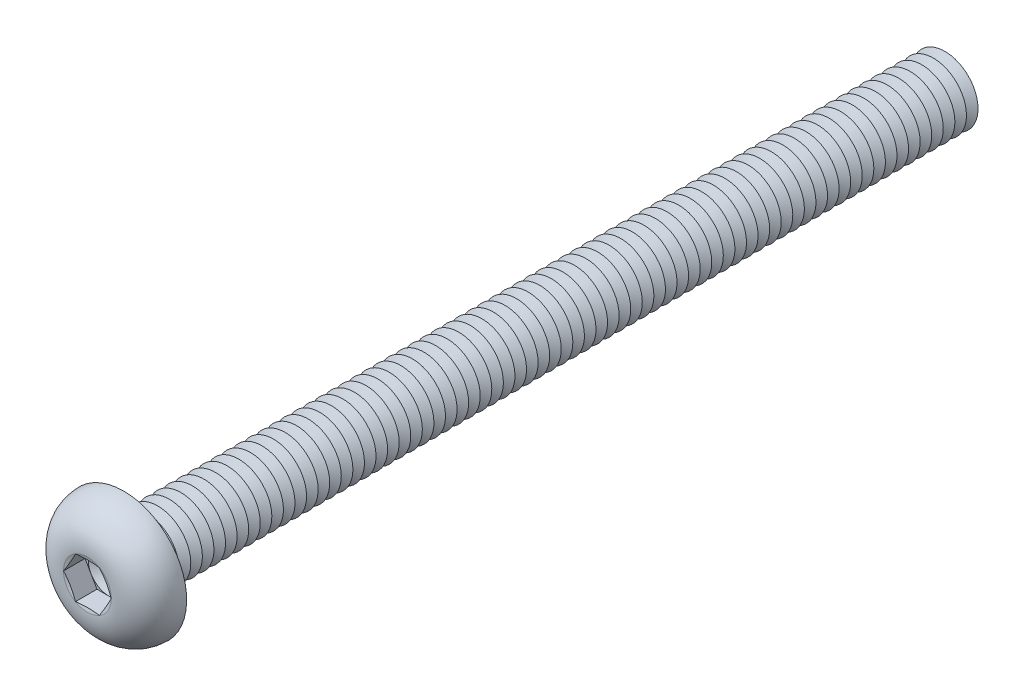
ISO-10303-21;
HEADER;
FILE_DESCRIPTION(('STEP AP214'),'2;1');
FILE_NAME('part.step','',(''),(''),'','','');
FILE_SCHEMA(('AUTOMOTIVE_DESIGN { 1 0 10303 214 1 1 1 1 }'));
ENDSEC;
DATA;
#1=APPLICATION_CONTEXT('core data for automotive mechanical design processes');
#2=APPLICATION_PROTOCOL_DEFINITION('international standard','automotive_design',2000,#1);
#3=PRODUCT_CONTEXT('',#1,'mechanical');
#4=PRODUCT('Part','Part','',(#3));
#5=PRODUCT_RELATED_PRODUCT_CATEGORY('part','',(#4));
#6=PRODUCT_DEFINITION_FORMATION('','',#4);
#7=PRODUCT_DEFINITION_CONTEXT('part definition',#1,'design');
#8=PRODUCT_DEFINITION('design','',#6,#7);
#9=PRODUCT_DEFINITION_SHAPE('','',#8);
#10=(LENGTH_UNIT() NAMED_UNIT(*) SI_UNIT(.MILLI.,.METRE.));
#11=(NAMED_UNIT(*) PLANE_ANGLE_UNIT() SI_UNIT($,.RADIAN.));
#12=(NAMED_UNIT(*) SI_UNIT($,.STERADIAN.) SOLID_ANGLE_UNIT());
#13=UNCERTAINTY_MEASURE_WITH_UNIT(LENGTH_MEASURE(1.E-05),#10,'distance_accuracy_value','');
#14=(GEOMETRIC_REPRESENTATION_CONTEXT(3) GLOBAL_UNCERTAINTY_ASSIGNED_CONTEXT((#13)) GLOBAL_UNIT_ASSIGNED_CONTEXT((#10,
#11,#12)) REPRESENTATION_CONTEXT('',''));
#15=CARTESIAN_POINT('',(0.,0.,0.));
#16=DIRECTION('',(0.,0.,1.));
#17=DIRECTION('',(1.,0.,0.));
#18=AXIS2_PLACEMENT_3D('',#15,#16,#17);
#19=CARTESIAN_POINT('',(0.,0.,0.899999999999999));
#20=DIRECTION('',(0.,0.,1.));
#21=DIRECTION('',(1.,0.,0.));
#22=AXIS2_PLACEMENT_3D('',#19,#20,#21);
#23=PLANE('',#22);
#24=CARTESIAN_POINT('',(0.,0.,0.899999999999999));
#25=DIRECTION('',(0.,0.,1.));
#26=DIRECTION('',(1.,0.,0.));
#27=AXIS2_PLACEMENT_3D('',#24,#25,#26);
#28=CIRCLE('',#27,1.24999941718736);
#29=CARTESIAN_POINT('',(1.08253125,0.624999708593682,0.899999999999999));
#30=VERTEX_POINT('',#29);
#31=CARTESIAN_POINT('',(0.,1.24999941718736,0.899999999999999));
#32=VERTEX_POINT('',#31);
#33=EDGE_CURVE('E118',#30,#32,#28,.T.);
#34=ORIENTED_EDGE('',*,*,#33,.F.);
#35=DIRECTION('',(-0.5,0.866025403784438,0.));
#36=VECTOR('',#35,1.);
#37=CARTESIAN_POINT('',(1.443375,0.,0.899999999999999));
#38=LINE('',#37,#36);
#39=CARTESIAN_POINT('',(0.7216875,1.24999941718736,0.899999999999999));
#40=VERTEX_POINT('',#39);
#41=EDGE_CURVE('E125',#30,#40,#38,.T.);
#42=ORIENTED_EDGE('',*,*,#41,.T.);
#43=DIRECTION('',(-1.,0.,0.));
#44=VECTOR('',#43,1.);
#45=CARTESIAN_POINT('',(0.7216875,1.24999941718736,0.899999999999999));
#46=LINE('',#45,#44);
#47=EDGE_CURVE('E136',#40,#32,#46,.T.);
#48=ORIENTED_EDGE('',*,*,#47,.T.);
#49=EDGE_LOOP('',(#34,#42,#48));
#50=FACE_BOUND('',#49,.T.);
#51=ADVANCED_FACE('F39',(#50),#23,.T.);
#52=CARTESIAN_POINT('',(0.,0.,0.899999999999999));
#53=DIRECTION('',(0.,0.,1.));
#54=DIRECTION('',(1.,0.,0.));
#55=AXIS2_PLACEMENT_3D('',#52,#53,#54);
#56=CIRCLE('',#55,1.24999941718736);
#57=CARTESIAN_POINT('',(-1.08253125,0.624999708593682,0.899999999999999));
#58=VERTEX_POINT('',#57);
#59=EDGE_CURVE('E11',#32,#58,#56,.T.);
#60=ORIENTED_EDGE('',*,*,#59,.F.);
#61=CARTESIAN_POINT('',(-0.721687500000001,1.24999941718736,0.899999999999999));
#62=VERTEX_POINT('',#61);
#63=EDGE_CURVE('E131',#32,#62,#46,.T.);
#64=ORIENTED_EDGE('',*,*,#63,.T.);
#65=DIRECTION('',(-0.5,-0.866025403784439,0.));
#66=VECTOR('',#65,1.);
#67=CARTESIAN_POINT('',(-0.721687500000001,1.24999941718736,0.899999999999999));
#68=LINE('',#67,#66);
#69=EDGE_CURVE('E134',#62,#58,#68,.T.);
#70=ORIENTED_EDGE('',*,*,#69,.T.);
#71=EDGE_LOOP('',(#60,#64,#70));
#72=FACE_BOUND('',#71,.T.);
#73=ADVANCED_FACE('F130',(#72),#23,.T.);
#74=CARTESIAN_POINT('',(-1.08253125,-0.624999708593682,0.899999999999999));
#75=VERTEX_POINT('',#74);
#76=EDGE_CURVE('E49',#58,#75,#56,.T.);
#77=ORIENTED_EDGE('',*,*,#76,.F.);
#78=CARTESIAN_POINT('',(-1.443375,0.,0.899999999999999));
#79=VERTEX_POINT('',#78);
#80=EDGE_CURVE('E143',#58,#79,#68,.T.);
#81=ORIENTED_EDGE('',*,*,#80,.T.);
#82=DIRECTION('',(0.5,-0.866025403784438,0.));
#83=VECTOR('',#82,1.);
#84=CARTESIAN_POINT('',(-1.443375,0.,0.899999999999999));
#85=LINE('',#84,#83);
#86=EDGE_CURVE('E152',#79,#75,#85,.T.);
#87=ORIENTED_EDGE('',*,*,#86,.T.);
#88=EDGE_LOOP('',(#77,#81,#87));
#89=FACE_BOUND('',#88,.T.);
#90=ADVANCED_FACE('F838',(#89),#23,.T.);
#91=CARTESIAN_POINT('',(0.,-1.24999941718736,0.899999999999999));
#92=VERTEX_POINT('',#91);
#93=EDGE_CURVE('E823',#75,#92,#56,.T.);
#94=ORIENTED_EDGE('',*,*,#93,.F.);
#95=CARTESIAN_POINT('',(-0.721687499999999,-1.24999941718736,0.899999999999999));
#96=VERTEX_POINT('',#95);
#97=EDGE_CURVE('E151',#75,#96,#85,.T.);
#98=ORIENTED_EDGE('',*,*,#97,.T.);
#99=DIRECTION('',(1.,0.,0.));
#100=VECTOR('',#99,1.);
#101=CARTESIAN_POINT('',(-0.721687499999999,-1.24999941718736,0.899999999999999));
#102=LINE('',#101,#100);
#103=EDGE_CURVE('E157',#96,#92,#102,.T.);
#104=ORIENTED_EDGE('',*,*,#103,.T.);
#105=EDGE_LOOP('',(#94,#98,#104));
#106=FACE_BOUND('',#105,.T.);
#107=ADVANCED_FACE('F831',(#106),#23,.T.);
#108=CARTESIAN_POINT('',(1.08253125,-0.624999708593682,0.899999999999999));
#109=VERTEX_POINT('',#108);
#110=EDGE_CURVE('E56',#92,#109,#56,.T.);
#111=ORIENTED_EDGE('',*,*,#110,.F.);
#112=CARTESIAN_POINT('',(0.721687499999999,-1.24999941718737,0.899999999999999));
#113=VERTEX_POINT('',#112);
#114=EDGE_CURVE('E156',#92,#113,#102,.T.);
#115=ORIENTED_EDGE('',*,*,#114,.T.);
#116=DIRECTION('',(0.5,0.866025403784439,0.));
#117=VECTOR('',#116,1.);
#118=CARTESIAN_POINT('',(0.721687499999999,-1.24999941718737,0.899999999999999));
#119=LINE('',#118,#117);
#120=EDGE_CURVE('E162',#113,#109,#119,.T.);
#121=ORIENTED_EDGE('',*,*,#120,.T.);
#122=EDGE_LOOP('',(#111,#115,#121));
#123=FACE_BOUND('',#122,.T.);
#124=ADVANCED_FACE('F909',(#123),#23,.T.);
#125=CARTESIAN_POINT('',(0.,0.,2.2));
#126=DIRECTION('',(0.,0.,1.));
#127=DIRECTION('',(0.,-1.,0.));
#128=AXIS2_PLACEMENT_3D('',#125,#126,#127);
#129=CONICAL_SURFACE('',#128,1.443375,1.30899693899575);
#130=CARTESIAN_POINT('',(1.44349047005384,-0.000200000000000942,2.20003094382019));
#131=CARTESIAN_POINT('',(1.41351104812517,0.0517258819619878,2.19199301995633));
#132=CARTESIAN_POINT('',(1.38347725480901,0.103745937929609,2.18469579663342));
#133=CARTESIAN_POINT('',(1.32330355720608,0.20796983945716,2.17187512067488));
#134=CARTESIAN_POINT('',(1.29316361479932,0.260173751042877,2.16635238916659));
#135=CARTESIAN_POINT('',(1.23296043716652,0.364448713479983,2.15740323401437));
#136=CARTESIAN_POINT('',(1.20289760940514,0.416519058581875,2.15396613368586));
#137=CARTESIAN_POINT('',(1.14273359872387,0.520726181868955,2.14935732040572));
#138=CARTESIAN_POINT('',(1.11263242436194,0.572862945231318,2.14818516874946));
#139=CARTESIAN_POINT('',(1.05243007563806,0.677136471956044,2.14818516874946));
#140=CARTESIAN_POINT('',(1.02232890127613,0.729273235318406,2.14935732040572));
#141=CARTESIAN_POINT('',(0.962164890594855,0.833480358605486,2.15396613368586));
#142=CARTESIAN_POINT('',(0.932102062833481,0.885550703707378,2.15740323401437));
#143=CARTESIAN_POINT('',(0.87189888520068,0.989825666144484,2.16635238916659));
#144=CARTESIAN_POINT('',(0.841758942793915,1.0420295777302,2.17187512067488));
#145=CARTESIAN_POINT('',(0.78158524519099,1.14625347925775,2.18469579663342));
#146=CARTESIAN_POINT('',(0.751551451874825,1.19827353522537,2.19199301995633));
#147=CARTESIAN_POINT('',(0.721572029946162,1.25019941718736,2.20003094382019));
#148=B_SPLINE_CURVE_WITH_KNOTS('',3,(#130,#131,#132,#133,#134,#135,#136,#137,#138,#139,#140,
#141,#142,#143,#144,#145,#146,#147),.UNSPECIFIED.,.F.,.F.,(4,2,2,2,2,2,2,2,4),(0.,
0.181495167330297,0.363063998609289,0.543695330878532,0.724291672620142,0.904888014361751,
1.08551934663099,1.26708817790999,1.44858334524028),.UNSPECIFIED.);
#149=CARTESIAN_POINT('',(1.443375,0.,2.2));
#150=VERTEX_POINT('',#149);
#151=CARTESIAN_POINT('',(0.72168750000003,1.24999941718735,2.2));
#152=VERTEX_POINT('',#151);
#153=EDGE_CURVE('E221',#150,#152,#148,.T.);
#154=ORIENTED_EDGE('',*,*,#153,.F.);
#155=CARTESIAN_POINT('',(0.,0.,2.2));
#156=DIRECTION('',(0.,0.,-1.));
#157=DIRECTION('',(0.,1.,0.));
#158=AXIS2_PLACEMENT_3D('',#155,#156,#157);
#159=CIRCLE('',#158,1.443375);
#160=EDGE_CURVE('E805',#152,#150,#159,.T.);
#161=ORIENTED_EDGE('',*,*,#160,.F.);
#162=EDGE_LOOP('',(#154,#161));
#163=FACE_BOUND('',#162,.T.);
#164=ADVANCED_FACE('F913',(#163),#129,.F.);
#165=CARTESIAN_POINT('',(0.721572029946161,-1.25019941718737,2.20003094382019));
#166=CARTESIAN_POINT('',(0.751551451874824,-1.19827353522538,2.19199301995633));
#167=CARTESIAN_POINT('',(0.78158524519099,-1.14625347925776,2.18469579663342));
#168=CARTESIAN_POINT('',(0.841758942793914,-1.0420295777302,2.17187512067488));
#169=CARTESIAN_POINT('',(0.871898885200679,-0.989825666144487,2.16635238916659));
#170=CARTESIAN_POINT('',(0.932102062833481,-0.885550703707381,2.15740323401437));
#171=CARTESIAN_POINT('',(0.962164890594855,-0.833480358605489,2.15396613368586));
#172=CARTESIAN_POINT('',(1.02232890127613,-0.729273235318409,2.14935732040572));
#173=CARTESIAN_POINT('',(1.05243007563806,-0.677136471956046,2.14818516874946));
#174=CARTESIAN_POINT('',(1.11263242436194,-0.57286294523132,2.14818516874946));
#175=CARTESIAN_POINT('',(1.14273359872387,-0.520726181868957,2.14935732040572));
#176=CARTESIAN_POINT('',(1.20289760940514,-0.416519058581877,2.15396613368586));
#177=CARTESIAN_POINT('',(1.23296043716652,-0.364448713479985,2.15740323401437));
#178=CARTESIAN_POINT('',(1.29316361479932,-0.260173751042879,2.16635238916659));
#179=CARTESIAN_POINT('',(1.32330355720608,-0.207969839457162,2.17187512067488));
#180=CARTESIAN_POINT('',(1.38347725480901,-0.103745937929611,2.18469579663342));
#181=CARTESIAN_POINT('',(1.41351104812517,-0.0517258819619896,2.19199301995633));
#182=CARTESIAN_POINT('',(1.44349047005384,0.00019999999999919,2.20003094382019));
#183=B_SPLINE_CURVE_WITH_KNOTS('',3,(#165,#166,#167,#168,#169,#170,#171,#172,#173,#174,#175,
#176,#177,#178,#179,#180,#181,#182),.UNSPECIFIED.,.F.,.F.,(4,2,2,2,2,2,2,2,4),(0.,
0.181495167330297,0.363063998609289,0.543695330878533,0.724291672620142,0.904888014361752,
1.085519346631,1.26708817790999,1.44858334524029),.UNSPECIFIED.);
#184=CARTESIAN_POINT('',(0.721687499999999,-1.24999941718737,2.2));
#185=VERTEX_POINT('',#184);
#186=EDGE_CURVE('E230',#185,#150,#183,.T.);
#187=ORIENTED_EDGE('',*,*,#186,.F.);
#188=EDGE_CURVE('E810',#150,#185,#159,.T.);
#189=ORIENTED_EDGE('',*,*,#188,.F.);
#190=EDGE_LOOP('',(#187,#189));
#191=FACE_BOUND('',#190,.T.);
#192=ADVANCED_FACE('F874',(#191),#129,.F.);
#193=CARTESIAN_POINT('',(-2.17815859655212,-1.24999941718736,2.48616275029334));
#194=CARTESIAN_POINT('',(-2.07269794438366,-1.24999941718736,2.46168811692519));
#195=CARTESIAN_POINT('',(-1.96714913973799,-1.24999941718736,2.43756889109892));
#196=CARTESIAN_POINT('',(-1.75576352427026,-1.24999941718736,2.39052699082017));
#197=CARTESIAN_POINT('',(-1.64992665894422,-1.24999941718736,2.36760456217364));
#198=CARTESIAN_POINT('',(-1.43690237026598,-1.24999941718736,2.3232454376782));
#199=CARTESIAN_POINT('',(-1.32971158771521,-1.24999941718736,2.30182468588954));
#200=CARTESIAN_POINT('',(-1.1148274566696,-1.24999941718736,2.26156703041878));
#201=CARTESIAN_POINT('',(-1.00713406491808,-1.24999941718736,2.24273035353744));
#202=CARTESIAN_POINT('',(-0.794044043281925,-1.24999941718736,2.2093913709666));
#203=CARTESIAN_POINT('',(-0.688664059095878,-1.24999941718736,2.19478562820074));
#204=CARTESIAN_POINT('',(-0.477310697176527,-1.24999941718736,2.17085809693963));
#205=CARTESIAN_POINT('',(-0.371337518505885,-1.24999941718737,2.16153463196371));
#206=CARTESIAN_POINT('',(-0.159455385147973,-1.24999941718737,2.14976770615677));
#207=CARTESIAN_POINT('',(-0.0535482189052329,-1.24999941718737,2.14729400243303));
#208=CARTESIAN_POINT('',(0.158189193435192,-1.24999941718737,2.14966287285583));
#209=CARTESIAN_POINT('',(0.264019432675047,-1.24999941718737,2.15450603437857));
#210=CARTESIAN_POINT('',(0.445148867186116,-1.24999941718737,2.16825380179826));
#211=CARTESIAN_POINT('',(0.520574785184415,-1.24999941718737,2.17561242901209));
#212=CARTESIAN_POINT('',(0.671115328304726,-1.24999941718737,2.19297000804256));
#213=CARTESIAN_POINT('',(0.746229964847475,-1.24999941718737,2.20296886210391));
#214=CARTESIAN_POINT('',(0.896387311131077,-1.24999941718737,2.22505910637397));
#215=CARTESIAN_POINT('',(0.971429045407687,-1.24999941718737,2.23715700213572));
#216=CARTESIAN_POINT('',(1.12124320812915,-1.24999941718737,2.26292371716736));
#217=CARTESIAN_POINT('',(1.19601562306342,-1.24999941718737,2.27659261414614));
#218=CARTESIAN_POINT('',(1.34686913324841,-1.24999941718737,2.30540811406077));
#219=CARTESIAN_POINT('',(1.42294548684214,-1.24999941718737,2.32057934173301));
#220=CARTESIAN_POINT('',(1.57490676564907,-1.24999941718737,2.351851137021));
#221=CARTESIAN_POINT('',(1.65079168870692,-1.24999941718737,2.36795171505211));
#222=CARTESIAN_POINT('',(1.80199501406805,-1.24999941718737,2.40076814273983));
#223=CARTESIAN_POINT('',(1.87731425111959,-1.24999941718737,2.41748016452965));
#224=CARTESIAN_POINT('',(2.02782424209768,-1.24999941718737,2.45144971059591));
#225=CARTESIAN_POINT('',(2.10301500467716,-1.24999941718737,2.46870719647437));
#226=CARTESIAN_POINT('',(2.17815859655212,-1.24999941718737,2.48616275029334));
#227=B_SPLINE_CURVE_WITH_KNOTS('',3,(#193,#194,#195,#196,#197,#198,#199,#200,#201,#202,#203,
#204,#205,#206,#207,#208,#209,#210,#211,#212,#213,#214,#215,#216,#217,#218,#219,#220,#221,#222,
#223,#224,#225,#226),.UNSPECIFIED.,.F.,.F.,(4,2,2,2,2,2,2,2,2,2,2,2,2,2,2,2,4),(0.,
0.324797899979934,0.649662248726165,0.977572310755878,1.30551113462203,1.62458166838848,
1.94355087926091,2.26110952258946,2.57869365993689,2.80599541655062,3.03328875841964,
3.26129956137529,3.48932164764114,3.7220371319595,3.95475522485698,4.18620606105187,
4.41764064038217),.UNSPECIFIED.);
#228=CARTESIAN_POINT('',(-0.721687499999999,-1.24999941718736,2.2));
#229=VERTEX_POINT('',#228);
#230=EDGE_CURVE('E852',#229,#185,#227,.T.);
#231=ORIENTED_EDGE('',*,*,#230,.F.);
#232=EDGE_CURVE('E865',#185,#229,#159,.T.);
#233=ORIENTED_EDGE('',*,*,#232,.F.);
#234=EDGE_LOOP('',(#231,#233));
#235=FACE_BOUND('',#234,.T.);
#236=ADVANCED_FACE('F880',(#235),#129,.F.);
#237=CARTESIAN_POINT('',(-1.44349047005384,0.000199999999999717,2.20003094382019));
#238=CARTESIAN_POINT('',(-1.41351104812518,-0.051725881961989,2.19199301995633));
#239=CARTESIAN_POINT('',(-1.38347725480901,-0.103745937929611,2.18469579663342));
#240=CARTESIAN_POINT('',(-1.32330355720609,-0.207969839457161,2.17187512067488));
#241=CARTESIAN_POINT('',(-1.29316361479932,-0.260173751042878,2.16635238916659));
#242=CARTESIAN_POINT('',(-1.23296043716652,-0.364448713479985,2.15740323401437));
#243=CARTESIAN_POINT('',(-1.20289760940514,-0.416519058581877,2.15396613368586));
#244=CARTESIAN_POINT('',(-1.14273359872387,-0.520726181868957,2.14935732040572));
#245=CARTESIAN_POINT('',(-1.11263242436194,-0.57286294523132,2.14818516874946));
#246=CARTESIAN_POINT('',(-1.05243007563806,-0.677136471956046,2.14818516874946));
#247=CARTESIAN_POINT('',(-1.02232890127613,-0.729273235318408,2.14935732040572));
#248=CARTESIAN_POINT('',(-0.962164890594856,-0.833480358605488,2.15396613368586));
#249=CARTESIAN_POINT('',(-0.932102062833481,-0.885550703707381,2.15740323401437));
#250=CARTESIAN_POINT('',(-0.87189888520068,-0.989825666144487,2.16635238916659));
#251=CARTESIAN_POINT('',(-0.841758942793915,-1.0420295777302,2.17187512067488));
#252=CARTESIAN_POINT('',(-0.78158524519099,-1.14625347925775,2.18469579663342));
#253=CARTESIAN_POINT('',(-0.751551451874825,-1.19827353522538,2.19199301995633));
#254=CARTESIAN_POINT('',(-0.721572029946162,-1.25019941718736,2.20003094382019));
#255=B_SPLINE_CURVE_WITH_KNOTS('',3,(#237,#238,#239,#240,#241,#242,#243,#244,#245,#246,#247,
#248,#249,#250,#251,#252,#253,#254),.UNSPECIFIED.,.F.,.F.,(4,2,2,2,2,2,2,2,4),(0.,
0.181495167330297,0.36306399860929,0.543695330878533,0.724291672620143,0.904888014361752,
1.085519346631,1.26708817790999,1.44858334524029),.UNSPECIFIED.);
#256=CARTESIAN_POINT('',(-1.443375,0.,2.2));
#257=VERTEX_POINT('',#256);
#258=EDGE_CURVE('E843',#257,#229,#255,.T.);
#259=ORIENTED_EDGE('',*,*,#258,.F.);
#260=EDGE_CURVE('E849',#229,#257,#159,.T.);
#261=ORIENTED_EDGE('',*,*,#260,.F.);
#262=EDGE_LOOP('',(#259,#261));
#263=FACE_BOUND('',#262,.T.);
#264=ADVANCED_FACE('F847',(#263),#129,.F.);
#265=CARTESIAN_POINT('',(-0.721572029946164,1.25019941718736,2.20003094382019));
#266=CARTESIAN_POINT('',(-0.751551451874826,1.19827353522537,2.19199301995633));
#267=CARTESIAN_POINT('',(-0.781585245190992,1.14625347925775,2.18469579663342));
#268=CARTESIAN_POINT('',(-0.841758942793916,1.0420295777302,2.17187512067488));
#269=CARTESIAN_POINT('',(-0.871898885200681,0.989825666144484,2.16635238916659));
#270=CARTESIAN_POINT('',(-0.932102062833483,0.885550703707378,2.15740323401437));
#271=CARTESIAN_POINT('',(-0.962164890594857,0.833480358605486,2.15396613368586));
#272=CARTESIAN_POINT('',(-1.02232890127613,0.729273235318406,2.14935732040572));
#273=CARTESIAN_POINT('',(-1.05243007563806,0.677136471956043,2.14818516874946));
#274=CARTESIAN_POINT('',(-1.11263242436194,0.572862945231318,2.14818516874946));
#275=CARTESIAN_POINT('',(-1.14273359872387,0.520726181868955,2.14935732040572));
#276=CARTESIAN_POINT('',(-1.20289760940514,0.416519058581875,2.15396613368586));
#277=CARTESIAN_POINT('',(-1.23296043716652,0.364448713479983,2.15740323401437));
#278=CARTESIAN_POINT('',(-1.29316361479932,0.260173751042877,2.16635238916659));
#279=CARTESIAN_POINT('',(-1.32330355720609,0.20796983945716,2.17187512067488));
#280=CARTESIAN_POINT('',(-1.38347725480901,0.10374593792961,2.18469579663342));
#281=CARTESIAN_POINT('',(-1.41351104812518,0.0517258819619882,2.19199301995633));
#282=CARTESIAN_POINT('',(-1.44349047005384,-0.000200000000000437,2.20003094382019));
#283=B_SPLINE_CURVE_WITH_KNOTS('',3,(#265,#266,#267,#268,#269,#270,#271,#272,#273,#274,#275,
#276,#277,#278,#279,#280,#281,#282),.UNSPECIFIED.,.F.,.F.,(4,2,2,2,2,2,2,2,4),(0.,
0.181495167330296,0.363063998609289,0.543695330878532,0.724291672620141,0.90488801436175,
1.08551934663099,1.26708817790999,1.44858334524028),.UNSPECIFIED.);
#284=CARTESIAN_POINT('',(-0.721687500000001,1.24999941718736,2.2));
#285=VERTEX_POINT('',#284);
#286=EDGE_CURVE('E194',#285,#257,#283,.T.);
#287=ORIENTED_EDGE('',*,*,#286,.F.);
#288=EDGE_CURVE('E855',#257,#285,#159,.T.);
#289=ORIENTED_EDGE('',*,*,#288,.F.);
#290=EDGE_LOOP('',(#287,#289));
#291=FACE_BOUND('',#290,.T.);
#292=ADVANCED_FACE('F856',(#291),#129,.F.);
#293=CARTESIAN_POINT('',(0.,0.,-47.55));
#294=DIRECTION('',(0.,0.,1.));
#295=DIRECTION('',(0.,-1.,0.));
#296=AXIS2_PLACEMENT_3D('',#293,#294,#295);
#297=CONICAL_SURFACE('',#296,1.99999999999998,1.04719755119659);
#298=CARTESIAN_POINT('',(0.,0.,-47.9));
#299=DIRECTION('',(0.,0.,1.));
#300=DIRECTION('',(0.,-1.,0.));
#301=AXIS2_PLACEMENT_3D('',#298,#299,#300);
#302=CIRCLE('',#301,1.39378221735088);
#303=CARTESIAN_POINT('',(0.,-1.39378221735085,-47.9));
#304=VERTEX_POINT('',#303);
#305=EDGE_CURVE('E776',#304,#304,#302,.T.);
#306=ORIENTED_EDGE('',*,*,#305,.T.);
#307=EDGE_LOOP('',(#306));
#308=FACE_BOUND('',#307,.T.);
#309=CARTESIAN_POINT('',(0.,0.,-47.55));
#310=DIRECTION('',(0.,0.,1.));
#311=DIRECTION('',(0.,-1.,0.));
#312=AXIS2_PLACEMENT_3D('',#309,#310,#311);
#313=CIRCLE('',#312,1.99999999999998);
#314=CARTESIAN_POINT('',(0.,-1.99999999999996,-47.55));
#315=VERTEX_POINT('',#314);
#316=EDGE_CURVE('E772',#315,#315,#313,.T.);
#317=ORIENTED_EDGE('',*,*,#316,.F.);
#318=EDGE_LOOP('',(#317));
#319=FACE_BOUND('',#318,.T.);
#320=ADVANCED_FACE('F941',(#308,#319),#297,.T.);
#321=CARTESIAN_POINT('',(0.,0.,-47.9));
#322=DIRECTION('',(0.,0.,-1.));
#323=DIRECTION('',(0.,1.,0.));
#324=AXIS2_PLACEMENT_3D('',#321,#322,#323);
#325=CONICAL_SURFACE('',#324,1.39378221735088,1.0471975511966);
#326=CARTESIAN_POINT('',(0.,0.,-48.25));
#327=DIRECTION('',(0.,0.,1.));
#328=DIRECTION('',(0.,-1.,0.));
#329=AXIS2_PLACEMENT_3D('',#326,#327,#328);
#330=CIRCLE('',#329,1.99999999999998);
#331=CARTESIAN_POINT('',(0.,-1.99999999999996,-48.25));
#332=VERTEX_POINT('',#331);
#333=EDGE_CURVE('E780',#332,#332,#330,.T.);
#334=ORIENTED_EDGE('',*,*,#333,.T.);
#335=EDGE_LOOP('',(#334));
#336=FACE_BOUND('',#335,.T.);
#337=ORIENTED_EDGE('',*,*,#305,.F.);
#338=EDGE_LOOP('',(#337));
#339=FACE_BOUND('',#338,.T.);
#340=ADVANCED_FACE('F946',(#336,#339),#325,.T.);
#341=CARTESIAN_POINT('',(0.,1.99999999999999,-50.));
#342=DIRECTION('',(0.,0.,-1.));
#343=DIRECTION('',(0.,1.,0.));
#344=AXIS2_PLACEMENT_3D('',#341,#342,#343);
#345=PLANE('',#344);
#346=CARTESIAN_POINT('',(0.,0.,-50.));
#347=DIRECTION('',(0.,0.,1.));
#348=DIRECTION('',(0.,-1.,0.));
#349=AXIS2_PLACEMENT_3D('',#346,#347,#348);
#350=CIRCLE('',#349,1.39378221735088);
#351=CARTESIAN_POINT('',(0.,-1.39378221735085,-50.));
#352=VERTEX_POINT('',#351);
#353=EDGE_CURVE('E800',#352,#352,#350,.T.);
#354=ORIENTED_EDGE('',*,*,#353,.F.);
#355=EDGE_LOOP('',(#354));
#356=FACE_BOUND('',#355,.T.);
#357=ADVANCED_FACE('F1121',(#356),#345,.T.);
#358=CARTESIAN_POINT('',(0.,0.,-49.65));
#359=DIRECTION('',(0.,0.,1.));
#360=DIRECTION('',(0.,-1.,0.));
#361=AXIS2_PLACEMENT_3D('',#358,#359,#360);
#362=CONICAL_SURFACE('',#361,1.99999999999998,1.04719755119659);
#363=ORIENTED_EDGE('',*,*,#353,.T.);
#364=EDGE_LOOP('',(#363));
#365=FACE_BOUND('',#364,.T.);
#366=CARTESIAN_POINT('',(0.,0.,-49.65));
#367=DIRECTION('',(0.,0.,1.));
#368=DIRECTION('',(0.,-1.,0.));
#369=AXIS2_PLACEMENT_3D('',#366,#367,#368);
#370=CIRCLE('',#369,1.99999999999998);
#371=CARTESIAN_POINT('',(0.,-1.99999999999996,-49.65));
#372=VERTEX_POINT('',#371);
#373=EDGE_CURVE('E796',#372,#372,#370,.T.);
#374=ORIENTED_EDGE('',*,*,#373,.F.);
#375=EDGE_LOOP('',(#374));
#376=FACE_BOUND('',#375,.T.);
#377=ADVANCED_FACE('F1114',(#365,#376),#362,.T.);
#378=CARTESIAN_POINT('',(0.,0.,-49.3));
#379=DIRECTION('',(0.,0.,-1.));
#380=DIRECTION('',(0.,1.,0.));
#381=AXIS2_PLACEMENT_3D('',#378,#379,#380);
#382=CONICAL_SURFACE('',#381,1.39378221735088,1.0471975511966);
#383=ORIENTED_EDGE('',*,*,#373,.T.);
#384=EDGE_LOOP('',(#383));
#385=FACE_BOUND('',#384,.T.);
#386=CARTESIAN_POINT('',(0.,0.,-49.3));
#387=DIRECTION('',(0.,0.,1.));
#388=DIRECTION('',(0.,-1.,0.));
#389=AXIS2_PLACEMENT_3D('',#386,#387,#388);
#390=CIRCLE('',#389,1.39378221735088);
#391=CARTESIAN_POINT('',(0.,-1.39378221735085,-49.3));
#392=VERTEX_POINT('',#391);
#393=EDGE_CURVE('E792',#392,#392,#390,.T.);
#394=ORIENTED_EDGE('',*,*,#393,.F.);
#395=EDGE_LOOP('',(#394));
#396=FACE_BOUND('',#395,.T.);
#397=ADVANCED_FACE('F1120',(#385,#396),#382,.T.);
#398=CARTESIAN_POINT('',(0.,0.,-48.95));
#399=DIRECTION('',(0.,0.,1.));
#400=DIRECTION('',(0.,-1.,0.));
#401=AXIS2_PLACEMENT_3D('',#398,#399,#400);
#402=CONICAL_SURFACE('',#401,1.99999999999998,1.04719755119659);
#403=ORIENTED_EDGE('',*,*,#393,.T.);
#404=EDGE_LOOP('',(#403));
#405=FACE_BOUND('',#404,.T.);
#406=CARTESIAN_POINT('',(0.,0.,-48.95));
#407=DIRECTION('',(0.,0.,1.));
#408=DIRECTION('',(0.,-1.,0.));
#409=AXIS2_PLACEMENT_3D('',#406,#407,#408);
#410=CIRCLE('',#409,1.99999999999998);
#411=CARTESIAN_POINT('',(0.,-1.99999999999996,-48.95));
#412=VERTEX_POINT('',#411);
#413=EDGE_CURVE('E788',#412,#412,#410,.T.);
#414=ORIENTED_EDGE('',*,*,#413,.F.);
#415=EDGE_LOOP('',(#414));
#416=FACE_BOUND('',#415,.T.);
#417=ADVANCED_FACE('F1152',(#405,#416),#402,.T.);
#418=CARTESIAN_POINT('',(0.,0.,-48.6));
#419=DIRECTION('',(0.,0.,-1.));
#420=DIRECTION('',(0.,1.,0.));
#421=AXIS2_PLACEMENT_3D('',#418,#419,#420);
#422=CONICAL_SURFACE('',#421,1.39378221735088,1.0471975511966);
#423=ORIENTED_EDGE('',*,*,#413,.T.);
#424=EDGE_LOOP('',(#423));
#425=FACE_BOUND('',#424,.T.);
#426=CARTESIAN_POINT('',(0.,0.,-48.6));
#427=DIRECTION('',(0.,0.,1.));
#428=DIRECTION('',(0.,-1.,0.));
#429=AXIS2_PLACEMENT_3D('',#426,#427,#428);
#430=CIRCLE('',#429,1.39378221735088);
#431=CARTESIAN_POINT('',(0.,-1.39378221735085,-48.6));
#432=VERTEX_POINT('',#431);
#433=EDGE_CURVE('E784',#432,#432,#430,.T.);
#434=ORIENTED_EDGE('',*,*,#433,.F.);
#435=EDGE_LOOP('',(#434));
#436=FACE_BOUND('',#435,.T.);
#437=ADVANCED_FACE('F1162',(#425,#436),#422,.T.);
#438=CARTESIAN_POINT('',(0.,0.,-48.25));
#439=DIRECTION('',(0.,0.,1.));
#440=DIRECTION('',(0.,-1.,0.));
#441=AXIS2_PLACEMENT_3D('',#438,#439,#440);
#442=CONICAL_SURFACE('',#441,1.99999999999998,1.04719755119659);
#443=ORIENTED_EDGE('',*,*,#433,.T.);
#444=EDGE_LOOP('',(#443));
#445=FACE_BOUND('',#444,.T.);
#446=ORIENTED_EDGE('',*,*,#333,.F.);
#447=EDGE_LOOP('',(#446));
#448=FACE_BOUND('',#447,.T.);
#449=ADVANCED_FACE('F1172',(#445,#448),#442,.T.);
#450=CARTESIAN_POINT('',(0.,0.,-46.85));
#451=DIRECTION('',(0.,0.,1.));
#452=DIRECTION('',(0.,-1.,0.));
#453=AXIS2_PLACEMENT_3D('',#450,#451,#452);
#454=CONICAL_SURFACE('',#453,1.99999999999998,1.04719755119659);
#455=CARTESIAN_POINT('',(0.,0.,-47.2));
#456=DIRECTION('',(0.,0.,1.));
#457=DIRECTION('',(0.,-1.,0.));
#458=AXIS2_PLACEMENT_3D('',#455,#456,#457);
#459=CIRCLE('',#458,1.39378221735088);
#460=CARTESIAN_POINT('',(0.,-1.39378221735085,-47.2));
#461=VERTEX_POINT('',#460);
#462=EDGE_CURVE('E768',#461,#461,#459,.T.);
#463=ORIENTED_EDGE('',*,*,#462,.T.);
#464=EDGE_LOOP('',(#463));
#465=FACE_BOUND('',#464,.T.);
#466=CARTESIAN_POINT('',(0.,0.,-46.85));
#467=DIRECTION('',(0.,0.,1.));
#468=DIRECTION('',(0.,-1.,0.));
#469=AXIS2_PLACEMENT_3D('',#466,#467,#468);
#470=CIRCLE('',#469,1.99999999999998);
#471=CARTESIAN_POINT('',(0.,-1.99999999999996,-46.85));
#472=VERTEX_POINT('',#471);
#473=EDGE_CURVE('E764',#472,#472,#470,.T.);
#474=ORIENTED_EDGE('',*,*,#473,.F.);
#475=EDGE_LOOP('',(#474));
#476=FACE_BOUND('',#475,.T.);
#477=ADVANCED_FACE('F1182',(#465,#476),#454,.T.);
#478=CARTESIAN_POINT('',(0.,0.,-47.2));
#479=DIRECTION('',(0.,0.,-1.));
#480=DIRECTION('',(0.,1.,0.));
#481=AXIS2_PLACEMENT_3D('',#478,#479,#480);
#482=CONICAL_SURFACE('',#481,1.39378221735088,1.0471975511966);
#483=ORIENTED_EDGE('',*,*,#316,.T.);
#484=EDGE_LOOP('',(#483));
#485=FACE_BOUND('',#484,.T.);
#486=ORIENTED_EDGE('',*,*,#462,.F.);
#487=EDGE_LOOP('',(#486));
#488=FACE_BOUND('',#487,.T.);
#489=ADVANCED_FACE('F1192',(#485,#488),#482,.T.);
#490=CARTESIAN_POINT('',(0.,0.,-46.15));
#491=DIRECTION('',(0.,0.,1.));
#492=DIRECTION('',(0.,-1.,0.));
#493=AXIS2_PLACEMENT_3D('',#490,#491,#492);
#494=CONICAL_SURFACE('',#493,1.99999999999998,1.04719755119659);
#495=CARTESIAN_POINT('',(0.,0.,-46.5));
#496=DIRECTION('',(0.,0.,1.));
#497=DIRECTION('',(0.,-1.,0.));
#498=AXIS2_PLACEMENT_3D('',#495,#496,#497);
#499=CIRCLE('',#498,1.39378221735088);
#500=CARTESIAN_POINT('',(0.,-1.39378221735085,-46.5));
#501=VERTEX_POINT('',#500);
#502=EDGE_CURVE('E760',#501,#501,#499,.T.);
#503=ORIENTED_EDGE('',*,*,#502,.T.);
#504=EDGE_LOOP('',(#503));
#505=FACE_BOUND('',#504,.T.);
#506=CARTESIAN_POINT('',(0.,0.,-46.15));
#507=DIRECTION('',(0.,0.,1.));
#508=DIRECTION('',(0.,-1.,0.));
#509=AXIS2_PLACEMENT_3D('',#506,#507,#508);
#510=CIRCLE('',#509,1.99999999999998);
#511=CARTESIAN_POINT('',(0.,-1.99999999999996,-46.15));
#512=VERTEX_POINT('',#511);
#513=EDGE_CURVE('E756',#512,#512,#510,.T.);
#514=ORIENTED_EDGE('',*,*,#513,.F.);
#515=EDGE_LOOP('',(#514));
#516=FACE_BOUND('',#515,.T.);
#517=ADVANCED_FACE('F1202',(#505,#516),#494,.T.);
#518=CARTESIAN_POINT('',(0.,0.,-46.5));
#519=DIRECTION('',(0.,0.,-1.));
#520=DIRECTION('',(0.,1.,0.));
#521=AXIS2_PLACEMENT_3D('',#518,#519,#520);
#522=CONICAL_SURFACE('',#521,1.39378221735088,1.0471975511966);
#523=ORIENTED_EDGE('',*,*,#473,.T.);
#524=EDGE_LOOP('',(#523));
#525=FACE_BOUND('',#524,.T.);
#526=ORIENTED_EDGE('',*,*,#502,.F.);
#527=EDGE_LOOP('',(#526));
#528=FACE_BOUND('',#527,.T.);
#529=ADVANCED_FACE('F1212',(#525,#528),#522,.T.);
#530=CARTESIAN_POINT('',(0.,0.,-45.45));
#531=DIRECTION('',(0.,0.,1.));
#532=DIRECTION('',(0.,-1.,0.));
#533=AXIS2_PLACEMENT_3D('',#530,#531,#532);
#534=CONICAL_SURFACE('',#533,1.99999999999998,1.04719755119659);
#535=CARTESIAN_POINT('',(0.,0.,-45.8));
#536=DIRECTION('',(0.,0.,1.));
#537=DIRECTION('',(0.,-1.,0.));
#538=AXIS2_PLACEMENT_3D('',#535,#536,#537);
#539=CIRCLE('',#538,1.39378221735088);
#540=CARTESIAN_POINT('',(0.,-1.39378221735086,-45.8));
#541=VERTEX_POINT('',#540);
#542=EDGE_CURVE('E752',#541,#541,#539,.T.);
#543=ORIENTED_EDGE('',*,*,#542,.T.);
#544=EDGE_LOOP('',(#543));
#545=FACE_BOUND('',#544,.T.);
#546=CARTESIAN_POINT('',(0.,0.,-45.45));
#547=DIRECTION('',(0.,0.,1.));
#548=DIRECTION('',(0.,-1.,0.));
#549=AXIS2_PLACEMENT_3D('',#546,#547,#548);
#550=CIRCLE('',#549,1.99999999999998);
#551=CARTESIAN_POINT('',(0.,-1.99999999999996,-45.45));
#552=VERTEX_POINT('',#551);
#553=EDGE_CURVE('E748',#552,#552,#550,.T.);
#554=ORIENTED_EDGE('',*,*,#553,.F.);
#555=EDGE_LOOP('',(#554));
#556=FACE_BOUND('',#555,.T.);
#557=ADVANCED_FACE('F1222',(#545,#556),#534,.T.);
#558=CARTESIAN_POINT('',(0.,0.,-45.8));
#559=DIRECTION('',(0.,0.,-1.));
#560=DIRECTION('',(0.,1.,0.));
#561=AXIS2_PLACEMENT_3D('',#558,#559,#560);
#562=CONICAL_SURFACE('',#561,1.39378221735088,1.0471975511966);
#563=ORIENTED_EDGE('',*,*,#513,.T.);
#564=EDGE_LOOP('',(#563));
#565=FACE_BOUND('',#564,.T.);
#566=ORIENTED_EDGE('',*,*,#542,.F.);
#567=EDGE_LOOP('',(#566));
#568=FACE_BOUND('',#567,.T.);
#569=ADVANCED_FACE('F1232',(#565,#568),#562,.T.);
#570=CARTESIAN_POINT('',(0.,0.,-44.75));
#571=DIRECTION('',(0.,0.,1.));
#572=DIRECTION('',(0.,-1.,0.));
#573=AXIS2_PLACEMENT_3D('',#570,#571,#572);
#574=CONICAL_SURFACE('',#573,1.99999999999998,1.04719755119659);
#575=CARTESIAN_POINT('',(0.,0.,-45.1));
#576=DIRECTION('',(0.,0.,1.));
#577=DIRECTION('',(0.,-1.,0.));
#578=AXIS2_PLACEMENT_3D('',#575,#576,#577);
#579=CIRCLE('',#578,1.39378221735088);
#580=CARTESIAN_POINT('',(0.,-1.39378221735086,-45.1));
#581=VERTEX_POINT('',#580);
#582=EDGE_CURVE('E744',#581,#581,#579,.T.);
#583=ORIENTED_EDGE('',*,*,#582,.T.);
#584=EDGE_LOOP('',(#583));
#585=FACE_BOUND('',#584,.T.);
#586=CARTESIAN_POINT('',(0.,0.,-44.75));
#587=DIRECTION('',(0.,0.,1.));
#588=DIRECTION('',(0.,-1.,0.));
#589=AXIS2_PLACEMENT_3D('',#586,#587,#588);
#590=CIRCLE('',#589,1.99999999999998);
#591=CARTESIAN_POINT('',(0.,-1.99999999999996,-44.75));
#592=VERTEX_POINT('',#591);
#593=EDGE_CURVE('E740',#592,#592,#590,.T.);
#594=ORIENTED_EDGE('',*,*,#593,.F.);
#595=EDGE_LOOP('',(#594));
#596=FACE_BOUND('',#595,.T.);
#597=ADVANCED_FACE('F1242',(#585,#596),#574,.T.);
#598=CARTESIAN_POINT('',(0.,0.,-45.1));
#599=DIRECTION('',(0.,0.,-1.));
#600=DIRECTION('',(0.,1.,0.));
#601=AXIS2_PLACEMENT_3D('',#598,#599,#600);
#602=CONICAL_SURFACE('',#601,1.39378221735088,1.0471975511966);
#603=ORIENTED_EDGE('',*,*,#553,.T.);
#604=EDGE_LOOP('',(#603));
#605=FACE_BOUND('',#604,.T.);
#606=ORIENTED_EDGE('',*,*,#582,.F.);
#607=EDGE_LOOP('',(#606));
#608=FACE_BOUND('',#607,.T.);
#609=ADVANCED_FACE('F1252',(#605,#608),#602,.T.);
#610=CARTESIAN_POINT('',(0.,0.,-44.05));
#611=DIRECTION('',(0.,0.,1.));
#612=DIRECTION('',(0.,-1.,0.));
#613=AXIS2_PLACEMENT_3D('',#610,#611,#612);
#614=CONICAL_SURFACE('',#613,1.99999999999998,1.04719755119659);
#615=CARTESIAN_POINT('',(0.,0.,-44.4));
#616=DIRECTION('',(0.,0.,1.));
#617=DIRECTION('',(0.,-1.,0.));
#618=AXIS2_PLACEMENT_3D('',#615,#616,#617);
#619=CIRCLE('',#618,1.39378221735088);
#620=CARTESIAN_POINT('',(0.,-1.39378221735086,-44.4));
#621=VERTEX_POINT('',#620);
#622=EDGE_CURVE('E736',#621,#621,#619,.T.);
#623=ORIENTED_EDGE('',*,*,#622,.T.);
#624=EDGE_LOOP('',(#623));
#625=FACE_BOUND('',#624,.T.);
#626=CARTESIAN_POINT('',(0.,0.,-44.05));
#627=DIRECTION('',(0.,0.,1.));
#628=DIRECTION('',(0.,-1.,0.));
#629=AXIS2_PLACEMENT_3D('',#626,#627,#628);
#630=CIRCLE('',#629,1.99999999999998);
#631=CARTESIAN_POINT('',(0.,-1.99999999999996,-44.05));
#632=VERTEX_POINT('',#631);
#633=EDGE_CURVE('E732',#632,#632,#630,.T.);
#634=ORIENTED_EDGE('',*,*,#633,.F.);
#635=EDGE_LOOP('',(#634));
#636=FACE_BOUND('',#635,.T.);
#637=ADVANCED_FACE('F1262',(#625,#636),#614,.T.);
#638=CARTESIAN_POINT('',(0.,0.,-44.4));
#639=DIRECTION('',(0.,0.,-1.));
#640=DIRECTION('',(0.,1.,0.));
#641=AXIS2_PLACEMENT_3D('',#638,#639,#640);
#642=CONICAL_SURFACE('',#641,1.39378221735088,1.0471975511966);
#643=ORIENTED_EDGE('',*,*,#593,.T.);
#644=EDGE_LOOP('',(#643));
#645=FACE_BOUND('',#644,.T.);
#646=ORIENTED_EDGE('',*,*,#622,.F.);
#647=EDGE_LOOP('',(#646));
#648=FACE_BOUND('',#647,.T.);
#649=ADVANCED_FACE('F1272',(#645,#648),#642,.T.);
#650=CARTESIAN_POINT('',(0.,0.,-43.35));
#651=DIRECTION('',(0.,0.,1.));
#652=DIRECTION('',(0.,-1.,0.));
#653=AXIS2_PLACEMENT_3D('',#650,#651,#652);
#654=CONICAL_SURFACE('',#653,1.99999999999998,1.04719755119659);
#655=CARTESIAN_POINT('',(0.,0.,-43.7));
#656=DIRECTION('',(0.,0.,1.));
#657=DIRECTION('',(0.,-1.,0.));
#658=AXIS2_PLACEMENT_3D('',#655,#656,#657);
#659=CIRCLE('',#658,1.39378221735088);
#660=CARTESIAN_POINT('',(0.,-1.39378221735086,-43.7));
#661=VERTEX_POINT('',#660);
#662=EDGE_CURVE('E728',#661,#661,#659,.T.);
#663=ORIENTED_EDGE('',*,*,#662,.T.);
#664=EDGE_LOOP('',(#663));
#665=FACE_BOUND('',#664,.T.);
#666=CARTESIAN_POINT('',(0.,0.,-43.35));
#667=DIRECTION('',(0.,0.,1.));
#668=DIRECTION('',(0.,-1.,0.));
#669=AXIS2_PLACEMENT_3D('',#666,#667,#668);
#670=CIRCLE('',#669,1.99999999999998);
#671=CARTESIAN_POINT('',(0.,-1.99999999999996,-43.35));
#672=VERTEX_POINT('',#671);
#673=EDGE_CURVE('E724',#672,#672,#670,.T.);
#674=ORIENTED_EDGE('',*,*,#673,.F.);
#675=EDGE_LOOP('',(#674));
#676=FACE_BOUND('',#675,.T.);
#677=ADVANCED_FACE('F1282',(#665,#676),#654,.T.);
#678=CARTESIAN_POINT('',(0.,0.,-43.7));
#679=DIRECTION('',(0.,0.,-1.));
#680=DIRECTION('',(0.,1.,0.));
#681=AXIS2_PLACEMENT_3D('',#678,#679,#680);
#682=CONICAL_SURFACE('',#681,1.39378221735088,1.0471975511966);
#683=ORIENTED_EDGE('',*,*,#633,.T.);
#684=EDGE_LOOP('',(#683));
#685=FACE_BOUND('',#684,.T.);
#686=ORIENTED_EDGE('',*,*,#662,.F.);
#687=EDGE_LOOP('',(#686));
#688=FACE_BOUND('',#687,.T.);
#689=ADVANCED_FACE('F1292',(#685,#688),#682,.T.);
#690=CARTESIAN_POINT('',(0.,0.,-42.65));
#691=DIRECTION('',(0.,0.,1.));
#692=DIRECTION('',(0.,-1.,0.));
#693=AXIS2_PLACEMENT_3D('',#690,#691,#692);
#694=CONICAL_SURFACE('',#693,1.99999999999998,1.04719755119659);
#695=CARTESIAN_POINT('',(0.,0.,-43.));
#696=DIRECTION('',(0.,0.,1.));
#697=DIRECTION('',(0.,-1.,0.));
#698=AXIS2_PLACEMENT_3D('',#695,#696,#697);
#699=CIRCLE('',#698,1.39378221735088);
#700=CARTESIAN_POINT('',(0.,-1.39378221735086,-43.));
#701=VERTEX_POINT('',#700);
#702=EDGE_CURVE('E720',#701,#701,#699,.T.);
#703=ORIENTED_EDGE('',*,*,#702,.T.);
#704=EDGE_LOOP('',(#703));
#705=FACE_BOUND('',#704,.T.);
#706=CARTESIAN_POINT('',(0.,0.,-42.65));
#707=DIRECTION('',(0.,0.,1.));
#708=DIRECTION('',(0.,-1.,0.));
#709=AXIS2_PLACEMENT_3D('',#706,#707,#708);
#710=CIRCLE('',#709,1.99999999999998);
#711=CARTESIAN_POINT('',(0.,-1.99999999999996,-42.65));
#712=VERTEX_POINT('',#711);
#713=EDGE_CURVE('E716',#712,#712,#710,.T.);
#714=ORIENTED_EDGE('',*,*,#713,.F.);
#715=EDGE_LOOP('',(#714));
#716=FACE_BOUND('',#715,.T.);
#717=ADVANCED_FACE('F1302',(#705,#716),#694,.T.);
#718=CARTESIAN_POINT('',(0.,0.,-43.));
#719=DIRECTION('',(0.,0.,-1.));
#720=DIRECTION('',(0.,1.,0.));
#721=AXIS2_PLACEMENT_3D('',#718,#719,#720);
#722=CONICAL_SURFACE('',#721,1.39378221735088,1.0471975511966);
#723=ORIENTED_EDGE('',*,*,#673,.T.);
#724=EDGE_LOOP('',(#723));
#725=FACE_BOUND('',#724,.T.);
#726=ORIENTED_EDGE('',*,*,#702,.F.);
#727=EDGE_LOOP('',(#726));
#728=FACE_BOUND('',#727,.T.);
#729=ADVANCED_FACE('F1312',(#725,#728),#722,.T.);
#730=CARTESIAN_POINT('',(0.,0.,-41.95));
#731=DIRECTION('',(0.,0.,1.));
#732=DIRECTION('',(0.,-1.,0.));
#733=AXIS2_PLACEMENT_3D('',#730,#731,#732);
#734=CONICAL_SURFACE('',#733,1.99999999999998,1.04719755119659);
#735=CARTESIAN_POINT('',(0.,0.,-42.3));
#736=DIRECTION('',(0.,0.,1.));
#737=DIRECTION('',(0.,-1.,0.));
#738=AXIS2_PLACEMENT_3D('',#735,#736,#737);
#739=CIRCLE('',#738,1.39378221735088);
#740=CARTESIAN_POINT('',(0.,-1.39378221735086,-42.3));
#741=VERTEX_POINT('',#740);
#742=EDGE_CURVE('E712',#741,#741,#739,.T.);
#743=ORIENTED_EDGE('',*,*,#742,.T.);
#744=EDGE_LOOP('',(#743));
#745=FACE_BOUND('',#744,.T.);
#746=CARTESIAN_POINT('',(0.,0.,-41.95));
#747=DIRECTION('',(0.,0.,1.));
#748=DIRECTION('',(0.,-1.,0.));
#749=AXIS2_PLACEMENT_3D('',#746,#747,#748);
#750=CIRCLE('',#749,1.99999999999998);
#751=CARTESIAN_POINT('',(0.,-1.99999999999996,-41.95));
#752=VERTEX_POINT('',#751);
#753=EDGE_CURVE('E708',#752,#752,#750,.T.);
#754=ORIENTED_EDGE('',*,*,#753,.F.);
#755=EDGE_LOOP('',(#754));
#756=FACE_BOUND('',#755,.T.);
#757=ADVANCED_FACE('F1322',(#745,#756),#734,.T.);
#758=CARTESIAN_POINT('',(0.,0.,-42.3));
#759=DIRECTION('',(0.,0.,-1.));
#760=DIRECTION('',(0.,1.,0.));
#761=AXIS2_PLACEMENT_3D('',#758,#759,#760);
#762=CONICAL_SURFACE('',#761,1.39378221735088,1.0471975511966);
#763=ORIENTED_EDGE('',*,*,#713,.T.);
#764=EDGE_LOOP('',(#763));
#765=FACE_BOUND('',#764,.T.);
#766=ORIENTED_EDGE('',*,*,#742,.F.);
#767=EDGE_LOOP('',(#766));
#768=FACE_BOUND('',#767,.T.);
#769=ADVANCED_FACE('F1332',(#765,#768),#762,.T.);
#770=CARTESIAN_POINT('',(0.,0.,-41.25));
#771=DIRECTION('',(0.,0.,1.));
#772=DIRECTION('',(0.,-1.,0.));
#773=AXIS2_PLACEMENT_3D('',#770,#771,#772);
#774=CONICAL_SURFACE('',#773,1.99999999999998,1.04719755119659);
#775=CARTESIAN_POINT('',(0.,0.,-41.6));
#776=DIRECTION('',(0.,0.,1.));
#777=DIRECTION('',(0.,-1.,0.));
#778=AXIS2_PLACEMENT_3D('',#775,#776,#777);
#779=CIRCLE('',#778,1.39378221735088);
#780=CARTESIAN_POINT('',(0.,-1.39378221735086,-41.6));
#781=VERTEX_POINT('',#780);
#782=EDGE_CURVE('E704',#781,#781,#779,.T.);
#783=ORIENTED_EDGE('',*,*,#782,.T.);
#784=EDGE_LOOP('',(#783));
#785=FACE_BOUND('',#784,.T.);
#786=CARTESIAN_POINT('',(0.,0.,-41.25));
#787=DIRECTION('',(0.,0.,1.));
#788=DIRECTION('',(0.,-1.,0.));
#789=AXIS2_PLACEMENT_3D('',#786,#787,#788);
#790=CIRCLE('',#789,1.99999999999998);
#791=CARTESIAN_POINT('',(0.,-1.99999999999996,-41.25));
#792=VERTEX_POINT('',#791);
#793=EDGE_CURVE('E700',#792,#792,#790,.T.);
#794=ORIENTED_EDGE('',*,*,#793,.F.);
#795=EDGE_LOOP('',(#794));
#796=FACE_BOUND('',#795,.T.);
#797=ADVANCED_FACE('F1342',(#785,#796),#774,.T.);
#798=CARTESIAN_POINT('',(0.,0.,-41.6));
#799=DIRECTION('',(0.,0.,-1.));
#800=DIRECTION('',(0.,1.,0.));
#801=AXIS2_PLACEMENT_3D('',#798,#799,#800);
#802=CONICAL_SURFACE('',#801,1.39378221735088,1.0471975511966);
#803=ORIENTED_EDGE('',*,*,#753,.T.);
#804=EDGE_LOOP('',(#803));
#805=FACE_BOUND('',#804,.T.);
#806=ORIENTED_EDGE('',*,*,#782,.F.);
#807=EDGE_LOOP('',(#806));
#808=FACE_BOUND('',#807,.T.);
#809=ADVANCED_FACE('F1352',(#805,#808),#802,.T.);
#810=CARTESIAN_POINT('',(0.,0.,-40.55));
#811=DIRECTION('',(0.,0.,1.));
#812=DIRECTION('',(0.,-1.,0.));
#813=AXIS2_PLACEMENT_3D('',#810,#811,#812);
#814=CONICAL_SURFACE('',#813,1.99999999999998,1.04719755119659);
#815=CARTESIAN_POINT('',(0.,0.,-40.9));
#816=DIRECTION('',(0.,0.,1.));
#817=DIRECTION('',(0.,-1.,0.));
#818=AXIS2_PLACEMENT_3D('',#815,#816,#817);
#819=CIRCLE('',#818,1.39378221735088);
#820=CARTESIAN_POINT('',(0.,-1.39378221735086,-40.9));
#821=VERTEX_POINT('',#820);
#822=EDGE_CURVE('E696',#821,#821,#819,.T.);
#823=ORIENTED_EDGE('',*,*,#822,.T.);
#824=EDGE_LOOP('',(#823));
#825=FACE_BOUND('',#824,.T.);
#826=CARTESIAN_POINT('',(0.,0.,-40.55));
#827=DIRECTION('',(0.,0.,1.));
#828=DIRECTION('',(0.,-1.,0.));
#829=AXIS2_PLACEMENT_3D('',#826,#827,#828);
#830=CIRCLE('',#829,1.99999999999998);
#831=CARTESIAN_POINT('',(0.,-1.99999999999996,-40.55));
#832=VERTEX_POINT('',#831);
#833=EDGE_CURVE('E692',#832,#832,#830,.T.);
#834=ORIENTED_EDGE('',*,*,#833,.F.);
#835=EDGE_LOOP('',(#834));
#836=FACE_BOUND('',#835,.T.);
#837=ADVANCED_FACE('F1362',(#825,#836),#814,.T.);
#838=CARTESIAN_POINT('',(0.,0.,-40.9));
#839=DIRECTION('',(0.,0.,-1.));
#840=DIRECTION('',(0.,1.,0.));
#841=AXIS2_PLACEMENT_3D('',#838,#839,#840);
#842=CONICAL_SURFACE('',#841,1.39378221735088,1.0471975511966);
#843=ORIENTED_EDGE('',*,*,#793,.T.);
#844=EDGE_LOOP('',(#843));
#845=FACE_BOUND('',#844,.T.);
#846=ORIENTED_EDGE('',*,*,#822,.F.);
#847=EDGE_LOOP('',(#846));
#848=FACE_BOUND('',#847,.T.);
#849=ADVANCED_FACE('F1372',(#845,#848),#842,.T.);
#850=CARTESIAN_POINT('',(0.,0.,-39.85));
#851=DIRECTION('',(0.,0.,1.));
#852=DIRECTION('',(0.,-1.,0.));
#853=AXIS2_PLACEMENT_3D('',#850,#851,#852);
#854=CONICAL_SURFACE('',#853,1.99999999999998,1.04719755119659);
#855=CARTESIAN_POINT('',(0.,0.,-40.2));
#856=DIRECTION('',(0.,0.,1.));
#857=DIRECTION('',(0.,-1.,0.));
#858=AXIS2_PLACEMENT_3D('',#855,#856,#857);
#859=CIRCLE('',#858,1.39378221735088);
#860=CARTESIAN_POINT('',(0.,-1.39378221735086,-40.2));
#861=VERTEX_POINT('',#860);
#862=EDGE_CURVE('E688',#861,#861,#859,.T.);
#863=ORIENTED_EDGE('',*,*,#862,.T.);
#864=EDGE_LOOP('',(#863));
#865=FACE_BOUND('',#864,.T.);
#866=CARTESIAN_POINT('',(0.,0.,-39.85));
#867=DIRECTION('',(0.,0.,1.));
#868=DIRECTION('',(0.,-1.,0.));
#869=AXIS2_PLACEMENT_3D('',#866,#867,#868);
#870=CIRCLE('',#869,1.99999999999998);
#871=CARTESIAN_POINT('',(0.,-1.99999999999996,-39.85));
#872=VERTEX_POINT('',#871);
#873=EDGE_CURVE('E684',#872,#872,#870,.T.);
#874=ORIENTED_EDGE('',*,*,#873,.F.);
#875=EDGE_LOOP('',(#874));
#876=FACE_BOUND('',#875,.T.);
#877=ADVANCED_FACE('F1382',(#865,#876),#854,.T.);
#878=CARTESIAN_POINT('',(0.,0.,-40.2));
#879=DIRECTION('',(0.,0.,-1.));
#880=DIRECTION('',(0.,1.,0.));
#881=AXIS2_PLACEMENT_3D('',#878,#879,#880);
#882=CONICAL_SURFACE('',#881,1.39378221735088,1.0471975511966);
#883=ORIENTED_EDGE('',*,*,#833,.T.);
#884=EDGE_LOOP('',(#883));
#885=FACE_BOUND('',#884,.T.);
#886=ORIENTED_EDGE('',*,*,#862,.F.);
#887=EDGE_LOOP('',(#886));
#888=FACE_BOUND('',#887,.T.);
#889=ADVANCED_FACE('F1392',(#885,#888),#882,.T.);
#890=CARTESIAN_POINT('',(0.,0.,-39.15));
#891=DIRECTION('',(0.,0.,1.));
#892=DIRECTION('',(0.,-1.,0.));
#893=AXIS2_PLACEMENT_3D('',#890,#891,#892);
#894=CONICAL_SURFACE('',#893,1.99999999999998,1.04719755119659);
#895=CARTESIAN_POINT('',(0.,0.,-39.5));
#896=DIRECTION('',(0.,0.,1.));
#897=DIRECTION('',(0.,-1.,0.));
#898=AXIS2_PLACEMENT_3D('',#895,#896,#897);
#899=CIRCLE('',#898,1.39378221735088);
#900=CARTESIAN_POINT('',(0.,-1.39378221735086,-39.5));
#901=VERTEX_POINT('',#900);
#902=EDGE_CURVE('E680',#901,#901,#899,.T.);
#903=ORIENTED_EDGE('',*,*,#902,.T.);
#904=EDGE_LOOP('',(#903));
#905=FACE_BOUND('',#904,.T.);
#906=CARTESIAN_POINT('',(0.,0.,-39.15));
#907=DIRECTION('',(0.,0.,1.));
#908=DIRECTION('',(0.,-1.,0.));
#909=AXIS2_PLACEMENT_3D('',#906,#907,#908);
#910=CIRCLE('',#909,1.99999999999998);
#911=CARTESIAN_POINT('',(0.,-1.99999999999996,-39.15));
#912=VERTEX_POINT('',#911);
#913=EDGE_CURVE('E676',#912,#912,#910,.T.);
#914=ORIENTED_EDGE('',*,*,#913,.F.);
#915=EDGE_LOOP('',(#914));
#916=FACE_BOUND('',#915,.T.);
#917=ADVANCED_FACE('F1402',(#905,#916),#894,.T.);
#918=CARTESIAN_POINT('',(0.,0.,-39.5));
#919=DIRECTION('',(0.,0.,-1.));
#920=DIRECTION('',(0.,1.,0.));
#921=AXIS2_PLACEMENT_3D('',#918,#919,#920);
#922=CONICAL_SURFACE('',#921,1.39378221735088,1.0471975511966);
#923=ORIENTED_EDGE('',*,*,#873,.T.);
#924=EDGE_LOOP('',(#923));
#925=FACE_BOUND('',#924,.T.);
#926=ORIENTED_EDGE('',*,*,#902,.F.);
#927=EDGE_LOOP('',(#926));
#928=FACE_BOUND('',#927,.T.);
#929=ADVANCED_FACE('F1412',(#925,#928),#922,.T.);
#930=CARTESIAN_POINT('',(0.,0.,-38.45));
#931=DIRECTION('',(0.,0.,1.));
#932=DIRECTION('',(0.,-1.,0.));
#933=AXIS2_PLACEMENT_3D('',#930,#931,#932);
#934=CONICAL_SURFACE('',#933,1.99999999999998,1.04719755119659);
#935=CARTESIAN_POINT('',(0.,0.,-38.8));
#936=DIRECTION('',(0.,0.,1.));
#937=DIRECTION('',(0.,-1.,0.));
#938=AXIS2_PLACEMENT_3D('',#935,#936,#937);
#939=CIRCLE('',#938,1.39378221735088);
#940=CARTESIAN_POINT('',(0.,-1.39378221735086,-38.8));
#941=VERTEX_POINT('',#940);
#942=EDGE_CURVE('E672',#941,#941,#939,.T.);
#943=ORIENTED_EDGE('',*,*,#942,.T.);
#944=EDGE_LOOP('',(#943));
#945=FACE_BOUND('',#944,.T.);
#946=CARTESIAN_POINT('',(0.,0.,-38.45));
#947=DIRECTION('',(0.,0.,1.));
#948=DIRECTION('',(0.,-1.,0.));
#949=AXIS2_PLACEMENT_3D('',#946,#947,#948);
#950=CIRCLE('',#949,1.99999999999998);
#951=CARTESIAN_POINT('',(0.,-1.99999999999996,-38.45));
#952=VERTEX_POINT('',#951);
#953=EDGE_CURVE('E668',#952,#952,#950,.T.);
#954=ORIENTED_EDGE('',*,*,#953,.F.);
#955=EDGE_LOOP('',(#954));
#956=FACE_BOUND('',#955,.T.);
#957=ADVANCED_FACE('F1422',(#945,#956),#934,.T.);
#958=CARTESIAN_POINT('',(0.,0.,-38.8));
#959=DIRECTION('',(0.,0.,-1.));
#960=DIRECTION('',(0.,1.,0.));
#961=AXIS2_PLACEMENT_3D('',#958,#959,#960);
#962=CONICAL_SURFACE('',#961,1.39378221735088,1.0471975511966);
#963=ORIENTED_EDGE('',*,*,#913,.T.);
#964=EDGE_LOOP('',(#963));
#965=FACE_BOUND('',#964,.T.);
#966=ORIENTED_EDGE('',*,*,#942,.F.);
#967=EDGE_LOOP('',(#966));
#968=FACE_BOUND('',#967,.T.);
#969=ADVANCED_FACE('F1432',(#965,#968),#962,.T.);
#970=CARTESIAN_POINT('',(0.,0.,-37.75));
#971=DIRECTION('',(0.,0.,1.));
#972=DIRECTION('',(0.,-1.,0.));
#973=AXIS2_PLACEMENT_3D('',#970,#971,#972);
#974=CONICAL_SURFACE('',#973,1.99999999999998,1.04719755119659);
#975=CARTESIAN_POINT('',(0.,0.,-38.1));
#976=DIRECTION('',(0.,0.,1.));
#977=DIRECTION('',(0.,-1.,0.));
#978=AXIS2_PLACEMENT_3D('',#975,#976,#977);
#979=CIRCLE('',#978,1.39378221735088);
#980=CARTESIAN_POINT('',(0.,-1.39378221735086,-38.1));
#981=VERTEX_POINT('',#980);
#982=EDGE_CURVE('E664',#981,#981,#979,.T.);
#983=ORIENTED_EDGE('',*,*,#982,.T.);
#984=EDGE_LOOP('',(#983));
#985=FACE_BOUND('',#984,.T.);
#986=CARTESIAN_POINT('',(0.,0.,-37.75));
#987=DIRECTION('',(0.,0.,1.));
#988=DIRECTION('',(0.,-1.,0.));
#989=AXIS2_PLACEMENT_3D('',#986,#987,#988);
#990=CIRCLE('',#989,1.99999999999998);
#991=CARTESIAN_POINT('',(0.,-1.99999999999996,-37.75));
#992=VERTEX_POINT('',#991);
#993=EDGE_CURVE('E660',#992,#992,#990,.T.);
#994=ORIENTED_EDGE('',*,*,#993,.F.);
#995=EDGE_LOOP('',(#994));
#996=FACE_BOUND('',#995,.T.);
#997=ADVANCED_FACE('F1442',(#985,#996),#974,.T.);
#998=CARTESIAN_POINT('',(0.,0.,-38.1));
#999=DIRECTION('',(0.,0.,-1.));
#1000=DIRECTION('',(0.,1.,0.));
#1001=AXIS2_PLACEMENT_3D('',#998,#999,#1000);
#1002=CONICAL_SURFACE('',#1001,1.39378221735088,1.0471975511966);
#1003=ORIENTED_EDGE('',*,*,#953,.T.);
#1004=EDGE_LOOP('',(#1003));
#1005=FACE_BOUND('',#1004,.T.);
#1006=ORIENTED_EDGE('',*,*,#982,.F.);
#1007=EDGE_LOOP('',(#1006));
#1008=FACE_BOUND('',#1007,.T.);
#1009=ADVANCED_FACE('F1452',(#1005,#1008),#1002,.T.);
#1010=CARTESIAN_POINT('',(0.,0.,-37.05));
#1011=DIRECTION('',(0.,0.,1.));
#1012=DIRECTION('',(0.,-1.,0.));
#1013=AXIS2_PLACEMENT_3D('',#1010,#1011,#1012);
#1014=CONICAL_SURFACE('',#1013,1.99999999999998,1.04719755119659);
#1015=CARTESIAN_POINT('',(0.,0.,-37.4));
#1016=DIRECTION('',(0.,0.,1.));
#1017=DIRECTION('',(0.,-1.,0.));
#1018=AXIS2_PLACEMENT_3D('',#1015,#1016,#1017);
#1019=CIRCLE('',#1018,1.39378221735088);
#1020=CARTESIAN_POINT('',(0.,-1.39378221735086,-37.4));
#1021=VERTEX_POINT('',#1020);
#1022=EDGE_CURVE('E656',#1021,#1021,#1019,.T.);
#1023=ORIENTED_EDGE('',*,*,#1022,.T.);
#1024=EDGE_LOOP('',(#1023));
#1025=FACE_BOUND('',#1024,.T.);
#1026=CARTESIAN_POINT('',(0.,0.,-37.05));
#1027=DIRECTION('',(0.,0.,1.));
#1028=DIRECTION('',(0.,-1.,0.));
#1029=AXIS2_PLACEMENT_3D('',#1026,#1027,#1028);
#1030=CIRCLE('',#1029,1.99999999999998);
#1031=CARTESIAN_POINT('',(0.,-1.99999999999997,-37.05));
#1032=VERTEX_POINT('',#1031);
#1033=EDGE_CURVE('E652',#1032,#1032,#1030,.T.);
#1034=ORIENTED_EDGE('',*,*,#1033,.F.);
#1035=EDGE_LOOP('',(#1034));
#1036=FACE_BOUND('',#1035,.T.);
#1037=ADVANCED_FACE('F1462',(#1025,#1036),#1014,.T.);
#1038=CARTESIAN_POINT('',(0.,0.,-37.4));
#1039=DIRECTION('',(0.,0.,-1.));
#1040=DIRECTION('',(0.,1.,0.));
#1041=AXIS2_PLACEMENT_3D('',#1038,#1039,#1040);
#1042=CONICAL_SURFACE('',#1041,1.39378221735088,1.0471975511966);
#1043=ORIENTED_EDGE('',*,*,#993,.T.);
#1044=EDGE_LOOP('',(#1043));
#1045=FACE_BOUND('',#1044,.T.);
#1046=ORIENTED_EDGE('',*,*,#1022,.F.);
#1047=EDGE_LOOP('',(#1046));
#1048=FACE_BOUND('',#1047,.T.);
#1049=ADVANCED_FACE('F1472',(#1045,#1048),#1042,.T.);
#1050=CARTESIAN_POINT('',(0.,0.,-36.35));
#1051=DIRECTION('',(0.,0.,1.));
#1052=DIRECTION('',(0.,-1.,0.));
#1053=AXIS2_PLACEMENT_3D('',#1050,#1051,#1052);
#1054=CONICAL_SURFACE('',#1053,1.99999999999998,1.04719755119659);
#1055=CARTESIAN_POINT('',(0.,0.,-36.7));
#1056=DIRECTION('',(0.,0.,1.));
#1057=DIRECTION('',(0.,-1.,0.));
#1058=AXIS2_PLACEMENT_3D('',#1055,#1056,#1057);
#1059=CIRCLE('',#1058,1.39378221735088);
#1060=CARTESIAN_POINT('',(0.,-1.39378221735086,-36.7));
#1061=VERTEX_POINT('',#1060);
#1062=EDGE_CURVE('E648',#1061,#1061,#1059,.T.);
#1063=ORIENTED_EDGE('',*,*,#1062,.T.);
#1064=EDGE_LOOP('',(#1063));
#1065=FACE_BOUND('',#1064,.T.);
#1066=CARTESIAN_POINT('',(0.,0.,-36.35));
#1067=DIRECTION('',(0.,0.,1.));
#1068=DIRECTION('',(0.,-1.,0.));
#1069=AXIS2_PLACEMENT_3D('',#1066,#1067,#1068);
#1070=CIRCLE('',#1069,1.99999999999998);
#1071=CARTESIAN_POINT('',(0.,-1.99999999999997,-36.35));
#1072=VERTEX_POINT('',#1071);
#1073=EDGE_CURVE('E644',#1072,#1072,#1070,.T.);
#1074=ORIENTED_EDGE('',*,*,#1073,.F.);
#1075=EDGE_LOOP('',(#1074));
#1076=FACE_BOUND('',#1075,.T.);
#1077=ADVANCED_FACE('F1482',(#1065,#1076),#1054,.T.);
#1078=CARTESIAN_POINT('',(0.,0.,-36.7));
#1079=DIRECTION('',(0.,0.,-1.));
#1080=DIRECTION('',(0.,1.,0.));
#1081=AXIS2_PLACEMENT_3D('',#1078,#1079,#1080);
#1082=CONICAL_SURFACE('',#1081,1.39378221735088,1.0471975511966);
#1083=ORIENTED_EDGE('',*,*,#1033,.T.);
#1084=EDGE_LOOP('',(#1083));
#1085=FACE_BOUND('',#1084,.T.);
#1086=ORIENTED_EDGE('',*,*,#1062,.F.);
#1087=EDGE_LOOP('',(#1086));
#1088=FACE_BOUND('',#1087,.T.);
#1089=ADVANCED_FACE('F1492',(#1085,#1088),#1082,.T.);
#1090=CARTESIAN_POINT('',(0.,0.,-35.65));
#1091=DIRECTION('',(0.,0.,1.));
#1092=DIRECTION('',(0.,-1.,0.));
#1093=AXIS2_PLACEMENT_3D('',#1090,#1091,#1092);
#1094=CONICAL_SURFACE('',#1093,1.99999999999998,1.04719755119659);
#1095=CARTESIAN_POINT('',(0.,0.,-36.));
#1096=DIRECTION('',(0.,0.,1.));
#1097=DIRECTION('',(0.,-1.,0.));
#1098=AXIS2_PLACEMENT_3D('',#1095,#1096,#1097);
#1099=CIRCLE('',#1098,1.39378221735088);
#1100=CARTESIAN_POINT('',(0.,-1.39378221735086,-36.));
#1101=VERTEX_POINT('',#1100);
#1102=EDGE_CURVE('E640',#1101,#1101,#1099,.T.);
#1103=ORIENTED_EDGE('',*,*,#1102,.T.);
#1104=EDGE_LOOP('',(#1103));
#1105=FACE_BOUND('',#1104,.T.);
#1106=CARTESIAN_POINT('',(0.,0.,-35.65));
#1107=DIRECTION('',(0.,0.,1.));
#1108=DIRECTION('',(0.,-1.,0.));
#1109=AXIS2_PLACEMENT_3D('',#1106,#1107,#1108);
#1110=CIRCLE('',#1109,1.99999999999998);
#1111=CARTESIAN_POINT('',(0.,-1.99999999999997,-35.65));
#1112=VERTEX_POINT('',#1111);
#1113=EDGE_CURVE('E636',#1112,#1112,#1110,.T.);
#1114=ORIENTED_EDGE('',*,*,#1113,.F.);
#1115=EDGE_LOOP('',(#1114));
#1116=FACE_BOUND('',#1115,.T.);
#1117=ADVANCED_FACE('F1502',(#1105,#1116),#1094,.T.);
#1118=CARTESIAN_POINT('',(0.,0.,-36.));
#1119=DIRECTION('',(0.,0.,-1.));
#1120=DIRECTION('',(0.,1.,0.));
#1121=AXIS2_PLACEMENT_3D('',#1118,#1119,#1120);
#1122=CONICAL_SURFACE('',#1121,1.39378221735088,1.0471975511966);
#1123=ORIENTED_EDGE('',*,*,#1073,.T.);
#1124=EDGE_LOOP('',(#1123));
#1125=FACE_BOUND('',#1124,.T.);
#1126=ORIENTED_EDGE('',*,*,#1102,.F.);
#1127=EDGE_LOOP('',(#1126));
#1128=FACE_BOUND('',#1127,.T.);
#1129=ADVANCED_FACE('F1512',(#1125,#1128),#1122,.T.);
#1130=CARTESIAN_POINT('',(0.,0.,-34.95));
#1131=DIRECTION('',(0.,0.,1.));
#1132=DIRECTION('',(0.,-1.,0.));
#1133=AXIS2_PLACEMENT_3D('',#1130,#1131,#1132);
#1134=CONICAL_SURFACE('',#1133,1.99999999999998,1.04719755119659);
#1135=CARTESIAN_POINT('',(0.,0.,-35.3));
#1136=DIRECTION('',(0.,0.,1.));
#1137=DIRECTION('',(0.,-1.,0.));
#1138=AXIS2_PLACEMENT_3D('',#1135,#1136,#1137);
#1139=CIRCLE('',#1138,1.39378221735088);
#1140=CARTESIAN_POINT('',(0.,-1.39378221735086,-35.3));
#1141=VERTEX_POINT('',#1140);
#1142=EDGE_CURVE('E632',#1141,#1141,#1139,.T.);
#1143=ORIENTED_EDGE('',*,*,#1142,.T.);
#1144=EDGE_LOOP('',(#1143));
#1145=FACE_BOUND('',#1144,.T.);
#1146=CARTESIAN_POINT('',(0.,0.,-34.95));
#1147=DIRECTION('',(0.,0.,1.));
#1148=DIRECTION('',(0.,-1.,0.));
#1149=AXIS2_PLACEMENT_3D('',#1146,#1147,#1148);
#1150=CIRCLE('',#1149,1.99999999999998);
#1151=CARTESIAN_POINT('',(0.,-1.99999999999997,-34.95));
#1152=VERTEX_POINT('',#1151);
#1153=EDGE_CURVE('E628',#1152,#1152,#1150,.T.);
#1154=ORIENTED_EDGE('',*,*,#1153,.F.);
#1155=EDGE_LOOP('',(#1154));
#1156=FACE_BOUND('',#1155,.T.);
#1157=ADVANCED_FACE('F1522',(#1145,#1156),#1134,.T.);
#1158=CARTESIAN_POINT('',(0.,0.,-35.3));
#1159=DIRECTION('',(0.,0.,-1.));
#1160=DIRECTION('',(0.,1.,0.));
#1161=AXIS2_PLACEMENT_3D('',#1158,#1159,#1160);
#1162=CONICAL_SURFACE('',#1161,1.39378221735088,1.0471975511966);
#1163=ORIENTED_EDGE('',*,*,#1113,.T.);
#1164=EDGE_LOOP('',(#1163));
#1165=FACE_BOUND('',#1164,.T.);
#1166=ORIENTED_EDGE('',*,*,#1142,.F.);
#1167=EDGE_LOOP('',(#1166));
#1168=FACE_BOUND('',#1167,.T.);
#1169=ADVANCED_FACE('F1532',(#1165,#1168),#1162,.T.);
#1170=CARTESIAN_POINT('',(0.,0.,-34.25));
#1171=DIRECTION('',(0.,0.,1.));
#1172=DIRECTION('',(0.,-1.,0.));
#1173=AXIS2_PLACEMENT_3D('',#1170,#1171,#1172);
#1174=CONICAL_SURFACE('',#1173,1.99999999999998,1.04719755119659);
#1175=CARTESIAN_POINT('',(0.,0.,-34.6));
#1176=DIRECTION('',(0.,0.,1.));
#1177=DIRECTION('',(0.,-1.,0.));
#1178=AXIS2_PLACEMENT_3D('',#1175,#1176,#1177);
#1179=CIRCLE('',#1178,1.39378221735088);
#1180=CARTESIAN_POINT('',(0.,-1.39378221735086,-34.6));
#1181=VERTEX_POINT('',#1180);
#1182=EDGE_CURVE('E624',#1181,#1181,#1179,.T.);
#1183=ORIENTED_EDGE('',*,*,#1182,.T.);
#1184=EDGE_LOOP('',(#1183));
#1185=FACE_BOUND('',#1184,.T.);
#1186=CARTESIAN_POINT('',(0.,0.,-34.25));
#1187=DIRECTION('',(0.,0.,1.));
#1188=DIRECTION('',(0.,-1.,0.));
#1189=AXIS2_PLACEMENT_3D('',#1186,#1187,#1188);
#1190=CIRCLE('',#1189,1.99999999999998);
#1191=CARTESIAN_POINT('',(0.,-1.99999999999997,-34.25));
#1192=VERTEX_POINT('',#1191);
#1193=EDGE_CURVE('E620',#1192,#1192,#1190,.T.);
#1194=ORIENTED_EDGE('',*,*,#1193,.F.);
#1195=EDGE_LOOP('',(#1194));
#1196=FACE_BOUND('',#1195,.T.);
#1197=ADVANCED_FACE('F1542',(#1185,#1196),#1174,.T.);
#1198=CARTESIAN_POINT('',(0.,0.,-34.6));
#1199=DIRECTION('',(0.,0.,-1.));
#1200=DIRECTION('',(0.,1.,0.));
#1201=AXIS2_PLACEMENT_3D('',#1198,#1199,#1200);
#1202=CONICAL_SURFACE('',#1201,1.39378221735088,1.0471975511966);
#1203=ORIENTED_EDGE('',*,*,#1153,.T.);
#1204=EDGE_LOOP('',(#1203));
#1205=FACE_BOUND('',#1204,.T.);
#1206=ORIENTED_EDGE('',*,*,#1182,.F.);
#1207=EDGE_LOOP('',(#1206));
#1208=FACE_BOUND('',#1207,.T.);
#1209=ADVANCED_FACE('F1552',(#1205,#1208),#1202,.T.);
#1210=CARTESIAN_POINT('',(0.,0.,-33.55));
#1211=DIRECTION('',(0.,0.,1.));
#1212=DIRECTION('',(0.,-1.,0.));
#1213=AXIS2_PLACEMENT_3D('',#1210,#1211,#1212);
#1214=CONICAL_SURFACE('',#1213,1.99999999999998,1.04719755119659);
#1215=CARTESIAN_POINT('',(0.,0.,-33.9));
#1216=DIRECTION('',(0.,0.,1.));
#1217=DIRECTION('',(0.,-1.,0.));
#1218=AXIS2_PLACEMENT_3D('',#1215,#1216,#1217);
#1219=CIRCLE('',#1218,1.39378221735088);
#1220=CARTESIAN_POINT('',(0.,-1.39378221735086,-33.9));
#1221=VERTEX_POINT('',#1220);
#1222=EDGE_CURVE('E616',#1221,#1221,#1219,.T.);
#1223=ORIENTED_EDGE('',*,*,#1222,.T.);
#1224=EDGE_LOOP('',(#1223));
#1225=FACE_BOUND('',#1224,.T.);
#1226=CARTESIAN_POINT('',(0.,0.,-33.55));
#1227=DIRECTION('',(0.,0.,1.));
#1228=DIRECTION('',(0.,-1.,0.));
#1229=AXIS2_PLACEMENT_3D('',#1226,#1227,#1228);
#1230=CIRCLE('',#1229,1.99999999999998);
#1231=CARTESIAN_POINT('',(0.,-1.99999999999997,-33.55));
#1232=VERTEX_POINT('',#1231);
#1233=EDGE_CURVE('E612',#1232,#1232,#1230,.T.);
#1234=ORIENTED_EDGE('',*,*,#1233,.F.);
#1235=EDGE_LOOP('',(#1234));
#1236=FACE_BOUND('',#1235,.T.);
#1237=ADVANCED_FACE('F1562',(#1225,#1236),#1214,.T.);
#1238=CARTESIAN_POINT('',(0.,0.,-33.9));
#1239=DIRECTION('',(0.,0.,-1.));
#1240=DIRECTION('',(0.,1.,0.));
#1241=AXIS2_PLACEMENT_3D('',#1238,#1239,#1240);
#1242=CONICAL_SURFACE('',#1241,1.39378221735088,1.0471975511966);
#1243=ORIENTED_EDGE('',*,*,#1193,.T.);
#1244=EDGE_LOOP('',(#1243));
#1245=FACE_BOUND('',#1244,.T.);
#1246=ORIENTED_EDGE('',*,*,#1222,.F.);
#1247=EDGE_LOOP('',(#1246));
#1248=FACE_BOUND('',#1247,.T.);
#1249=ADVANCED_FACE('F1572',(#1245,#1248),#1242,.T.);
#1250=CARTESIAN_POINT('',(0.,0.,-32.85));
#1251=DIRECTION('',(0.,0.,1.));
#1252=DIRECTION('',(0.,-1.,0.));
#1253=AXIS2_PLACEMENT_3D('',#1250,#1251,#1252);
#1254=CONICAL_SURFACE('',#1253,1.99999999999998,1.04719755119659);
#1255=CARTESIAN_POINT('',(0.,0.,-33.2));
#1256=DIRECTION('',(0.,0.,1.));
#1257=DIRECTION('',(0.,-1.,0.));
#1258=AXIS2_PLACEMENT_3D('',#1255,#1256,#1257);
#1259=CIRCLE('',#1258,1.39378221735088);
#1260=CARTESIAN_POINT('',(0.,-1.39378221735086,-33.2));
#1261=VERTEX_POINT('',#1260);
#1262=EDGE_CURVE('E608',#1261,#1261,#1259,.T.);
#1263=ORIENTED_EDGE('',*,*,#1262,.T.);
#1264=EDGE_LOOP('',(#1263));
#1265=FACE_BOUND('',#1264,.T.);
#1266=CARTESIAN_POINT('',(0.,0.,-32.85));
#1267=DIRECTION('',(0.,0.,1.));
#1268=DIRECTION('',(0.,-1.,0.));
#1269=AXIS2_PLACEMENT_3D('',#1266,#1267,#1268);
#1270=CIRCLE('',#1269,1.99999999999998);
#1271=CARTESIAN_POINT('',(0.,-1.99999999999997,-32.85));
#1272=VERTEX_POINT('',#1271);
#1273=EDGE_CURVE('E604',#1272,#1272,#1270,.T.);
#1274=ORIENTED_EDGE('',*,*,#1273,.F.);
#1275=EDGE_LOOP('',(#1274));
#1276=FACE_BOUND('',#1275,.T.);
#1277=ADVANCED_FACE('F1582',(#1265,#1276),#1254,.T.);
#1278=CARTESIAN_POINT('',(0.,0.,-33.2));
#1279=DIRECTION('',(0.,0.,-1.));
#1280=DIRECTION('',(0.,1.,0.));
#1281=AXIS2_PLACEMENT_3D('',#1278,#1279,#1280);
#1282=CONICAL_SURFACE('',#1281,1.39378221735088,1.0471975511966);
#1283=ORIENTED_EDGE('',*,*,#1233,.T.);
#1284=EDGE_LOOP('',(#1283));
#1285=FACE_BOUND('',#1284,.T.);
#1286=ORIENTED_EDGE('',*,*,#1262,.F.);
#1287=EDGE_LOOP('',(#1286));
#1288=FACE_BOUND('',#1287,.T.);
#1289=ADVANCED_FACE('F1592',(#1285,#1288),#1282,.T.);
#1290=CARTESIAN_POINT('',(0.,0.,-32.15));
#1291=DIRECTION('',(0.,0.,1.));
#1292=DIRECTION('',(0.,-1.,0.));
#1293=AXIS2_PLACEMENT_3D('',#1290,#1291,#1292);
#1294=CONICAL_SURFACE('',#1293,1.99999999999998,1.04719755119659);
#1295=CARTESIAN_POINT('',(0.,0.,-32.5));
#1296=DIRECTION('',(0.,0.,1.));
#1297=DIRECTION('',(0.,-1.,0.));
#1298=AXIS2_PLACEMENT_3D('',#1295,#1296,#1297);
#1299=CIRCLE('',#1298,1.39378221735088);
#1300=CARTESIAN_POINT('',(0.,-1.39378221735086,-32.5));
#1301=VERTEX_POINT('',#1300);
#1302=EDGE_CURVE('E600',#1301,#1301,#1299,.T.);
#1303=ORIENTED_EDGE('',*,*,#1302,.T.);
#1304=EDGE_LOOP('',(#1303));
#1305=FACE_BOUND('',#1304,.T.);
#1306=CARTESIAN_POINT('',(0.,0.,-32.15));
#1307=DIRECTION('',(0.,0.,1.));
#1308=DIRECTION('',(0.,-1.,0.));
#1309=AXIS2_PLACEMENT_3D('',#1306,#1307,#1308);
#1310=CIRCLE('',#1309,1.99999999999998);
#1311=CARTESIAN_POINT('',(0.,-1.99999999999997,-32.15));
#1312=VERTEX_POINT('',#1311);
#1313=EDGE_CURVE('E596',#1312,#1312,#1310,.T.);
#1314=ORIENTED_EDGE('',*,*,#1313,.F.);
#1315=EDGE_LOOP('',(#1314));
#1316=FACE_BOUND('',#1315,.T.);
#1317=ADVANCED_FACE('F1602',(#1305,#1316),#1294,.T.);
#1318=CARTESIAN_POINT('',(0.,0.,-32.5));
#1319=DIRECTION('',(0.,0.,-1.));
#1320=DIRECTION('',(0.,1.,0.));
#1321=AXIS2_PLACEMENT_3D('',#1318,#1319,#1320);
#1322=CONICAL_SURFACE('',#1321,1.39378221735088,1.0471975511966);
#1323=ORIENTED_EDGE('',*,*,#1273,.T.);
#1324=EDGE_LOOP('',(#1323));
#1325=FACE_BOUND('',#1324,.T.);
#1326=ORIENTED_EDGE('',*,*,#1302,.F.);
#1327=EDGE_LOOP('',(#1326));
#1328=FACE_BOUND('',#1327,.T.);
#1329=ADVANCED_FACE('F1612',(#1325,#1328),#1322,.T.);
#1330=CARTESIAN_POINT('',(0.,0.,-31.45));
#1331=DIRECTION('',(0.,0.,1.));
#1332=DIRECTION('',(0.,-1.,0.));
#1333=AXIS2_PLACEMENT_3D('',#1330,#1331,#1332);
#1334=CONICAL_SURFACE('',#1333,1.99999999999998,1.04719755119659);
#1335=CARTESIAN_POINT('',(0.,0.,-31.8));
#1336=DIRECTION('',(0.,0.,1.));
#1337=DIRECTION('',(0.,-1.,0.));
#1338=AXIS2_PLACEMENT_3D('',#1335,#1336,#1337);
#1339=CIRCLE('',#1338,1.39378221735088);
#1340=CARTESIAN_POINT('',(0.,-1.39378221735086,-31.8));
#1341=VERTEX_POINT('',#1340);
#1342=EDGE_CURVE('E592',#1341,#1341,#1339,.T.);
#1343=ORIENTED_EDGE('',*,*,#1342,.T.);
#1344=EDGE_LOOP('',(#1343));
#1345=FACE_BOUND('',#1344,.T.);
#1346=CARTESIAN_POINT('',(0.,0.,-31.45));
#1347=DIRECTION('',(0.,0.,1.));
#1348=DIRECTION('',(0.,-1.,0.));
#1349=AXIS2_PLACEMENT_3D('',#1346,#1347,#1348);
#1350=CIRCLE('',#1349,1.99999999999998);
#1351=CARTESIAN_POINT('',(0.,-1.99999999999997,-31.45));
#1352=VERTEX_POINT('',#1351);
#1353=EDGE_CURVE('E588',#1352,#1352,#1350,.T.);
#1354=ORIENTED_EDGE('',*,*,#1353,.F.);
#1355=EDGE_LOOP('',(#1354));
#1356=FACE_BOUND('',#1355,.T.);
#1357=ADVANCED_FACE('F1622',(#1345,#1356),#1334,.T.);
#1358=CARTESIAN_POINT('',(0.,0.,-31.8));
#1359=DIRECTION('',(0.,0.,-1.));
#1360=DIRECTION('',(0.,1.,0.));
#1361=AXIS2_PLACEMENT_3D('',#1358,#1359,#1360);
#1362=CONICAL_SURFACE('',#1361,1.39378221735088,1.0471975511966);
#1363=ORIENTED_EDGE('',*,*,#1313,.T.);
#1364=EDGE_LOOP('',(#1363));
#1365=FACE_BOUND('',#1364,.T.);
#1366=ORIENTED_EDGE('',*,*,#1342,.F.);
#1367=EDGE_LOOP('',(#1366));
#1368=FACE_BOUND('',#1367,.T.);
#1369=ADVANCED_FACE('F1632',(#1365,#1368),#1362,.T.);
#1370=CARTESIAN_POINT('',(0.,0.,-30.75));
#1371=DIRECTION('',(0.,0.,1.));
#1372=DIRECTION('',(0.,-1.,0.));
#1373=AXIS2_PLACEMENT_3D('',#1370,#1371,#1372);
#1374=CONICAL_SURFACE('',#1373,1.99999999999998,1.04719755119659);
#1375=CARTESIAN_POINT('',(0.,0.,-31.1));
#1376=DIRECTION('',(0.,0.,1.));
#1377=DIRECTION('',(0.,-1.,0.));
#1378=AXIS2_PLACEMENT_3D('',#1375,#1376,#1377);
#1379=CIRCLE('',#1378,1.39378221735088);
#1380=CARTESIAN_POINT('',(0.,-1.39378221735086,-31.1));
#1381=VERTEX_POINT('',#1380);
#1382=EDGE_CURVE('E584',#1381,#1381,#1379,.T.);
#1383=ORIENTED_EDGE('',*,*,#1382,.T.);
#1384=EDGE_LOOP('',(#1383));
#1385=FACE_BOUND('',#1384,.T.);
#1386=CARTESIAN_POINT('',(0.,0.,-30.75));
#1387=DIRECTION('',(0.,0.,1.));
#1388=DIRECTION('',(0.,-1.,0.));
#1389=AXIS2_PLACEMENT_3D('',#1386,#1387,#1388);
#1390=CIRCLE('',#1389,1.99999999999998);
#1391=CARTESIAN_POINT('',(0.,-1.99999999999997,-30.75));
#1392=VERTEX_POINT('',#1391);
#1393=EDGE_CURVE('E580',#1392,#1392,#1390,.T.);
#1394=ORIENTED_EDGE('',*,*,#1393,.F.);
#1395=EDGE_LOOP('',(#1394));
#1396=FACE_BOUND('',#1395,.T.);
#1397=ADVANCED_FACE('F1642',(#1385,#1396),#1374,.T.);
#1398=CARTESIAN_POINT('',(0.,0.,-31.1));
#1399=DIRECTION('',(0.,0.,-1.));
#1400=DIRECTION('',(0.,1.,0.));
#1401=AXIS2_PLACEMENT_3D('',#1398,#1399,#1400);
#1402=CONICAL_SURFACE('',#1401,1.39378221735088,1.0471975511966);
#1403=ORIENTED_EDGE('',*,*,#1353,.T.);
#1404=EDGE_LOOP('',(#1403));
#1405=FACE_BOUND('',#1404,.T.);
#1406=ORIENTED_EDGE('',*,*,#1382,.F.);
#1407=EDGE_LOOP('',(#1406));
#1408=FACE_BOUND('',#1407,.T.);
#1409=ADVANCED_FACE('F1652',(#1405,#1408),#1402,.T.);
#1410=CARTESIAN_POINT('',(0.,0.,-30.05));
#1411=DIRECTION('',(0.,0.,1.));
#1412=DIRECTION('',(0.,-1.,0.));
#1413=AXIS2_PLACEMENT_3D('',#1410,#1411,#1412);
#1414=CONICAL_SURFACE('',#1413,1.99999999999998,1.04719755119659);
#1415=CARTESIAN_POINT('',(0.,0.,-30.4));
#1416=DIRECTION('',(0.,0.,1.));
#1417=DIRECTION('',(0.,-1.,0.));
#1418=AXIS2_PLACEMENT_3D('',#1415,#1416,#1417);
#1419=CIRCLE('',#1418,1.39378221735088);
#1420=CARTESIAN_POINT('',(0.,-1.39378221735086,-30.4));
#1421=VERTEX_POINT('',#1420);
#1422=EDGE_CURVE('E576',#1421,#1421,#1419,.T.);
#1423=ORIENTED_EDGE('',*,*,#1422,.T.);
#1424=EDGE_LOOP('',(#1423));
#1425=FACE_BOUND('',#1424,.T.);
#1426=CARTESIAN_POINT('',(0.,0.,-30.05));
#1427=DIRECTION('',(0.,0.,1.));
#1428=DIRECTION('',(0.,-1.,0.));
#1429=AXIS2_PLACEMENT_3D('',#1426,#1427,#1428);
#1430=CIRCLE('',#1429,1.99999999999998);
#1431=CARTESIAN_POINT('',(0.,-1.99999999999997,-30.05));
#1432=VERTEX_POINT('',#1431);
#1433=EDGE_CURVE('E572',#1432,#1432,#1430,.T.);
#1434=ORIENTED_EDGE('',*,*,#1433,.F.);
#1435=EDGE_LOOP('',(#1434));
#1436=FACE_BOUND('',#1435,.T.);
#1437=ADVANCED_FACE('F1662',(#1425,#1436),#1414,.T.);
#1438=CARTESIAN_POINT('',(0.,0.,-30.4));
#1439=DIRECTION('',(0.,0.,-1.));
#1440=DIRECTION('',(0.,1.,0.));
#1441=AXIS2_PLACEMENT_3D('',#1438,#1439,#1440);
#1442=CONICAL_SURFACE('',#1441,1.39378221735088,1.0471975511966);
#1443=ORIENTED_EDGE('',*,*,#1393,.T.);
#1444=EDGE_LOOP('',(#1443));
#1445=FACE_BOUND('',#1444,.T.);
#1446=ORIENTED_EDGE('',*,*,#1422,.F.);
#1447=EDGE_LOOP('',(#1446));
#1448=FACE_BOUND('',#1447,.T.);
#1449=ADVANCED_FACE('F1672',(#1445,#1448),#1442,.T.);
#1450=CARTESIAN_POINT('',(0.,0.,-29.35));
#1451=DIRECTION('',(0.,0.,1.));
#1452=DIRECTION('',(0.,-1.,0.));
#1453=AXIS2_PLACEMENT_3D('',#1450,#1451,#1452);
#1454=CONICAL_SURFACE('',#1453,1.99999999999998,1.04719755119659);
#1455=CARTESIAN_POINT('',(0.,0.,-29.7));
#1456=DIRECTION('',(0.,0.,1.));
#1457=DIRECTION('',(0.,-1.,0.));
#1458=AXIS2_PLACEMENT_3D('',#1455,#1456,#1457);
#1459=CIRCLE('',#1458,1.39378221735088);
#1460=CARTESIAN_POINT('',(0.,-1.39378221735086,-29.7));
#1461=VERTEX_POINT('',#1460);
#1462=EDGE_CURVE('E568',#1461,#1461,#1459,.T.);
#1463=ORIENTED_EDGE('',*,*,#1462,.T.);
#1464=EDGE_LOOP('',(#1463));
#1465=FACE_BOUND('',#1464,.T.);
#1466=CARTESIAN_POINT('',(0.,0.,-29.35));
#1467=DIRECTION('',(0.,0.,1.));
#1468=DIRECTION('',(0.,-1.,0.));
#1469=AXIS2_PLACEMENT_3D('',#1466,#1467,#1468);
#1470=CIRCLE('',#1469,1.99999999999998);
#1471=CARTESIAN_POINT('',(0.,-1.99999999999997,-29.35));
#1472=VERTEX_POINT('',#1471);
#1473=EDGE_CURVE('E564',#1472,#1472,#1470,.T.);
#1474=ORIENTED_EDGE('',*,*,#1473,.F.);
#1475=EDGE_LOOP('',(#1474));
#1476=FACE_BOUND('',#1475,.T.);
#1477=ADVANCED_FACE('F1682',(#1465,#1476),#1454,.T.);
#1478=CARTESIAN_POINT('',(0.,0.,-29.7));
#1479=DIRECTION('',(0.,0.,-1.));
#1480=DIRECTION('',(0.,1.,0.));
#1481=AXIS2_PLACEMENT_3D('',#1478,#1479,#1480);
#1482=CONICAL_SURFACE('',#1481,1.39378221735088,1.0471975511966);
#1483=ORIENTED_EDGE('',*,*,#1433,.T.);
#1484=EDGE_LOOP('',(#1483));
#1485=FACE_BOUND('',#1484,.T.);
#1486=ORIENTED_EDGE('',*,*,#1462,.F.);
#1487=EDGE_LOOP('',(#1486));
#1488=FACE_BOUND('',#1487,.T.);
#1489=ADVANCED_FACE('F1692',(#1485,#1488),#1482,.T.);
#1490=CARTESIAN_POINT('',(0.,0.,-28.65));
#1491=DIRECTION('',(0.,0.,1.));
#1492=DIRECTION('',(0.,-1.,0.));
#1493=AXIS2_PLACEMENT_3D('',#1490,#1491,#1492);
#1494=CONICAL_SURFACE('',#1493,1.99999999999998,1.04719755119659);
#1495=CARTESIAN_POINT('',(0.,0.,-29.));
#1496=DIRECTION('',(0.,0.,1.));
#1497=DIRECTION('',(0.,-1.,0.));
#1498=AXIS2_PLACEMENT_3D('',#1495,#1496,#1497);
#1499=CIRCLE('',#1498,1.39378221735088);
#1500=CARTESIAN_POINT('',(0.,-1.39378221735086,-29.));
#1501=VERTEX_POINT('',#1500);
#1502=EDGE_CURVE('E560',#1501,#1501,#1499,.T.);
#1503=ORIENTED_EDGE('',*,*,#1502,.T.);
#1504=EDGE_LOOP('',(#1503));
#1505=FACE_BOUND('',#1504,.T.);
#1506=CARTESIAN_POINT('',(0.,0.,-28.65));
#1507=DIRECTION('',(0.,0.,1.));
#1508=DIRECTION('',(0.,-1.,0.));
#1509=AXIS2_PLACEMENT_3D('',#1506,#1507,#1508);
#1510=CIRCLE('',#1509,1.99999999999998);
#1511=CARTESIAN_POINT('',(0.,-1.99999999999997,-28.65));
#1512=VERTEX_POINT('',#1511);
#1513=EDGE_CURVE('E556',#1512,#1512,#1510,.T.);
#1514=ORIENTED_EDGE('',*,*,#1513,.F.);
#1515=EDGE_LOOP('',(#1514));
#1516=FACE_BOUND('',#1515,.T.);
#1517=ADVANCED_FACE('F1702',(#1505,#1516),#1494,.T.);
#1518=CARTESIAN_POINT('',(0.,0.,-29.));
#1519=DIRECTION('',(0.,0.,-1.));
#1520=DIRECTION('',(0.,1.,0.));
#1521=AXIS2_PLACEMENT_3D('',#1518,#1519,#1520);
#1522=CONICAL_SURFACE('',#1521,1.39378221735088,1.0471975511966);
#1523=ORIENTED_EDGE('',*,*,#1473,.T.);
#1524=EDGE_LOOP('',(#1523));
#1525=FACE_BOUND('',#1524,.T.);
#1526=ORIENTED_EDGE('',*,*,#1502,.F.);
#1527=EDGE_LOOP('',(#1526));
#1528=FACE_BOUND('',#1527,.T.);
#1529=ADVANCED_FACE('F1712',(#1525,#1528),#1522,.T.);
#1530=CARTESIAN_POINT('',(0.,0.,-27.95));
#1531=DIRECTION('',(0.,0.,1.));
#1532=DIRECTION('',(0.,-1.,0.));
#1533=AXIS2_PLACEMENT_3D('',#1530,#1531,#1532);
#1534=CONICAL_SURFACE('',#1533,1.99999999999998,1.04719755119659);
#1535=CARTESIAN_POINT('',(0.,0.,-28.3));
#1536=DIRECTION('',(0.,0.,1.));
#1537=DIRECTION('',(0.,-1.,0.));
#1538=AXIS2_PLACEMENT_3D('',#1535,#1536,#1537);
#1539=CIRCLE('',#1538,1.39378221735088);
#1540=CARTESIAN_POINT('',(0.,-1.39378221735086,-28.3));
#1541=VERTEX_POINT('',#1540);
#1542=EDGE_CURVE('E552',#1541,#1541,#1539,.T.);
#1543=ORIENTED_EDGE('',*,*,#1542,.T.);
#1544=EDGE_LOOP('',(#1543));
#1545=FACE_BOUND('',#1544,.T.);
#1546=CARTESIAN_POINT('',(0.,0.,-27.95));
#1547=DIRECTION('',(0.,0.,1.));
#1548=DIRECTION('',(0.,-1.,0.));
#1549=AXIS2_PLACEMENT_3D('',#1546,#1547,#1548);
#1550=CIRCLE('',#1549,1.99999999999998);
#1551=CARTESIAN_POINT('',(0.,-1.99999999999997,-27.95));
#1552=VERTEX_POINT('',#1551);
#1553=EDGE_CURVE('E548',#1552,#1552,#1550,.T.);
#1554=ORIENTED_EDGE('',*,*,#1553,.F.);
#1555=EDGE_LOOP('',(#1554));
#1556=FACE_BOUND('',#1555,.T.);
#1557=ADVANCED_FACE('F1722',(#1545,#1556),#1534,.T.);
#1558=CARTESIAN_POINT('',(0.,0.,-28.3));
#1559=DIRECTION('',(0.,0.,-1.));
#1560=DIRECTION('',(0.,1.,0.));
#1561=AXIS2_PLACEMENT_3D('',#1558,#1559,#1560);
#1562=CONICAL_SURFACE('',#1561,1.39378221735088,1.0471975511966);
#1563=ORIENTED_EDGE('',*,*,#1513,.T.);
#1564=EDGE_LOOP('',(#1563));
#1565=FACE_BOUND('',#1564,.T.);
#1566=ORIENTED_EDGE('',*,*,#1542,.F.);
#1567=EDGE_LOOP('',(#1566));
#1568=FACE_BOUND('',#1567,.T.);
#1569=ADVANCED_FACE('F1732',(#1565,#1568),#1562,.T.);
#1570=CARTESIAN_POINT('',(0.,0.,-27.25));
#1571=DIRECTION('',(0.,0.,1.));
#1572=DIRECTION('',(0.,-1.,0.));
#1573=AXIS2_PLACEMENT_3D('',#1570,#1571,#1572);
#1574=CONICAL_SURFACE('',#1573,1.99999999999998,1.04719755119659);
#1575=CARTESIAN_POINT('',(0.,0.,-27.6));
#1576=DIRECTION('',(0.,0.,1.));
#1577=DIRECTION('',(0.,-1.,0.));
#1578=AXIS2_PLACEMENT_3D('',#1575,#1576,#1577);
#1579=CIRCLE('',#1578,1.39378221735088);
#1580=CARTESIAN_POINT('',(0.,-1.39378221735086,-27.6));
#1581=VERTEX_POINT('',#1580);
#1582=EDGE_CURVE('E544',#1581,#1581,#1579,.T.);
#1583=ORIENTED_EDGE('',*,*,#1582,.T.);
#1584=EDGE_LOOP('',(#1583));
#1585=FACE_BOUND('',#1584,.T.);
#1586=CARTESIAN_POINT('',(0.,0.,-27.25));
#1587=DIRECTION('',(0.,0.,1.));
#1588=DIRECTION('',(0.,-1.,0.));
#1589=AXIS2_PLACEMENT_3D('',#1586,#1587,#1588);
#1590=CIRCLE('',#1589,1.99999999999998);
#1591=CARTESIAN_POINT('',(0.,-1.99999999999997,-27.25));
#1592=VERTEX_POINT('',#1591);
#1593=EDGE_CURVE('E540',#1592,#1592,#1590,.T.);
#1594=ORIENTED_EDGE('',*,*,#1593,.F.);
#1595=EDGE_LOOP('',(#1594));
#1596=FACE_BOUND('',#1595,.T.);
#1597=ADVANCED_FACE('F1742',(#1585,#1596),#1574,.T.);
#1598=CARTESIAN_POINT('',(0.,0.,-27.6));
#1599=DIRECTION('',(0.,0.,-1.));
#1600=DIRECTION('',(0.,1.,0.));
#1601=AXIS2_PLACEMENT_3D('',#1598,#1599,#1600);
#1602=CONICAL_SURFACE('',#1601,1.39378221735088,1.0471975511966);
#1603=ORIENTED_EDGE('',*,*,#1553,.T.);
#1604=EDGE_LOOP('',(#1603));
#1605=FACE_BOUND('',#1604,.T.);
#1606=ORIENTED_EDGE('',*,*,#1582,.F.);
#1607=EDGE_LOOP('',(#1606));
#1608=FACE_BOUND('',#1607,.T.);
#1609=ADVANCED_FACE('F1752',(#1605,#1608),#1602,.T.);
#1610=CARTESIAN_POINT('',(0.,0.,-26.55));
#1611=DIRECTION('',(0.,0.,1.));
#1612=DIRECTION('',(0.,-1.,0.));
#1613=AXIS2_PLACEMENT_3D('',#1610,#1611,#1612);
#1614=CONICAL_SURFACE('',#1613,1.99999999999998,1.04719755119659);
#1615=CARTESIAN_POINT('',(0.,0.,-26.9));
#1616=DIRECTION('',(0.,0.,1.));
#1617=DIRECTION('',(0.,-1.,0.));
#1618=AXIS2_PLACEMENT_3D('',#1615,#1616,#1617);
#1619=CIRCLE('',#1618,1.39378221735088);
#1620=CARTESIAN_POINT('',(0.,-1.39378221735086,-26.9));
#1621=VERTEX_POINT('',#1620);
#1622=EDGE_CURVE('E536',#1621,#1621,#1619,.T.);
#1623=ORIENTED_EDGE('',*,*,#1622,.T.);
#1624=EDGE_LOOP('',(#1623));
#1625=FACE_BOUND('',#1624,.T.);
#1626=CARTESIAN_POINT('',(0.,0.,-26.55));
#1627=DIRECTION('',(0.,0.,1.));
#1628=DIRECTION('',(0.,-1.,0.));
#1629=AXIS2_PLACEMENT_3D('',#1626,#1627,#1628);
#1630=CIRCLE('',#1629,1.99999999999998);
#1631=CARTESIAN_POINT('',(0.,-1.99999999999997,-26.55));
#1632=VERTEX_POINT('',#1631);
#1633=EDGE_CURVE('E532',#1632,#1632,#1630,.T.);
#1634=ORIENTED_EDGE('',*,*,#1633,.F.);
#1635=EDGE_LOOP('',(#1634));
#1636=FACE_BOUND('',#1635,.T.);
#1637=ADVANCED_FACE('F1762',(#1625,#1636),#1614,.T.);
#1638=CARTESIAN_POINT('',(0.,0.,-26.9));
#1639=DIRECTION('',(0.,0.,-1.));
#1640=DIRECTION('',(0.,1.,0.));
#1641=AXIS2_PLACEMENT_3D('',#1638,#1639,#1640);
#1642=CONICAL_SURFACE('',#1641,1.39378221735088,1.0471975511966);
#1643=ORIENTED_EDGE('',*,*,#1593,.T.);
#1644=EDGE_LOOP('',(#1643));
#1645=FACE_BOUND('',#1644,.T.);
#1646=ORIENTED_EDGE('',*,*,#1622,.F.);
#1647=EDGE_LOOP('',(#1646));
#1648=FACE_BOUND('',#1647,.T.);
#1649=ADVANCED_FACE('F1772',(#1645,#1648),#1642,.T.);
#1650=CARTESIAN_POINT('',(0.,0.,-25.85));
#1651=DIRECTION('',(0.,0.,1.));
#1652=DIRECTION('',(0.,-1.,0.));
#1653=AXIS2_PLACEMENT_3D('',#1650,#1651,#1652);
#1654=CONICAL_SURFACE('',#1653,1.99999999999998,1.04719755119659);
#1655=CARTESIAN_POINT('',(0.,0.,-26.2));
#1656=DIRECTION('',(0.,0.,1.));
#1657=DIRECTION('',(0.,-1.,0.));
#1658=AXIS2_PLACEMENT_3D('',#1655,#1656,#1657);
#1659=CIRCLE('',#1658,1.39378221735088);
#1660=CARTESIAN_POINT('',(0.,-1.39378221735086,-26.2));
#1661=VERTEX_POINT('',#1660);
#1662=EDGE_CURVE('E528',#1661,#1661,#1659,.T.);
#1663=ORIENTED_EDGE('',*,*,#1662,.T.);
#1664=EDGE_LOOP('',(#1663));
#1665=FACE_BOUND('',#1664,.T.);
#1666=CARTESIAN_POINT('',(0.,0.,-25.85));
#1667=DIRECTION('',(0.,0.,1.));
#1668=DIRECTION('',(0.,-1.,0.));
#1669=AXIS2_PLACEMENT_3D('',#1666,#1667,#1668);
#1670=CIRCLE('',#1669,1.99999999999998);
#1671=CARTESIAN_POINT('',(0.,-1.99999999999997,-25.85));
#1672=VERTEX_POINT('',#1671);
#1673=EDGE_CURVE('E524',#1672,#1672,#1670,.T.);
#1674=ORIENTED_EDGE('',*,*,#1673,.F.);
#1675=EDGE_LOOP('',(#1674));
#1676=FACE_BOUND('',#1675,.T.);
#1677=ADVANCED_FACE('F1782',(#1665,#1676),#1654,.T.);
#1678=CARTESIAN_POINT('',(0.,0.,-26.2));
#1679=DIRECTION('',(0.,0.,-1.));
#1680=DIRECTION('',(0.,1.,0.));
#1681=AXIS2_PLACEMENT_3D('',#1678,#1679,#1680);
#1682=CONICAL_SURFACE('',#1681,1.39378221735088,1.0471975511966);
#1683=ORIENTED_EDGE('',*,*,#1633,.T.);
#1684=EDGE_LOOP('',(#1683));
#1685=FACE_BOUND('',#1684,.T.);
#1686=ORIENTED_EDGE('',*,*,#1662,.F.);
#1687=EDGE_LOOP('',(#1686));
#1688=FACE_BOUND('',#1687,.T.);
#1689=ADVANCED_FACE('F1792',(#1685,#1688),#1682,.T.);
#1690=CARTESIAN_POINT('',(0.,0.,-25.15));
#1691=DIRECTION('',(0.,0.,1.));
#1692=DIRECTION('',(0.,-1.,0.));
#1693=AXIS2_PLACEMENT_3D('',#1690,#1691,#1692);
#1694=CONICAL_SURFACE('',#1693,1.99999999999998,1.04719755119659);
#1695=CARTESIAN_POINT('',(0.,0.,-25.5));
#1696=DIRECTION('',(0.,0.,1.));
#1697=DIRECTION('',(0.,-1.,0.));
#1698=AXIS2_PLACEMENT_3D('',#1695,#1696,#1697);
#1699=CIRCLE('',#1698,1.39378221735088);
#1700=CARTESIAN_POINT('',(0.,-1.39378221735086,-25.5));
#1701=VERTEX_POINT('',#1700);
#1702=EDGE_CURVE('E520',#1701,#1701,#1699,.T.);
#1703=ORIENTED_EDGE('',*,*,#1702,.T.);
#1704=EDGE_LOOP('',(#1703));
#1705=FACE_BOUND('',#1704,.T.);
#1706=CARTESIAN_POINT('',(0.,0.,-25.15));
#1707=DIRECTION('',(0.,0.,1.));
#1708=DIRECTION('',(0.,-1.,0.));
#1709=AXIS2_PLACEMENT_3D('',#1706,#1707,#1708);
#1710=CIRCLE('',#1709,1.99999999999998);
#1711=CARTESIAN_POINT('',(0.,-1.99999999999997,-25.15));
#1712=VERTEX_POINT('',#1711);
#1713=EDGE_CURVE('E516',#1712,#1712,#1710,.T.);
#1714=ORIENTED_EDGE('',*,*,#1713,.F.);
#1715=EDGE_LOOP('',(#1714));
#1716=FACE_BOUND('',#1715,.T.);
#1717=ADVANCED_FACE('F1802',(#1705,#1716),#1694,.T.);
#1718=CARTESIAN_POINT('',(0.,0.,-25.5));
#1719=DIRECTION('',(0.,0.,-1.));
#1720=DIRECTION('',(0.,1.,0.));
#1721=AXIS2_PLACEMENT_3D('',#1718,#1719,#1720);
#1722=CONICAL_SURFACE('',#1721,1.39378221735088,1.0471975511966);
#1723=ORIENTED_EDGE('',*,*,#1673,.T.);
#1724=EDGE_LOOP('',(#1723));
#1725=FACE_BOUND('',#1724,.T.);
#1726=ORIENTED_EDGE('',*,*,#1702,.F.);
#1727=EDGE_LOOP('',(#1726));
#1728=FACE_BOUND('',#1727,.T.);
#1729=ADVANCED_FACE('F1812',(#1725,#1728),#1722,.T.);
#1730=CARTESIAN_POINT('',(0.,0.,-24.45));
#1731=DIRECTION('',(0.,0.,1.));
#1732=DIRECTION('',(0.,-1.,0.));
#1733=AXIS2_PLACEMENT_3D('',#1730,#1731,#1732);
#1734=CONICAL_SURFACE('',#1733,1.99999999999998,1.04719755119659);
#1735=CARTESIAN_POINT('',(0.,0.,-24.8));
#1736=DIRECTION('',(0.,0.,1.));
#1737=DIRECTION('',(0.,-1.,0.));
#1738=AXIS2_PLACEMENT_3D('',#1735,#1736,#1737);
#1739=CIRCLE('',#1738,1.39378221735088);
#1740=CARTESIAN_POINT('',(0.,-1.39378221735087,-24.8));
#1741=VERTEX_POINT('',#1740);
#1742=EDGE_CURVE('E512',#1741,#1741,#1739,.T.);
#1743=ORIENTED_EDGE('',*,*,#1742,.T.);
#1744=EDGE_LOOP('',(#1743));
#1745=FACE_BOUND('',#1744,.T.);
#1746=CARTESIAN_POINT('',(0.,0.,-24.45));
#1747=DIRECTION('',(0.,0.,1.));
#1748=DIRECTION('',(0.,-1.,0.));
#1749=AXIS2_PLACEMENT_3D('',#1746,#1747,#1748);
#1750=CIRCLE('',#1749,1.99999999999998);
#1751=CARTESIAN_POINT('',(0.,-1.99999999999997,-24.45));
#1752=VERTEX_POINT('',#1751);
#1753=EDGE_CURVE('E508',#1752,#1752,#1750,.T.);
#1754=ORIENTED_EDGE('',*,*,#1753,.F.);
#1755=EDGE_LOOP('',(#1754));
#1756=FACE_BOUND('',#1755,.T.);
#1757=ADVANCED_FACE('F1822',(#1745,#1756),#1734,.T.);
#1758=CARTESIAN_POINT('',(0.,0.,-24.8));
#1759=DIRECTION('',(0.,0.,-1.));
#1760=DIRECTION('',(0.,1.,0.));
#1761=AXIS2_PLACEMENT_3D('',#1758,#1759,#1760);
#1762=CONICAL_SURFACE('',#1761,1.39378221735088,1.0471975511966);
#1763=ORIENTED_EDGE('',*,*,#1713,.T.);
#1764=EDGE_LOOP('',(#1763));
#1765=FACE_BOUND('',#1764,.T.);
#1766=ORIENTED_EDGE('',*,*,#1742,.F.);
#1767=EDGE_LOOP('',(#1766));
#1768=FACE_BOUND('',#1767,.T.);
#1769=ADVANCED_FACE('F1832',(#1765,#1768),#1762,.T.);
#1770=CARTESIAN_POINT('',(0.,0.,-23.75));
#1771=DIRECTION('',(0.,0.,1.));
#1772=DIRECTION('',(0.,-1.,0.));
#1773=AXIS2_PLACEMENT_3D('',#1770,#1771,#1772);
#1774=CONICAL_SURFACE('',#1773,1.99999999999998,1.04719755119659);
#1775=CARTESIAN_POINT('',(0.,0.,-24.1));
#1776=DIRECTION('',(0.,0.,1.));
#1777=DIRECTION('',(0.,-1.,0.));
#1778=AXIS2_PLACEMENT_3D('',#1775,#1776,#1777);
#1779=CIRCLE('',#1778,1.39378221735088);
#1780=CARTESIAN_POINT('',(0.,-1.39378221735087,-24.1));
#1781=VERTEX_POINT('',#1780);
#1782=EDGE_CURVE('E504',#1781,#1781,#1779,.T.);
#1783=ORIENTED_EDGE('',*,*,#1782,.T.);
#1784=EDGE_LOOP('',(#1783));
#1785=FACE_BOUND('',#1784,.T.);
#1786=CARTESIAN_POINT('',(0.,0.,-23.75));
#1787=DIRECTION('',(0.,0.,1.));
#1788=DIRECTION('',(0.,-1.,0.));
#1789=AXIS2_PLACEMENT_3D('',#1786,#1787,#1788);
#1790=CIRCLE('',#1789,1.99999999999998);
#1791=CARTESIAN_POINT('',(0.,-1.99999999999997,-23.75));
#1792=VERTEX_POINT('',#1791);
#1793=EDGE_CURVE('E500',#1792,#1792,#1790,.T.);
#1794=ORIENTED_EDGE('',*,*,#1793,.F.);
#1795=EDGE_LOOP('',(#1794));
#1796=FACE_BOUND('',#1795,.T.);
#1797=ADVANCED_FACE('F1842',(#1785,#1796),#1774,.T.);
#1798=CARTESIAN_POINT('',(0.,0.,-24.1));
#1799=DIRECTION('',(0.,0.,-1.));
#1800=DIRECTION('',(0.,1.,0.));
#1801=AXIS2_PLACEMENT_3D('',#1798,#1799,#1800);
#1802=CONICAL_SURFACE('',#1801,1.39378221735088,1.0471975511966);
#1803=ORIENTED_EDGE('',*,*,#1753,.T.);
#1804=EDGE_LOOP('',(#1803));
#1805=FACE_BOUND('',#1804,.T.);
#1806=ORIENTED_EDGE('',*,*,#1782,.F.);
#1807=EDGE_LOOP('',(#1806));
#1808=FACE_BOUND('',#1807,.T.);
#1809=ADVANCED_FACE('F1852',(#1805,#1808),#1802,.T.);
#1810=CARTESIAN_POINT('',(0.,0.,-23.05));
#1811=DIRECTION('',(0.,0.,1.));
#1812=DIRECTION('',(0.,-1.,0.));
#1813=AXIS2_PLACEMENT_3D('',#1810,#1811,#1812);
#1814=CONICAL_SURFACE('',#1813,1.99999999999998,1.04719755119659);
#1815=CARTESIAN_POINT('',(0.,0.,-23.4));
#1816=DIRECTION('',(0.,0.,1.));
#1817=DIRECTION('',(0.,-1.,0.));
#1818=AXIS2_PLACEMENT_3D('',#1815,#1816,#1817);
#1819=CIRCLE('',#1818,1.39378221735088);
#1820=CARTESIAN_POINT('',(0.,-1.39378221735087,-23.4));
#1821=VERTEX_POINT('',#1820);
#1822=EDGE_CURVE('E496',#1821,#1821,#1819,.T.);
#1823=ORIENTED_EDGE('',*,*,#1822,.T.);
#1824=EDGE_LOOP('',(#1823));
#1825=FACE_BOUND('',#1824,.T.);
#1826=CARTESIAN_POINT('',(0.,0.,-23.05));
#1827=DIRECTION('',(0.,0.,1.));
#1828=DIRECTION('',(0.,-1.,0.));
#1829=AXIS2_PLACEMENT_3D('',#1826,#1827,#1828);
#1830=CIRCLE('',#1829,1.99999999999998);
#1831=CARTESIAN_POINT('',(0.,-1.99999999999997,-23.05));
#1832=VERTEX_POINT('',#1831);
#1833=EDGE_CURVE('E492',#1832,#1832,#1830,.T.);
#1834=ORIENTED_EDGE('',*,*,#1833,.F.);
#1835=EDGE_LOOP('',(#1834));
#1836=FACE_BOUND('',#1835,.T.);
#1837=ADVANCED_FACE('F1862',(#1825,#1836),#1814,.T.);
#1838=CARTESIAN_POINT('',(0.,0.,-23.4));
#1839=DIRECTION('',(0.,0.,-1.));
#1840=DIRECTION('',(0.,1.,0.));
#1841=AXIS2_PLACEMENT_3D('',#1838,#1839,#1840);
#1842=CONICAL_SURFACE('',#1841,1.39378221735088,1.0471975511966);
#1843=ORIENTED_EDGE('',*,*,#1793,.T.);
#1844=EDGE_LOOP('',(#1843));
#1845=FACE_BOUND('',#1844,.T.);
#1846=ORIENTED_EDGE('',*,*,#1822,.F.);
#1847=EDGE_LOOP('',(#1846));
#1848=FACE_BOUND('',#1847,.T.);
#1849=ADVANCED_FACE('F1872',(#1845,#1848),#1842,.T.);
#1850=CARTESIAN_POINT('',(0.,0.,-22.35));
#1851=DIRECTION('',(0.,0.,1.));
#1852=DIRECTION('',(0.,-1.,0.));
#1853=AXIS2_PLACEMENT_3D('',#1850,#1851,#1852);
#1854=CONICAL_SURFACE('',#1853,1.99999999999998,1.04719755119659);
#1855=CARTESIAN_POINT('',(0.,0.,-22.7));
#1856=DIRECTION('',(0.,0.,1.));
#1857=DIRECTION('',(0.,-1.,0.));
#1858=AXIS2_PLACEMENT_3D('',#1855,#1856,#1857);
#1859=CIRCLE('',#1858,1.39378221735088);
#1860=CARTESIAN_POINT('',(0.,-1.39378221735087,-22.7));
#1861=VERTEX_POINT('',#1860);
#1862=EDGE_CURVE('E488',#1861,#1861,#1859,.T.);
#1863=ORIENTED_EDGE('',*,*,#1862,.T.);
#1864=EDGE_LOOP('',(#1863));
#1865=FACE_BOUND('',#1864,.T.);
#1866=CARTESIAN_POINT('',(0.,0.,-22.35));
#1867=DIRECTION('',(0.,0.,1.));
#1868=DIRECTION('',(0.,-1.,0.));
#1869=AXIS2_PLACEMENT_3D('',#1866,#1867,#1868);
#1870=CIRCLE('',#1869,1.99999999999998);
#1871=CARTESIAN_POINT('',(0.,-1.99999999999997,-22.35));
#1872=VERTEX_POINT('',#1871);
#1873=EDGE_CURVE('E484',#1872,#1872,#1870,.T.);
#1874=ORIENTED_EDGE('',*,*,#1873,.F.);
#1875=EDGE_LOOP('',(#1874));
#1876=FACE_BOUND('',#1875,.T.);
#1877=ADVANCED_FACE('F1882',(#1865,#1876),#1854,.T.);
#1878=CARTESIAN_POINT('',(0.,0.,-22.7));
#1879=DIRECTION('',(0.,0.,-1.));
#1880=DIRECTION('',(0.,1.,0.));
#1881=AXIS2_PLACEMENT_3D('',#1878,#1879,#1880);
#1882=CONICAL_SURFACE('',#1881,1.39378221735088,1.0471975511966);
#1883=ORIENTED_EDGE('',*,*,#1833,.T.);
#1884=EDGE_LOOP('',(#1883));
#1885=FACE_BOUND('',#1884,.T.);
#1886=ORIENTED_EDGE('',*,*,#1862,.F.);
#1887=EDGE_LOOP('',(#1886));
#1888=FACE_BOUND('',#1887,.T.);
#1889=ADVANCED_FACE('F1892',(#1885,#1888),#1882,.T.);
#1890=CARTESIAN_POINT('',(0.,0.,-21.65));
#1891=DIRECTION('',(0.,0.,1.));
#1892=DIRECTION('',(0.,-1.,0.));
#1893=AXIS2_PLACEMENT_3D('',#1890,#1891,#1892);
#1894=CONICAL_SURFACE('',#1893,1.99999999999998,1.04719755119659);
#1895=CARTESIAN_POINT('',(0.,0.,-22.));
#1896=DIRECTION('',(0.,0.,1.));
#1897=DIRECTION('',(0.,-1.,0.));
#1898=AXIS2_PLACEMENT_3D('',#1895,#1896,#1897);
#1899=CIRCLE('',#1898,1.39378221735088);
#1900=CARTESIAN_POINT('',(0.,-1.39378221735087,-22.));
#1901=VERTEX_POINT('',#1900);
#1902=EDGE_CURVE('E480',#1901,#1901,#1899,.T.);
#1903=ORIENTED_EDGE('',*,*,#1902,.T.);
#1904=EDGE_LOOP('',(#1903));
#1905=FACE_BOUND('',#1904,.T.);
#1906=CARTESIAN_POINT('',(0.,0.,-21.65));
#1907=DIRECTION('',(0.,0.,1.));
#1908=DIRECTION('',(0.,-1.,0.));
#1909=AXIS2_PLACEMENT_3D('',#1906,#1907,#1908);
#1910=CIRCLE('',#1909,1.99999999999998);
#1911=CARTESIAN_POINT('',(0.,-1.99999999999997,-21.65));
#1912=VERTEX_POINT('',#1911);
#1913=EDGE_CURVE('E476',#1912,#1912,#1910,.T.);
#1914=ORIENTED_EDGE('',*,*,#1913,.F.);
#1915=EDGE_LOOP('',(#1914));
#1916=FACE_BOUND('',#1915,.T.);
#1917=ADVANCED_FACE('F1902',(#1905,#1916),#1894,.T.);
#1918=CARTESIAN_POINT('',(0.,0.,-22.));
#1919=DIRECTION('',(0.,0.,-1.));
#1920=DIRECTION('',(0.,1.,0.));
#1921=AXIS2_PLACEMENT_3D('',#1918,#1919,#1920);
#1922=CONICAL_SURFACE('',#1921,1.39378221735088,1.0471975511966);
#1923=ORIENTED_EDGE('',*,*,#1873,.T.);
#1924=EDGE_LOOP('',(#1923));
#1925=FACE_BOUND('',#1924,.T.);
#1926=ORIENTED_EDGE('',*,*,#1902,.F.);
#1927=EDGE_LOOP('',(#1926));
#1928=FACE_BOUND('',#1927,.T.);
#1929=ADVANCED_FACE('F1912',(#1925,#1928),#1922,.T.);
#1930=CARTESIAN_POINT('',(0.,0.,-20.95));
#1931=DIRECTION('',(0.,0.,1.));
#1932=DIRECTION('',(0.,-1.,0.));
#1933=AXIS2_PLACEMENT_3D('',#1930,#1931,#1932);
#1934=CONICAL_SURFACE('',#1933,1.99999999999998,1.04719755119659);
#1935=CARTESIAN_POINT('',(0.,0.,-21.3));
#1936=DIRECTION('',(0.,0.,1.));
#1937=DIRECTION('',(0.,-1.,0.));
#1938=AXIS2_PLACEMENT_3D('',#1935,#1936,#1937);
#1939=CIRCLE('',#1938,1.39378221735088);
#1940=CARTESIAN_POINT('',(0.,-1.39378221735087,-21.3));
#1941=VERTEX_POINT('',#1940);
#1942=EDGE_CURVE('E472',#1941,#1941,#1939,.T.);
#1943=ORIENTED_EDGE('',*,*,#1942,.T.);
#1944=EDGE_LOOP('',(#1943));
#1945=FACE_BOUND('',#1944,.T.);
#1946=CARTESIAN_POINT('',(0.,0.,-20.95));
#1947=DIRECTION('',(0.,0.,1.));
#1948=DIRECTION('',(0.,-1.,0.));
#1949=AXIS2_PLACEMENT_3D('',#1946,#1947,#1948);
#1950=CIRCLE('',#1949,1.99999999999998);
#1951=CARTESIAN_POINT('',(0.,-1.99999999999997,-20.95));
#1952=VERTEX_POINT('',#1951);
#1953=EDGE_CURVE('E468',#1952,#1952,#1950,.T.);
#1954=ORIENTED_EDGE('',*,*,#1953,.F.);
#1955=EDGE_LOOP('',(#1954));
#1956=FACE_BOUND('',#1955,.T.);
#1957=ADVANCED_FACE('F1922',(#1945,#1956),#1934,.T.);
#1958=CARTESIAN_POINT('',(0.,0.,-21.3));
#1959=DIRECTION('',(0.,0.,-1.));
#1960=DIRECTION('',(0.,1.,0.));
#1961=AXIS2_PLACEMENT_3D('',#1958,#1959,#1960);
#1962=CONICAL_SURFACE('',#1961,1.39378221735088,1.0471975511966);
#1963=ORIENTED_EDGE('',*,*,#1913,.T.);
#1964=EDGE_LOOP('',(#1963));
#1965=FACE_BOUND('',#1964,.T.);
#1966=ORIENTED_EDGE('',*,*,#1942,.F.);
#1967=EDGE_LOOP('',(#1966));
#1968=FACE_BOUND('',#1967,.T.);
#1969=ADVANCED_FACE('F1932',(#1965,#1968),#1962,.T.);
#1970=CARTESIAN_POINT('',(0.,0.,-20.25));
#1971=DIRECTION('',(0.,0.,1.));
#1972=DIRECTION('',(0.,-1.,0.));
#1973=AXIS2_PLACEMENT_3D('',#1970,#1971,#1972);
#1974=CONICAL_SURFACE('',#1973,1.99999999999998,1.04719755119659);
#1975=CARTESIAN_POINT('',(0.,0.,-20.6));
#1976=DIRECTION('',(0.,0.,1.));
#1977=DIRECTION('',(0.,-1.,0.));
#1978=AXIS2_PLACEMENT_3D('',#1975,#1976,#1977);
#1979=CIRCLE('',#1978,1.39378221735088);
#1980=CARTESIAN_POINT('',(0.,-1.39378221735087,-20.6));
#1981=VERTEX_POINT('',#1980);
#1982=EDGE_CURVE('E464',#1981,#1981,#1979,.T.);
#1983=ORIENTED_EDGE('',*,*,#1982,.T.);
#1984=EDGE_LOOP('',(#1983));
#1985=FACE_BOUND('',#1984,.T.);
#1986=CARTESIAN_POINT('',(0.,0.,-20.25));
#1987=DIRECTION('',(0.,0.,1.));
#1988=DIRECTION('',(0.,-1.,0.));
#1989=AXIS2_PLACEMENT_3D('',#1986,#1987,#1988);
#1990=CIRCLE('',#1989,1.99999999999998);
#1991=CARTESIAN_POINT('',(0.,-1.99999999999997,-20.25));
#1992=VERTEX_POINT('',#1991);
#1993=EDGE_CURVE('E460',#1992,#1992,#1990,.T.);
#1994=ORIENTED_EDGE('',*,*,#1993,.F.);
#1995=EDGE_LOOP('',(#1994));
#1996=FACE_BOUND('',#1995,.T.);
#1997=ADVANCED_FACE('F1942',(#1985,#1996),#1974,.T.);
#1998=CARTESIAN_POINT('',(0.,0.,-20.6));
#1999=DIRECTION('',(0.,0.,-1.));
#2000=DIRECTION('',(0.,1.,0.));
#2001=AXIS2_PLACEMENT_3D('',#1998,#1999,#2000);
#2002=CONICAL_SURFACE('',#2001,1.39378221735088,1.0471975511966);
#2003=ORIENTED_EDGE('',*,*,#1953,.T.);
#2004=EDGE_LOOP('',(#2003));
#2005=FACE_BOUND('',#2004,.T.);
#2006=ORIENTED_EDGE('',*,*,#1982,.F.);
#2007=EDGE_LOOP('',(#2006));
#2008=FACE_BOUND('',#2007,.T.);
#2009=ADVANCED_FACE('F1952',(#2005,#2008),#2002,.T.);
#2010=CARTESIAN_POINT('',(0.,0.,-19.55));
#2011=DIRECTION('',(0.,0.,1.));
#2012=DIRECTION('',(0.,-1.,0.));
#2013=AXIS2_PLACEMENT_3D('',#2010,#2011,#2012);
#2014=CONICAL_SURFACE('',#2013,1.99999999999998,1.04719755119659);
#2015=CARTESIAN_POINT('',(0.,0.,-19.9));
#2016=DIRECTION('',(0.,0.,1.));
#2017=DIRECTION('',(0.,-1.,0.));
#2018=AXIS2_PLACEMENT_3D('',#2015,#2016,#2017);
#2019=CIRCLE('',#2018,1.39378221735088);
#2020=CARTESIAN_POINT('',(0.,-1.39378221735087,-19.9));
#2021=VERTEX_POINT('',#2020);
#2022=EDGE_CURVE('E456',#2021,#2021,#2019,.T.);
#2023=ORIENTED_EDGE('',*,*,#2022,.T.);
#2024=EDGE_LOOP('',(#2023));
#2025=FACE_BOUND('',#2024,.T.);
#2026=CARTESIAN_POINT('',(0.,0.,-19.55));
#2027=DIRECTION('',(0.,0.,1.));
#2028=DIRECTION('',(0.,-1.,0.));
#2029=AXIS2_PLACEMENT_3D('',#2026,#2027,#2028);
#2030=CIRCLE('',#2029,1.99999999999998);
#2031=CARTESIAN_POINT('',(0.,-1.99999999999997,-19.55));
#2032=VERTEX_POINT('',#2031);
#2033=EDGE_CURVE('E452',#2032,#2032,#2030,.T.);
#2034=ORIENTED_EDGE('',*,*,#2033,.F.);
#2035=EDGE_LOOP('',(#2034));
#2036=FACE_BOUND('',#2035,.T.);
#2037=ADVANCED_FACE('F1962',(#2025,#2036),#2014,.T.);
#2038=CARTESIAN_POINT('',(0.,0.,-19.9));
#2039=DIRECTION('',(0.,0.,-1.));
#2040=DIRECTION('',(0.,1.,0.));
#2041=AXIS2_PLACEMENT_3D('',#2038,#2039,#2040);
#2042=CONICAL_SURFACE('',#2041,1.39378221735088,1.0471975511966);
#2043=ORIENTED_EDGE('',*,*,#1993,.T.);
#2044=EDGE_LOOP('',(#2043));
#2045=FACE_BOUND('',#2044,.T.);
#2046=ORIENTED_EDGE('',*,*,#2022,.F.);
#2047=EDGE_LOOP('',(#2046));
#2048=FACE_BOUND('',#2047,.T.);
#2049=ADVANCED_FACE('F1972',(#2045,#2048),#2042,.T.);
#2050=CARTESIAN_POINT('',(0.,0.,-18.85));
#2051=DIRECTION('',(0.,0.,1.));
#2052=DIRECTION('',(0.,-1.,0.));
#2053=AXIS2_PLACEMENT_3D('',#2050,#2051,#2052);
#2054=CONICAL_SURFACE('',#2053,1.99999999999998,1.04719755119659);
#2055=CARTESIAN_POINT('',(0.,0.,-19.2));
#2056=DIRECTION('',(0.,0.,1.));
#2057=DIRECTION('',(0.,-1.,0.));
#2058=AXIS2_PLACEMENT_3D('',#2055,#2056,#2057);
#2059=CIRCLE('',#2058,1.39378221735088);
#2060=CARTESIAN_POINT('',(0.,-1.39378221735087,-19.2));
#2061=VERTEX_POINT('',#2060);
#2062=EDGE_CURVE('E448',#2061,#2061,#2059,.T.);
#2063=ORIENTED_EDGE('',*,*,#2062,.T.);
#2064=EDGE_LOOP('',(#2063));
#2065=FACE_BOUND('',#2064,.T.);
#2066=CARTESIAN_POINT('',(0.,0.,-18.85));
#2067=DIRECTION('',(0.,0.,1.));
#2068=DIRECTION('',(0.,-1.,0.));
#2069=AXIS2_PLACEMENT_3D('',#2066,#2067,#2068);
#2070=CIRCLE('',#2069,1.99999999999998);
#2071=CARTESIAN_POINT('',(0.,-1.99999999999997,-18.85));
#2072=VERTEX_POINT('',#2071);
#2073=EDGE_CURVE('E444',#2072,#2072,#2070,.T.);
#2074=ORIENTED_EDGE('',*,*,#2073,.F.);
#2075=EDGE_LOOP('',(#2074));
#2076=FACE_BOUND('',#2075,.T.);
#2077=ADVANCED_FACE('F1982',(#2065,#2076),#2054,.T.);
#2078=CARTESIAN_POINT('',(0.,0.,-19.2));
#2079=DIRECTION('',(0.,0.,-1.));
#2080=DIRECTION('',(0.,1.,0.));
#2081=AXIS2_PLACEMENT_3D('',#2078,#2079,#2080);
#2082=CONICAL_SURFACE('',#2081,1.39378221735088,1.0471975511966);
#2083=ORIENTED_EDGE('',*,*,#2033,.T.);
#2084=EDGE_LOOP('',(#2083));
#2085=FACE_BOUND('',#2084,.T.);
#2086=ORIENTED_EDGE('',*,*,#2062,.F.);
#2087=EDGE_LOOP('',(#2086));
#2088=FACE_BOUND('',#2087,.T.);
#2089=ADVANCED_FACE('F1992',(#2085,#2088),#2082,.T.);
#2090=CARTESIAN_POINT('',(0.,0.,-18.15));
#2091=DIRECTION('',(0.,0.,1.));
#2092=DIRECTION('',(0.,-1.,0.));
#2093=AXIS2_PLACEMENT_3D('',#2090,#2091,#2092);
#2094=CONICAL_SURFACE('',#2093,1.99999999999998,1.04719755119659);
#2095=CARTESIAN_POINT('',(0.,0.,-18.5));
#2096=DIRECTION('',(0.,0.,1.));
#2097=DIRECTION('',(0.,-1.,0.));
#2098=AXIS2_PLACEMENT_3D('',#2095,#2096,#2097);
#2099=CIRCLE('',#2098,1.39378221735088);
#2100=CARTESIAN_POINT('',(0.,-1.39378221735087,-18.5));
#2101=VERTEX_POINT('',#2100);
#2102=EDGE_CURVE('E440',#2101,#2101,#2099,.T.);
#2103=ORIENTED_EDGE('',*,*,#2102,.T.);
#2104=EDGE_LOOP('',(#2103));
#2105=FACE_BOUND('',#2104,.T.);
#2106=CARTESIAN_POINT('',(0.,0.,-18.15));
#2107=DIRECTION('',(0.,0.,1.));
#2108=DIRECTION('',(0.,-1.,0.));
#2109=AXIS2_PLACEMENT_3D('',#2106,#2107,#2108);
#2110=CIRCLE('',#2109,1.99999999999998);
#2111=CARTESIAN_POINT('',(0.,-1.99999999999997,-18.15));
#2112=VERTEX_POINT('',#2111);
#2113=EDGE_CURVE('E436',#2112,#2112,#2110,.T.);
#2114=ORIENTED_EDGE('',*,*,#2113,.F.);
#2115=EDGE_LOOP('',(#2114));
#2116=FACE_BOUND('',#2115,.T.);
#2117=ADVANCED_FACE('F2002',(#2105,#2116),#2094,.T.);
#2118=CARTESIAN_POINT('',(0.,0.,-18.5));
#2119=DIRECTION('',(0.,0.,-1.));
#2120=DIRECTION('',(0.,1.,0.));
#2121=AXIS2_PLACEMENT_3D('',#2118,#2119,#2120);
#2122=CONICAL_SURFACE('',#2121,1.39378221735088,1.0471975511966);
#2123=ORIENTED_EDGE('',*,*,#2073,.T.);
#2124=EDGE_LOOP('',(#2123));
#2125=FACE_BOUND('',#2124,.T.);
#2126=ORIENTED_EDGE('',*,*,#2102,.F.);
#2127=EDGE_LOOP('',(#2126));
#2128=FACE_BOUND('',#2127,.T.);
#2129=ADVANCED_FACE('F2012',(#2125,#2128),#2122,.T.);
#2130=CARTESIAN_POINT('',(0.,0.,-17.45));
#2131=DIRECTION('',(0.,0.,1.));
#2132=DIRECTION('',(0.,-1.,0.));
#2133=AXIS2_PLACEMENT_3D('',#2130,#2131,#2132);
#2134=CONICAL_SURFACE('',#2133,1.99999999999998,1.04719755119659);
#2135=CARTESIAN_POINT('',(0.,0.,-17.8));
#2136=DIRECTION('',(0.,0.,1.));
#2137=DIRECTION('',(0.,-1.,0.));
#2138=AXIS2_PLACEMENT_3D('',#2135,#2136,#2137);
#2139=CIRCLE('',#2138,1.39378221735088);
#2140=CARTESIAN_POINT('',(0.,-1.39378221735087,-17.8));
#2141=VERTEX_POINT('',#2140);
#2142=EDGE_CURVE('E432',#2141,#2141,#2139,.T.);
#2143=ORIENTED_EDGE('',*,*,#2142,.T.);
#2144=EDGE_LOOP('',(#2143));
#2145=FACE_BOUND('',#2144,.T.);
#2146=CARTESIAN_POINT('',(0.,0.,-17.45));
#2147=DIRECTION('',(0.,0.,1.));
#2148=DIRECTION('',(0.,-1.,0.));
#2149=AXIS2_PLACEMENT_3D('',#2146,#2147,#2148);
#2150=CIRCLE('',#2149,1.99999999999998);
#2151=CARTESIAN_POINT('',(0.,-1.99999999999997,-17.45));
#2152=VERTEX_POINT('',#2151);
#2153=EDGE_CURVE('E428',#2152,#2152,#2150,.T.);
#2154=ORIENTED_EDGE('',*,*,#2153,.F.);
#2155=EDGE_LOOP('',(#2154));
#2156=FACE_BOUND('',#2155,.T.);
#2157=ADVANCED_FACE('F2022',(#2145,#2156),#2134,.T.);
#2158=CARTESIAN_POINT('',(0.,0.,-17.8));
#2159=DIRECTION('',(0.,0.,-1.));
#2160=DIRECTION('',(0.,1.,0.));
#2161=AXIS2_PLACEMENT_3D('',#2158,#2159,#2160);
#2162=CONICAL_SURFACE('',#2161,1.39378221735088,1.0471975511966);
#2163=ORIENTED_EDGE('',*,*,#2113,.T.);
#2164=EDGE_LOOP('',(#2163));
#2165=FACE_BOUND('',#2164,.T.);
#2166=ORIENTED_EDGE('',*,*,#2142,.F.);
#2167=EDGE_LOOP('',(#2166));
#2168=FACE_BOUND('',#2167,.T.);
#2169=ADVANCED_FACE('F2032',(#2165,#2168),#2162,.T.);
#2170=CARTESIAN_POINT('',(0.,0.,-16.75));
#2171=DIRECTION('',(0.,0.,1.));
#2172=DIRECTION('',(0.,-1.,0.));
#2173=AXIS2_PLACEMENT_3D('',#2170,#2171,#2172);
#2174=CONICAL_SURFACE('',#2173,1.99999999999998,1.04719755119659);
#2175=CARTESIAN_POINT('',(0.,0.,-17.1));
#2176=DIRECTION('',(0.,0.,1.));
#2177=DIRECTION('',(0.,-1.,0.));
#2178=AXIS2_PLACEMENT_3D('',#2175,#2176,#2177);
#2179=CIRCLE('',#2178,1.39378221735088);
#2180=CARTESIAN_POINT('',(0.,-1.39378221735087,-17.1));
#2181=VERTEX_POINT('',#2180);
#2182=EDGE_CURVE('E424',#2181,#2181,#2179,.T.);
#2183=ORIENTED_EDGE('',*,*,#2182,.T.);
#2184=EDGE_LOOP('',(#2183));
#2185=FACE_BOUND('',#2184,.T.);
#2186=CARTESIAN_POINT('',(0.,0.,-16.75));
#2187=DIRECTION('',(0.,0.,1.));
#2188=DIRECTION('',(0.,-1.,0.));
#2189=AXIS2_PLACEMENT_3D('',#2186,#2187,#2188);
#2190=CIRCLE('',#2189,1.99999999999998);
#2191=CARTESIAN_POINT('',(0.,-1.99999999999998,-16.75));
#2192=VERTEX_POINT('',#2191);
#2193=EDGE_CURVE('E420',#2192,#2192,#2190,.T.);
#2194=ORIENTED_EDGE('',*,*,#2193,.F.);
#2195=EDGE_LOOP('',(#2194));
#2196=FACE_BOUND('',#2195,.T.);
#2197=ADVANCED_FACE('F2042',(#2185,#2196),#2174,.T.);
#2198=CARTESIAN_POINT('',(0.,0.,-17.1));
#2199=DIRECTION('',(0.,0.,-1.));
#2200=DIRECTION('',(0.,1.,0.));
#2201=AXIS2_PLACEMENT_3D('',#2198,#2199,#2200);
#2202=CONICAL_SURFACE('',#2201,1.39378221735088,1.0471975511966);
#2203=ORIENTED_EDGE('',*,*,#2153,.T.);
#2204=EDGE_LOOP('',(#2203));
#2205=FACE_BOUND('',#2204,.T.);
#2206=ORIENTED_EDGE('',*,*,#2182,.F.);
#2207=EDGE_LOOP('',(#2206));
#2208=FACE_BOUND('',#2207,.T.);
#2209=ADVANCED_FACE('F2052',(#2205,#2208),#2202,.T.);
#2210=CARTESIAN_POINT('',(0.,0.,-16.05));
#2211=DIRECTION('',(0.,0.,1.));
#2212=DIRECTION('',(0.,-1.,0.));
#2213=AXIS2_PLACEMENT_3D('',#2210,#2211,#2212);
#2214=CONICAL_SURFACE('',#2213,1.99999999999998,1.04719755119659);
#2215=CARTESIAN_POINT('',(0.,0.,-16.4));
#2216=DIRECTION('',(0.,0.,1.));
#2217=DIRECTION('',(0.,-1.,0.));
#2218=AXIS2_PLACEMENT_3D('',#2215,#2216,#2217);
#2219=CIRCLE('',#2218,1.39378221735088);
#2220=CARTESIAN_POINT('',(0.,-1.39378221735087,-16.4));
#2221=VERTEX_POINT('',#2220);
#2222=EDGE_CURVE('E416',#2221,#2221,#2219,.T.);
#2223=ORIENTED_EDGE('',*,*,#2222,.T.);
#2224=EDGE_LOOP('',(#2223));
#2225=FACE_BOUND('',#2224,.T.);
#2226=CARTESIAN_POINT('',(0.,0.,-16.05));
#2227=DIRECTION('',(0.,0.,1.));
#2228=DIRECTION('',(0.,-1.,0.));
#2229=AXIS2_PLACEMENT_3D('',#2226,#2227,#2228);
#2230=CIRCLE('',#2229,1.99999999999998);
#2231=CARTESIAN_POINT('',(0.,-1.99999999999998,-16.05));
#2232=VERTEX_POINT('',#2231);
#2233=EDGE_CURVE('E412',#2232,#2232,#2230,.T.);
#2234=ORIENTED_EDGE('',*,*,#2233,.F.);
#2235=EDGE_LOOP('',(#2234));
#2236=FACE_BOUND('',#2235,.T.);
#2237=ADVANCED_FACE('F2062',(#2225,#2236),#2214,.T.);
#2238=CARTESIAN_POINT('',(0.,0.,-16.4));
#2239=DIRECTION('',(0.,0.,-1.));
#2240=DIRECTION('',(0.,1.,0.));
#2241=AXIS2_PLACEMENT_3D('',#2238,#2239,#2240);
#2242=CONICAL_SURFACE('',#2241,1.39378221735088,1.0471975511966);
#2243=ORIENTED_EDGE('',*,*,#2193,.T.);
#2244=EDGE_LOOP('',(#2243));
#2245=FACE_BOUND('',#2244,.T.);
#2246=ORIENTED_EDGE('',*,*,#2222,.F.);
#2247=EDGE_LOOP('',(#2246));
#2248=FACE_BOUND('',#2247,.T.);
#2249=ADVANCED_FACE('F2072',(#2245,#2248),#2242,.T.);
#2250=CARTESIAN_POINT('',(0.,0.,-15.35));
#2251=DIRECTION('',(0.,0.,1.));
#2252=DIRECTION('',(0.,-1.,0.));
#2253=AXIS2_PLACEMENT_3D('',#2250,#2251,#2252);
#2254=CONICAL_SURFACE('',#2253,1.99999999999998,1.04719755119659);
#2255=CARTESIAN_POINT('',(0.,0.,-15.7));
#2256=DIRECTION('',(0.,0.,1.));
#2257=DIRECTION('',(0.,-1.,0.));
#2258=AXIS2_PLACEMENT_3D('',#2255,#2256,#2257);
#2259=CIRCLE('',#2258,1.39378221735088);
#2260=CARTESIAN_POINT('',(0.,-1.39378221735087,-15.7));
#2261=VERTEX_POINT('',#2260);
#2262=EDGE_CURVE('E408',#2261,#2261,#2259,.T.);
#2263=ORIENTED_EDGE('',*,*,#2262,.T.);
#2264=EDGE_LOOP('',(#2263));
#2265=FACE_BOUND('',#2264,.T.);
#2266=CARTESIAN_POINT('',(0.,0.,-15.35));
#2267=DIRECTION('',(0.,0.,1.));
#2268=DIRECTION('',(0.,-1.,0.));
#2269=AXIS2_PLACEMENT_3D('',#2266,#2267,#2268);
#2270=CIRCLE('',#2269,1.99999999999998);
#2271=CARTESIAN_POINT('',(0.,-1.99999999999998,-15.35));
#2272=VERTEX_POINT('',#2271);
#2273=EDGE_CURVE('E404',#2272,#2272,#2270,.T.);
#2274=ORIENTED_EDGE('',*,*,#2273,.F.);
#2275=EDGE_LOOP('',(#2274));
#2276=FACE_BOUND('',#2275,.T.);
#2277=ADVANCED_FACE('F2082',(#2265,#2276),#2254,.T.);
#2278=CARTESIAN_POINT('',(0.,0.,-15.7));
#2279=DIRECTION('',(0.,0.,-1.));
#2280=DIRECTION('',(0.,1.,0.));
#2281=AXIS2_PLACEMENT_3D('',#2278,#2279,#2280);
#2282=CONICAL_SURFACE('',#2281,1.39378221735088,1.0471975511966);
#2283=ORIENTED_EDGE('',*,*,#2233,.T.);
#2284=EDGE_LOOP('',(#2283));
#2285=FACE_BOUND('',#2284,.T.);
#2286=ORIENTED_EDGE('',*,*,#2262,.F.);
#2287=EDGE_LOOP('',(#2286));
#2288=FACE_BOUND('',#2287,.T.);
#2289=ADVANCED_FACE('F2092',(#2285,#2288),#2282,.T.);
#2290=CARTESIAN_POINT('',(0.,0.,-14.65));
#2291=DIRECTION('',(0.,0.,1.));
#2292=DIRECTION('',(0.,-1.,0.));
#2293=AXIS2_PLACEMENT_3D('',#2290,#2291,#2292);
#2294=CONICAL_SURFACE('',#2293,1.99999999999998,1.04719755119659);
#2295=CARTESIAN_POINT('',(0.,0.,-15.));
#2296=DIRECTION('',(0.,0.,1.));
#2297=DIRECTION('',(0.,-1.,0.));
#2298=AXIS2_PLACEMENT_3D('',#2295,#2296,#2297);
#2299=CIRCLE('',#2298,1.39378221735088);
#2300=CARTESIAN_POINT('',(0.,-1.39378221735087,-15.));
#2301=VERTEX_POINT('',#2300);
#2302=EDGE_CURVE('E400',#2301,#2301,#2299,.T.);
#2303=ORIENTED_EDGE('',*,*,#2302,.T.);
#2304=EDGE_LOOP('',(#2303));
#2305=FACE_BOUND('',#2304,.T.);
#2306=CARTESIAN_POINT('',(0.,0.,-14.65));
#2307=DIRECTION('',(0.,0.,1.));
#2308=DIRECTION('',(0.,-1.,0.));
#2309=AXIS2_PLACEMENT_3D('',#2306,#2307,#2308);
#2310=CIRCLE('',#2309,1.99999999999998);
#2311=CARTESIAN_POINT('',(0.,-1.99999999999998,-14.65));
#2312=VERTEX_POINT('',#2311);
#2313=EDGE_CURVE('E396',#2312,#2312,#2310,.T.);
#2314=ORIENTED_EDGE('',*,*,#2313,.F.);
#2315=EDGE_LOOP('',(#2314));
#2316=FACE_BOUND('',#2315,.T.);
#2317=ADVANCED_FACE('F2102',(#2305,#2316),#2294,.T.);
#2318=CARTESIAN_POINT('',(0.,0.,-15.));
#2319=DIRECTION('',(0.,0.,-1.));
#2320=DIRECTION('',(0.,1.,0.));
#2321=AXIS2_PLACEMENT_3D('',#2318,#2319,#2320);
#2322=CONICAL_SURFACE('',#2321,1.39378221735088,1.0471975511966);
#2323=ORIENTED_EDGE('',*,*,#2273,.T.);
#2324=EDGE_LOOP('',(#2323));
#2325=FACE_BOUND('',#2324,.T.);
#2326=ORIENTED_EDGE('',*,*,#2302,.F.);
#2327=EDGE_LOOP('',(#2326));
#2328=FACE_BOUND('',#2327,.T.);
#2329=ADVANCED_FACE('F2112',(#2325,#2328),#2322,.T.);
#2330=CARTESIAN_POINT('',(0.,0.,-13.95));
#2331=DIRECTION('',(0.,0.,1.));
#2332=DIRECTION('',(0.,-1.,0.));
#2333=AXIS2_PLACEMENT_3D('',#2330,#2331,#2332);
#2334=CONICAL_SURFACE('',#2333,1.99999999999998,1.04719755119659);
#2335=CARTESIAN_POINT('',(0.,0.,-14.3));
#2336=DIRECTION('',(0.,0.,1.));
#2337=DIRECTION('',(0.,-1.,0.));
#2338=AXIS2_PLACEMENT_3D('',#2335,#2336,#2337);
#2339=CIRCLE('',#2338,1.39378221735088);
#2340=CARTESIAN_POINT('',(0.,-1.39378221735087,-14.3));
#2341=VERTEX_POINT('',#2340);
#2342=EDGE_CURVE('E392',#2341,#2341,#2339,.T.);
#2343=ORIENTED_EDGE('',*,*,#2342,.T.);
#2344=EDGE_LOOP('',(#2343));
#2345=FACE_BOUND('',#2344,.T.);
#2346=CARTESIAN_POINT('',(0.,0.,-13.95));
#2347=DIRECTION('',(0.,0.,1.));
#2348=DIRECTION('',(0.,-1.,0.));
#2349=AXIS2_PLACEMENT_3D('',#2346,#2347,#2348);
#2350=CIRCLE('',#2349,1.99999999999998);
#2351=CARTESIAN_POINT('',(0.,-1.99999999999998,-13.95));
#2352=VERTEX_POINT('',#2351);
#2353=EDGE_CURVE('E388',#2352,#2352,#2350,.T.);
#2354=ORIENTED_EDGE('',*,*,#2353,.F.);
#2355=EDGE_LOOP('',(#2354));
#2356=FACE_BOUND('',#2355,.T.);
#2357=ADVANCED_FACE('F2122',(#2345,#2356),#2334,.T.);
#2358=CARTESIAN_POINT('',(0.,0.,-14.3));
#2359=DIRECTION('',(0.,0.,-1.));
#2360=DIRECTION('',(0.,1.,0.));
#2361=AXIS2_PLACEMENT_3D('',#2358,#2359,#2360);
#2362=CONICAL_SURFACE('',#2361,1.39378221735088,1.0471975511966);
#2363=ORIENTED_EDGE('',*,*,#2313,.T.);
#2364=EDGE_LOOP('',(#2363));
#2365=FACE_BOUND('',#2364,.T.);
#2366=ORIENTED_EDGE('',*,*,#2342,.F.);
#2367=EDGE_LOOP('',(#2366));
#2368=FACE_BOUND('',#2367,.T.);
#2369=ADVANCED_FACE('F2132',(#2365,#2368),#2362,.T.);
#2370=CARTESIAN_POINT('',(0.,0.,-13.25));
#2371=DIRECTION('',(0.,0.,1.));
#2372=DIRECTION('',(0.,-1.,0.));
#2373=AXIS2_PLACEMENT_3D('',#2370,#2371,#2372);
#2374=CONICAL_SURFACE('',#2373,1.99999999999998,1.04719755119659);
#2375=CARTESIAN_POINT('',(0.,0.,-13.6));
#2376=DIRECTION('',(0.,0.,1.));
#2377=DIRECTION('',(0.,-1.,0.));
#2378=AXIS2_PLACEMENT_3D('',#2375,#2376,#2377);
#2379=CIRCLE('',#2378,1.39378221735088);
#2380=CARTESIAN_POINT('',(0.,-1.39378221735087,-13.6));
#2381=VERTEX_POINT('',#2380);
#2382=EDGE_CURVE('E384',#2381,#2381,#2379,.T.);
#2383=ORIENTED_EDGE('',*,*,#2382,.T.);
#2384=EDGE_LOOP('',(#2383));
#2385=FACE_BOUND('',#2384,.T.);
#2386=CARTESIAN_POINT('',(0.,0.,-13.25));
#2387=DIRECTION('',(0.,0.,1.));
#2388=DIRECTION('',(0.,-1.,0.));
#2389=AXIS2_PLACEMENT_3D('',#2386,#2387,#2388);
#2390=CIRCLE('',#2389,1.99999999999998);
#2391=CARTESIAN_POINT('',(0.,-1.99999999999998,-13.25));
#2392=VERTEX_POINT('',#2391);
#2393=EDGE_CURVE('E380',#2392,#2392,#2390,.T.);
#2394=ORIENTED_EDGE('',*,*,#2393,.F.);
#2395=EDGE_LOOP('',(#2394));
#2396=FACE_BOUND('',#2395,.T.);
#2397=ADVANCED_FACE('F2142',(#2385,#2396),#2374,.T.);
#2398=CARTESIAN_POINT('',(0.,0.,-13.6));
#2399=DIRECTION('',(0.,0.,-1.));
#2400=DIRECTION('',(0.,1.,0.));
#2401=AXIS2_PLACEMENT_3D('',#2398,#2399,#2400);
#2402=CONICAL_SURFACE('',#2401,1.39378221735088,1.0471975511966);
#2403=ORIENTED_EDGE('',*,*,#2353,.T.);
#2404=EDGE_LOOP('',(#2403));
#2405=FACE_BOUND('',#2404,.T.);
#2406=ORIENTED_EDGE('',*,*,#2382,.F.);
#2407=EDGE_LOOP('',(#2406));
#2408=FACE_BOUND('',#2407,.T.);
#2409=ADVANCED_FACE('F2152',(#2405,#2408),#2402,.T.);
#2410=CARTESIAN_POINT('',(0.,0.,-12.55));
#2411=DIRECTION('',(0.,0.,1.));
#2412=DIRECTION('',(0.,-1.,0.));
#2413=AXIS2_PLACEMENT_3D('',#2410,#2411,#2412);
#2414=CONICAL_SURFACE('',#2413,1.99999999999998,1.04719755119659);
#2415=CARTESIAN_POINT('',(0.,0.,-12.9));
#2416=DIRECTION('',(0.,0.,1.));
#2417=DIRECTION('',(0.,-1.,0.));
#2418=AXIS2_PLACEMENT_3D('',#2415,#2416,#2417);
#2419=CIRCLE('',#2418,1.39378221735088);
#2420=CARTESIAN_POINT('',(0.,-1.39378221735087,-12.9));
#2421=VERTEX_POINT('',#2420);
#2422=EDGE_CURVE('E376',#2421,#2421,#2419,.T.);
#2423=ORIENTED_EDGE('',*,*,#2422,.T.);
#2424=EDGE_LOOP('',(#2423));
#2425=FACE_BOUND('',#2424,.T.);
#2426=CARTESIAN_POINT('',(0.,0.,-12.55));
#2427=DIRECTION('',(0.,0.,1.));
#2428=DIRECTION('',(0.,-1.,0.));
#2429=AXIS2_PLACEMENT_3D('',#2426,#2427,#2428);
#2430=CIRCLE('',#2429,1.99999999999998);
#2431=CARTESIAN_POINT('',(0.,-1.99999999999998,-12.55));
#2432=VERTEX_POINT('',#2431);
#2433=EDGE_CURVE('E372',#2432,#2432,#2430,.T.);
#2434=ORIENTED_EDGE('',*,*,#2433,.F.);
#2435=EDGE_LOOP('',(#2434));
#2436=FACE_BOUND('',#2435,.T.);
#2437=ADVANCED_FACE('F2162',(#2425,#2436),#2414,.T.);
#2438=CARTESIAN_POINT('',(0.,0.,-12.9));
#2439=DIRECTION('',(0.,0.,-1.));
#2440=DIRECTION('',(0.,1.,0.));
#2441=AXIS2_PLACEMENT_3D('',#2438,#2439,#2440);
#2442=CONICAL_SURFACE('',#2441,1.39378221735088,1.0471975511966);
#2443=ORIENTED_EDGE('',*,*,#2393,.T.);
#2444=EDGE_LOOP('',(#2443));
#2445=FACE_BOUND('',#2444,.T.);
#2446=ORIENTED_EDGE('',*,*,#2422,.F.);
#2447=EDGE_LOOP('',(#2446));
#2448=FACE_BOUND('',#2447,.T.);
#2449=ADVANCED_FACE('F2172',(#2445,#2448),#2442,.T.);
#2450=CARTESIAN_POINT('',(0.,0.,-11.85));
#2451=DIRECTION('',(0.,0.,1.));
#2452=DIRECTION('',(0.,-1.,0.));
#2453=AXIS2_PLACEMENT_3D('',#2450,#2451,#2452);
#2454=CONICAL_SURFACE('',#2453,1.99999999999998,1.04719755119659);
#2455=CARTESIAN_POINT('',(0.,0.,-12.2));
#2456=DIRECTION('',(0.,0.,1.));
#2457=DIRECTION('',(0.,-1.,0.));
#2458=AXIS2_PLACEMENT_3D('',#2455,#2456,#2457);
#2459=CIRCLE('',#2458,1.39378221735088);
#2460=CARTESIAN_POINT('',(0.,-1.39378221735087,-12.2));
#2461=VERTEX_POINT('',#2460);
#2462=EDGE_CURVE('E368',#2461,#2461,#2459,.T.);
#2463=ORIENTED_EDGE('',*,*,#2462,.T.);
#2464=EDGE_LOOP('',(#2463));
#2465=FACE_BOUND('',#2464,.T.);
#2466=CARTESIAN_POINT('',(0.,0.,-11.85));
#2467=DIRECTION('',(0.,0.,1.));
#2468=DIRECTION('',(0.,-1.,0.));
#2469=AXIS2_PLACEMENT_3D('',#2466,#2467,#2468);
#2470=CIRCLE('',#2469,1.99999999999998);
#2471=CARTESIAN_POINT('',(0.,-1.99999999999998,-11.85));
#2472=VERTEX_POINT('',#2471);
#2473=EDGE_CURVE('E364',#2472,#2472,#2470,.T.);
#2474=ORIENTED_EDGE('',*,*,#2473,.F.);
#2475=EDGE_LOOP('',(#2474));
#2476=FACE_BOUND('',#2475,.T.);
#2477=ADVANCED_FACE('F2182',(#2465,#2476),#2454,.T.);
#2478=CARTESIAN_POINT('',(0.,0.,-12.2));
#2479=DIRECTION('',(0.,0.,-1.));
#2480=DIRECTION('',(0.,1.,0.));
#2481=AXIS2_PLACEMENT_3D('',#2478,#2479,#2480);
#2482=CONICAL_SURFACE('',#2481,1.39378221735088,1.0471975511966);
#2483=ORIENTED_EDGE('',*,*,#2433,.T.);
#2484=EDGE_LOOP('',(#2483));
#2485=FACE_BOUND('',#2484,.T.);
#2486=ORIENTED_EDGE('',*,*,#2462,.F.);
#2487=EDGE_LOOP('',(#2486));
#2488=FACE_BOUND('',#2487,.T.);
#2489=ADVANCED_FACE('F2192',(#2485,#2488),#2482,.T.);
#2490=CARTESIAN_POINT('',(0.,0.,-11.15));
#2491=DIRECTION('',(0.,0.,1.));
#2492=DIRECTION('',(0.,-1.,0.));
#2493=AXIS2_PLACEMENT_3D('',#2490,#2491,#2492);
#2494=CONICAL_SURFACE('',#2493,1.99999999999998,1.04719755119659);
#2495=CARTESIAN_POINT('',(0.,0.,-11.5));
#2496=DIRECTION('',(0.,0.,1.));
#2497=DIRECTION('',(0.,-1.,0.));
#2498=AXIS2_PLACEMENT_3D('',#2495,#2496,#2497);
#2499=CIRCLE('',#2498,1.39378221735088);
#2500=CARTESIAN_POINT('',(0.,-1.39378221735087,-11.5));
#2501=VERTEX_POINT('',#2500);
#2502=EDGE_CURVE('E360',#2501,#2501,#2499,.T.);
#2503=ORIENTED_EDGE('',*,*,#2502,.T.);
#2504=EDGE_LOOP('',(#2503));
#2505=FACE_BOUND('',#2504,.T.);
#2506=CARTESIAN_POINT('',(0.,0.,-11.15));
#2507=DIRECTION('',(0.,0.,1.));
#2508=DIRECTION('',(0.,-1.,0.));
#2509=AXIS2_PLACEMENT_3D('',#2506,#2507,#2508);
#2510=CIRCLE('',#2509,1.99999999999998);
#2511=CARTESIAN_POINT('',(0.,-1.99999999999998,-11.15));
#2512=VERTEX_POINT('',#2511);
#2513=EDGE_CURVE('E356',#2512,#2512,#2510,.T.);
#2514=ORIENTED_EDGE('',*,*,#2513,.F.);
#2515=EDGE_LOOP('',(#2514));
#2516=FACE_BOUND('',#2515,.T.);
#2517=ADVANCED_FACE('F2202',(#2505,#2516),#2494,.T.);
#2518=CARTESIAN_POINT('',(0.,0.,-11.5));
#2519=DIRECTION('',(0.,0.,-1.));
#2520=DIRECTION('',(0.,1.,0.));
#2521=AXIS2_PLACEMENT_3D('',#2518,#2519,#2520);
#2522=CONICAL_SURFACE('',#2521,1.39378221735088,1.0471975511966);
#2523=ORIENTED_EDGE('',*,*,#2473,.T.);
#2524=EDGE_LOOP('',(#2523));
#2525=FACE_BOUND('',#2524,.T.);
#2526=ORIENTED_EDGE('',*,*,#2502,.F.);
#2527=EDGE_LOOP('',(#2526));
#2528=FACE_BOUND('',#2527,.T.);
#2529=ADVANCED_FACE('F2212',(#2525,#2528),#2522,.T.);
#2530=CARTESIAN_POINT('',(0.,0.,-10.45));
#2531=DIRECTION('',(0.,0.,1.));
#2532=DIRECTION('',(0.,-1.,0.));
#2533=AXIS2_PLACEMENT_3D('',#2530,#2531,#2532);
#2534=CONICAL_SURFACE('',#2533,1.99999999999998,1.04719755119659);
#2535=CARTESIAN_POINT('',(0.,0.,-10.8));
#2536=DIRECTION('',(0.,0.,1.));
#2537=DIRECTION('',(0.,-1.,0.));
#2538=AXIS2_PLACEMENT_3D('',#2535,#2536,#2537);
#2539=CIRCLE('',#2538,1.39378221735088);
#2540=CARTESIAN_POINT('',(0.,-1.39378221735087,-10.8));
#2541=VERTEX_POINT('',#2540);
#2542=EDGE_CURVE('E352',#2541,#2541,#2539,.T.);
#2543=ORIENTED_EDGE('',*,*,#2542,.T.);
#2544=EDGE_LOOP('',(#2543));
#2545=FACE_BOUND('',#2544,.T.);
#2546=CARTESIAN_POINT('',(0.,0.,-10.45));
#2547=DIRECTION('',(0.,0.,1.));
#2548=DIRECTION('',(0.,-1.,0.));
#2549=AXIS2_PLACEMENT_3D('',#2546,#2547,#2548);
#2550=CIRCLE('',#2549,1.99999999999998);
#2551=CARTESIAN_POINT('',(0.,-1.99999999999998,-10.45));
#2552=VERTEX_POINT('',#2551);
#2553=EDGE_CURVE('E348',#2552,#2552,#2550,.T.);
#2554=ORIENTED_EDGE('',*,*,#2553,.F.);
#2555=EDGE_LOOP('',(#2554));
#2556=FACE_BOUND('',#2555,.T.);
#2557=ADVANCED_FACE('F2222',(#2545,#2556),#2534,.T.);
#2558=CARTESIAN_POINT('',(0.,0.,-10.8));
#2559=DIRECTION('',(0.,0.,-1.));
#2560=DIRECTION('',(0.,1.,0.));
#2561=AXIS2_PLACEMENT_3D('',#2558,#2559,#2560);
#2562=CONICAL_SURFACE('',#2561,1.39378221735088,1.0471975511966);
#2563=ORIENTED_EDGE('',*,*,#2513,.T.);
#2564=EDGE_LOOP('',(#2563));
#2565=FACE_BOUND('',#2564,.T.);
#2566=ORIENTED_EDGE('',*,*,#2542,.F.);
#2567=EDGE_LOOP('',(#2566));
#2568=FACE_BOUND('',#2567,.T.);
#2569=ADVANCED_FACE('F2232',(#2565,#2568),#2562,.T.);
#2570=CARTESIAN_POINT('',(0.,0.,-9.75));
#2571=DIRECTION('',(0.,0.,1.));
#2572=DIRECTION('',(0.,-1.,0.));
#2573=AXIS2_PLACEMENT_3D('',#2570,#2571,#2572);
#2574=CONICAL_SURFACE('',#2573,1.99999999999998,1.04719755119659);
#2575=CARTESIAN_POINT('',(0.,0.,-10.1));
#2576=DIRECTION('',(0.,0.,1.));
#2577=DIRECTION('',(0.,-1.,0.));
#2578=AXIS2_PLACEMENT_3D('',#2575,#2576,#2577);
#2579=CIRCLE('',#2578,1.39378221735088);
#2580=CARTESIAN_POINT('',(0.,-1.39378221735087,-10.1));
#2581=VERTEX_POINT('',#2580);
#2582=EDGE_CURVE('E344',#2581,#2581,#2579,.T.);
#2583=ORIENTED_EDGE('',*,*,#2582,.T.);
#2584=EDGE_LOOP('',(#2583));
#2585=FACE_BOUND('',#2584,.T.);
#2586=CARTESIAN_POINT('',(0.,0.,-9.75));
#2587=DIRECTION('',(0.,0.,1.));
#2588=DIRECTION('',(0.,-1.,0.));
#2589=AXIS2_PLACEMENT_3D('',#2586,#2587,#2588);
#2590=CIRCLE('',#2589,1.99999999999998);
#2591=CARTESIAN_POINT('',(0.,-1.99999999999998,-9.75));
#2592=VERTEX_POINT('',#2591);
#2593=EDGE_CURVE('E340',#2592,#2592,#2590,.T.);
#2594=ORIENTED_EDGE('',*,*,#2593,.F.);
#2595=EDGE_LOOP('',(#2594));
#2596=FACE_BOUND('',#2595,.T.);
#2597=ADVANCED_FACE('F2242',(#2585,#2596),#2574,.T.);
#2598=CARTESIAN_POINT('',(0.,0.,-10.1));
#2599=DIRECTION('',(0.,0.,-1.));
#2600=DIRECTION('',(0.,1.,0.));
#2601=AXIS2_PLACEMENT_3D('',#2598,#2599,#2600);
#2602=CONICAL_SURFACE('',#2601,1.39378221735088,1.0471975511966);
#2603=ORIENTED_EDGE('',*,*,#2553,.T.);
#2604=EDGE_LOOP('',(#2603));
#2605=FACE_BOUND('',#2604,.T.);
#2606=ORIENTED_EDGE('',*,*,#2582,.F.);
#2607=EDGE_LOOP('',(#2606));
#2608=FACE_BOUND('',#2607,.T.);
#2609=ADVANCED_FACE('F2252',(#2605,#2608),#2602,.T.);
#2610=CARTESIAN_POINT('',(0.,0.,-9.05));
#2611=DIRECTION('',(0.,0.,1.));
#2612=DIRECTION('',(0.,-1.,0.));
#2613=AXIS2_PLACEMENT_3D('',#2610,#2611,#2612);
#2614=CONICAL_SURFACE('',#2613,1.99999999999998,1.04719755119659);
#2615=CARTESIAN_POINT('',(0.,0.,-9.40000000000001));
#2616=DIRECTION('',(0.,0.,1.));
#2617=DIRECTION('',(0.,-1.,0.));
#2618=AXIS2_PLACEMENT_3D('',#2615,#2616,#2617);
#2619=CIRCLE('',#2618,1.39378221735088);
#2620=CARTESIAN_POINT('',(0.,-1.39378221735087,-9.40000000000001));
#2621=VERTEX_POINT('',#2620);
#2622=EDGE_CURVE('E336',#2621,#2621,#2619,.T.);
#2623=ORIENTED_EDGE('',*,*,#2622,.T.);
#2624=EDGE_LOOP('',(#2623));
#2625=FACE_BOUND('',#2624,.T.);
#2626=CARTESIAN_POINT('',(0.,0.,-9.05));
#2627=DIRECTION('',(0.,0.,1.));
#2628=DIRECTION('',(0.,-1.,0.));
#2629=AXIS2_PLACEMENT_3D('',#2626,#2627,#2628);
#2630=CIRCLE('',#2629,1.99999999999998);
#2631=CARTESIAN_POINT('',(0.,-1.99999999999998,-9.05));
#2632=VERTEX_POINT('',#2631);
#2633=EDGE_CURVE('E332',#2632,#2632,#2630,.T.);
#2634=ORIENTED_EDGE('',*,*,#2633,.F.);
#2635=EDGE_LOOP('',(#2634));
#2636=FACE_BOUND('',#2635,.T.);
#2637=ADVANCED_FACE('F2262',(#2625,#2636),#2614,.T.);
#2638=CARTESIAN_POINT('',(0.,0.,-9.40000000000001));
#2639=DIRECTION('',(0.,0.,-1.));
#2640=DIRECTION('',(0.,1.,0.));
#2641=AXIS2_PLACEMENT_3D('',#2638,#2639,#2640);
#2642=CONICAL_SURFACE('',#2641,1.39378221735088,1.0471975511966);
#2643=ORIENTED_EDGE('',*,*,#2593,.T.);
#2644=EDGE_LOOP('',(#2643));
#2645=FACE_BOUND('',#2644,.T.);
#2646=ORIENTED_EDGE('',*,*,#2622,.F.);
#2647=EDGE_LOOP('',(#2646));
#2648=FACE_BOUND('',#2647,.T.);
#2649=ADVANCED_FACE('F2272',(#2645,#2648),#2642,.T.);
#2650=CARTESIAN_POINT('',(0.,0.,-8.35));
#2651=DIRECTION('',(0.,0.,1.));
#2652=DIRECTION('',(0.,-1.,0.));
#2653=AXIS2_PLACEMENT_3D('',#2650,#2651,#2652);
#2654=CONICAL_SURFACE('',#2653,1.99999999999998,1.04719755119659);
#2655=CARTESIAN_POINT('',(0.,0.,-8.70000000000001));
#2656=DIRECTION('',(0.,0.,1.));
#2657=DIRECTION('',(0.,-1.,0.));
#2658=AXIS2_PLACEMENT_3D('',#2655,#2656,#2657);
#2659=CIRCLE('',#2658,1.39378221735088);
#2660=CARTESIAN_POINT('',(0.,-1.39378221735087,-8.70000000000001));
#2661=VERTEX_POINT('',#2660);
#2662=EDGE_CURVE('E328',#2661,#2661,#2659,.T.);
#2663=ORIENTED_EDGE('',*,*,#2662,.T.);
#2664=EDGE_LOOP('',(#2663));
#2665=FACE_BOUND('',#2664,.T.);
#2666=CARTESIAN_POINT('',(0.,0.,-8.35));
#2667=DIRECTION('',(0.,0.,1.));
#2668=DIRECTION('',(0.,-1.,0.));
#2669=AXIS2_PLACEMENT_3D('',#2666,#2667,#2668);
#2670=CIRCLE('',#2669,1.99999999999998);
#2671=CARTESIAN_POINT('',(0.,-1.99999999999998,-8.35));
#2672=VERTEX_POINT('',#2671);
#2673=EDGE_CURVE('E324',#2672,#2672,#2670,.T.);
#2674=ORIENTED_EDGE('',*,*,#2673,.F.);
#2675=EDGE_LOOP('',(#2674));
#2676=FACE_BOUND('',#2675,.T.);
#2677=ADVANCED_FACE('F2282',(#2665,#2676),#2654,.T.);
#2678=CARTESIAN_POINT('',(0.,0.,-8.70000000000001));
#2679=DIRECTION('',(0.,0.,-1.));
#2680=DIRECTION('',(0.,1.,0.));
#2681=AXIS2_PLACEMENT_3D('',#2678,#2679,#2680);
#2682=CONICAL_SURFACE('',#2681,1.39378221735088,1.0471975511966);
#2683=ORIENTED_EDGE('',*,*,#2633,.T.);
#2684=EDGE_LOOP('',(#2683));
#2685=FACE_BOUND('',#2684,.T.);
#2686=ORIENTED_EDGE('',*,*,#2662,.F.);
#2687=EDGE_LOOP('',(#2686));
#2688=FACE_BOUND('',#2687,.T.);
#2689=ADVANCED_FACE('F2292',(#2685,#2688),#2682,.T.);
#2690=CARTESIAN_POINT('',(0.,0.,-7.65));
#2691=DIRECTION('',(0.,0.,1.));
#2692=DIRECTION('',(0.,-1.,0.));
#2693=AXIS2_PLACEMENT_3D('',#2690,#2691,#2692);
#2694=CONICAL_SURFACE('',#2693,1.99999999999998,1.04719755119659);
#2695=CARTESIAN_POINT('',(0.,0.,-8.));
#2696=DIRECTION('',(0.,0.,1.));
#2697=DIRECTION('',(0.,-1.,0.));
#2698=AXIS2_PLACEMENT_3D('',#2695,#2696,#2697);
#2699=CIRCLE('',#2698,1.39378221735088);
#2700=CARTESIAN_POINT('',(0.,-1.39378221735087,-8.));
#2701=VERTEX_POINT('',#2700);
#2702=EDGE_CURVE('E320',#2701,#2701,#2699,.T.);
#2703=ORIENTED_EDGE('',*,*,#2702,.T.);
#2704=EDGE_LOOP('',(#2703));
#2705=FACE_BOUND('',#2704,.T.);
#2706=CARTESIAN_POINT('',(0.,0.,-7.65));
#2707=DIRECTION('',(0.,0.,1.));
#2708=DIRECTION('',(0.,-1.,0.));
#2709=AXIS2_PLACEMENT_3D('',#2706,#2707,#2708);
#2710=CIRCLE('',#2709,1.99999999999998);
#2711=CARTESIAN_POINT('',(0.,-1.99999999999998,-7.65));
#2712=VERTEX_POINT('',#2711);
#2713=EDGE_CURVE('E316',#2712,#2712,#2710,.T.);
#2714=ORIENTED_EDGE('',*,*,#2713,.F.);
#2715=EDGE_LOOP('',(#2714));
#2716=FACE_BOUND('',#2715,.T.);
#2717=ADVANCED_FACE('F2302',(#2705,#2716),#2694,.T.);
#2718=CARTESIAN_POINT('',(0.,0.,-8.));
#2719=DIRECTION('',(0.,0.,-1.));
#2720=DIRECTION('',(0.,1.,0.));
#2721=AXIS2_PLACEMENT_3D('',#2718,#2719,#2720);
#2722=CONICAL_SURFACE('',#2721,1.39378221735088,1.0471975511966);
#2723=ORIENTED_EDGE('',*,*,#2673,.T.);
#2724=EDGE_LOOP('',(#2723));
#2725=FACE_BOUND('',#2724,.T.);
#2726=ORIENTED_EDGE('',*,*,#2702,.F.);
#2727=EDGE_LOOP('',(#2726));
#2728=FACE_BOUND('',#2727,.T.);
#2729=ADVANCED_FACE('F2312',(#2725,#2728),#2722,.T.);
#2730=CARTESIAN_POINT('',(0.,0.,-6.95));
#2731=DIRECTION('',(0.,0.,1.));
#2732=DIRECTION('',(0.,-1.,0.));
#2733=AXIS2_PLACEMENT_3D('',#2730,#2731,#2732);
#2734=CONICAL_SURFACE('',#2733,1.99999999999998,1.04719755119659);
#2735=CARTESIAN_POINT('',(0.,0.,-7.3));
#2736=DIRECTION('',(0.,0.,1.));
#2737=DIRECTION('',(0.,-1.,0.));
#2738=AXIS2_PLACEMENT_3D('',#2735,#2736,#2737);
#2739=CIRCLE('',#2738,1.39378221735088);
#2740=CARTESIAN_POINT('',(0.,-1.39378221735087,-7.3));
#2741=VERTEX_POINT('',#2740);
#2742=EDGE_CURVE('E312',#2741,#2741,#2739,.T.);
#2743=ORIENTED_EDGE('',*,*,#2742,.T.);
#2744=EDGE_LOOP('',(#2743));
#2745=FACE_BOUND('',#2744,.T.);
#2746=CARTESIAN_POINT('',(0.,0.,-6.95));
#2747=DIRECTION('',(0.,0.,1.));
#2748=DIRECTION('',(0.,-1.,0.));
#2749=AXIS2_PLACEMENT_3D('',#2746,#2747,#2748);
#2750=CIRCLE('',#2749,1.99999999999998);
#2751=CARTESIAN_POINT('',(0.,-1.99999999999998,-6.95));
#2752=VERTEX_POINT('',#2751);
#2753=EDGE_CURVE('E308',#2752,#2752,#2750,.T.);
#2754=ORIENTED_EDGE('',*,*,#2753,.F.);
#2755=EDGE_LOOP('',(#2754));
#2756=FACE_BOUND('',#2755,.T.);
#2757=ADVANCED_FACE('F2322',(#2745,#2756),#2734,.T.);
#2758=CARTESIAN_POINT('',(0.,0.,-7.3));
#2759=DIRECTION('',(0.,0.,-1.));
#2760=DIRECTION('',(0.,1.,0.));
#2761=AXIS2_PLACEMENT_3D('',#2758,#2759,#2760);
#2762=CONICAL_SURFACE('',#2761,1.39378221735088,1.0471975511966);
#2763=ORIENTED_EDGE('',*,*,#2713,.T.);
#2764=EDGE_LOOP('',(#2763));
#2765=FACE_BOUND('',#2764,.T.);
#2766=ORIENTED_EDGE('',*,*,#2742,.F.);
#2767=EDGE_LOOP('',(#2766));
#2768=FACE_BOUND('',#2767,.T.);
#2769=ADVANCED_FACE('F2332',(#2765,#2768),#2762,.T.);
#2770=CARTESIAN_POINT('',(0.,0.,-6.25));
#2771=DIRECTION('',(0.,0.,1.));
#2772=DIRECTION('',(0.,-1.,0.));
#2773=AXIS2_PLACEMENT_3D('',#2770,#2771,#2772);
#2774=CONICAL_SURFACE('',#2773,1.99999999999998,1.04719755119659);
#2775=CARTESIAN_POINT('',(0.,0.,-6.6));
#2776=DIRECTION('',(0.,0.,1.));
#2777=DIRECTION('',(0.,-1.,0.));
#2778=AXIS2_PLACEMENT_3D('',#2775,#2776,#2777);
#2779=CIRCLE('',#2778,1.39378221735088);
#2780=CARTESIAN_POINT('',(0.,-1.39378221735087,-6.6));
#2781=VERTEX_POINT('',#2780);
#2782=EDGE_CURVE('E304',#2781,#2781,#2779,.T.);
#2783=ORIENTED_EDGE('',*,*,#2782,.T.);
#2784=EDGE_LOOP('',(#2783));
#2785=FACE_BOUND('',#2784,.T.);
#2786=CARTESIAN_POINT('',(0.,0.,-6.25));
#2787=DIRECTION('',(0.,0.,1.));
#2788=DIRECTION('',(0.,-1.,0.));
#2789=AXIS2_PLACEMENT_3D('',#2786,#2787,#2788);
#2790=CIRCLE('',#2789,1.99999999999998);
#2791=CARTESIAN_POINT('',(0.,-1.99999999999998,-6.25));
#2792=VERTEX_POINT('',#2791);
#2793=EDGE_CURVE('E300',#2792,#2792,#2790,.T.);
#2794=ORIENTED_EDGE('',*,*,#2793,.F.);
#2795=EDGE_LOOP('',(#2794));
#2796=FACE_BOUND('',#2795,.T.);
#2797=ADVANCED_FACE('F2342',(#2785,#2796),#2774,.T.);
#2798=CARTESIAN_POINT('',(0.,0.,-6.6));
#2799=DIRECTION('',(0.,0.,-1.));
#2800=DIRECTION('',(0.,1.,0.));
#2801=AXIS2_PLACEMENT_3D('',#2798,#2799,#2800);
#2802=CONICAL_SURFACE('',#2801,1.39378221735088,1.0471975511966);
#2803=ORIENTED_EDGE('',*,*,#2753,.T.);
#2804=EDGE_LOOP('',(#2803));
#2805=FACE_BOUND('',#2804,.T.);
#2806=ORIENTED_EDGE('',*,*,#2782,.F.);
#2807=EDGE_LOOP('',(#2806));
#2808=FACE_BOUND('',#2807,.T.);
#2809=ADVANCED_FACE('F2352',(#2805,#2808),#2802,.T.);
#2810=CARTESIAN_POINT('',(0.,0.,-5.55));
#2811=DIRECTION('',(0.,0.,1.));
#2812=DIRECTION('',(0.,-1.,0.));
#2813=AXIS2_PLACEMENT_3D('',#2810,#2811,#2812);
#2814=CONICAL_SURFACE('',#2813,1.99999999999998,1.04719755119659);
#2815=CARTESIAN_POINT('',(0.,0.,-5.9));
#2816=DIRECTION('',(0.,0.,1.));
#2817=DIRECTION('',(0.,-1.,0.));
#2818=AXIS2_PLACEMENT_3D('',#2815,#2816,#2817);
#2819=CIRCLE('',#2818,1.39378221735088);
#2820=CARTESIAN_POINT('',(0.,-1.39378221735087,-5.9));
#2821=VERTEX_POINT('',#2820);
#2822=EDGE_CURVE('E296',#2821,#2821,#2819,.T.);
#2823=ORIENTED_EDGE('',*,*,#2822,.T.);
#2824=EDGE_LOOP('',(#2823));
#2825=FACE_BOUND('',#2824,.T.);
#2826=CARTESIAN_POINT('',(0.,0.,-5.55));
#2827=DIRECTION('',(0.,0.,1.));
#2828=DIRECTION('',(0.,-1.,0.));
#2829=AXIS2_PLACEMENT_3D('',#2826,#2827,#2828);
#2830=CIRCLE('',#2829,1.99999999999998);
#2831=CARTESIAN_POINT('',(0.,-1.99999999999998,-5.55));
#2832=VERTEX_POINT('',#2831);
#2833=EDGE_CURVE('E292',#2832,#2832,#2830,.T.);
#2834=ORIENTED_EDGE('',*,*,#2833,.F.);
#2835=EDGE_LOOP('',(#2834));
#2836=FACE_BOUND('',#2835,.T.);
#2837=ADVANCED_FACE('F2362',(#2825,#2836),#2814,.T.);
#2838=CARTESIAN_POINT('',(0.,0.,-5.9));
#2839=DIRECTION('',(0.,0.,-1.));
#2840=DIRECTION('',(0.,1.,0.));
#2841=AXIS2_PLACEMENT_3D('',#2838,#2839,#2840);
#2842=CONICAL_SURFACE('',#2841,1.39378221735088,1.0471975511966);
#2843=ORIENTED_EDGE('',*,*,#2793,.T.);
#2844=EDGE_LOOP('',(#2843));
#2845=FACE_BOUND('',#2844,.T.);
#2846=ORIENTED_EDGE('',*,*,#2822,.F.);
#2847=EDGE_LOOP('',(#2846));
#2848=FACE_BOUND('',#2847,.T.);
#2849=ADVANCED_FACE('F2372',(#2845,#2848),#2842,.T.);
#2850=CARTESIAN_POINT('',(0.,0.,-4.85));
#2851=DIRECTION('',(0.,0.,1.));
#2852=DIRECTION('',(0.,-1.,0.));
#2853=AXIS2_PLACEMENT_3D('',#2850,#2851,#2852);
#2854=CONICAL_SURFACE('',#2853,1.99999999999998,1.04719755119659);
#2855=CARTESIAN_POINT('',(0.,0.,-5.2));
#2856=DIRECTION('',(0.,0.,1.));
#2857=DIRECTION('',(0.,-1.,0.));
#2858=AXIS2_PLACEMENT_3D('',#2855,#2856,#2857);
#2859=CIRCLE('',#2858,1.39378221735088);
#2860=CARTESIAN_POINT('',(0.,-1.39378221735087,-5.2));
#2861=VERTEX_POINT('',#2860);
#2862=EDGE_CURVE('E288',#2861,#2861,#2859,.T.);
#2863=ORIENTED_EDGE('',*,*,#2862,.T.);
#2864=EDGE_LOOP('',(#2863));
#2865=FACE_BOUND('',#2864,.T.);
#2866=CARTESIAN_POINT('',(0.,0.,-4.85));
#2867=DIRECTION('',(0.,0.,1.));
#2868=DIRECTION('',(0.,-1.,0.));
#2869=AXIS2_PLACEMENT_3D('',#2866,#2867,#2868);
#2870=CIRCLE('',#2869,1.99999999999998);
#2871=CARTESIAN_POINT('',(0.,-1.99999999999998,-4.85));
#2872=VERTEX_POINT('',#2871);
#2873=EDGE_CURVE('E284',#2872,#2872,#2870,.T.);
#2874=ORIENTED_EDGE('',*,*,#2873,.F.);
#2875=EDGE_LOOP('',(#2874));
#2876=FACE_BOUND('',#2875,.T.);
#2877=ADVANCED_FACE('F2382',(#2865,#2876),#2854,.T.);
#2878=CARTESIAN_POINT('',(0.,0.,-5.2));
#2879=DIRECTION('',(0.,0.,-1.));
#2880=DIRECTION('',(0.,1.,0.));
#2881=AXIS2_PLACEMENT_3D('',#2878,#2879,#2880);
#2882=CONICAL_SURFACE('',#2881,1.39378221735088,1.0471975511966);
#2883=ORIENTED_EDGE('',*,*,#2833,.T.);
#2884=EDGE_LOOP('',(#2883));
#2885=FACE_BOUND('',#2884,.T.);
#2886=ORIENTED_EDGE('',*,*,#2862,.F.);
#2887=EDGE_LOOP('',(#2886));
#2888=FACE_BOUND('',#2887,.T.);
#2889=ADVANCED_FACE('F2392',(#2885,#2888),#2882,.T.);
#2890=CARTESIAN_POINT('',(0.,0.,-4.15));
#2891=DIRECTION('',(0.,0.,1.));
#2892=DIRECTION('',(0.,-1.,0.));
#2893=AXIS2_PLACEMENT_3D('',#2890,#2891,#2892);
#2894=CONICAL_SURFACE('',#2893,1.99999999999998,1.04719755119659);
#2895=CARTESIAN_POINT('',(0.,0.,-4.5));
#2896=DIRECTION('',(0.,0.,1.));
#2897=DIRECTION('',(0.,-1.,0.));
#2898=AXIS2_PLACEMENT_3D('',#2895,#2896,#2897);
#2899=CIRCLE('',#2898,1.39378221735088);
#2900=CARTESIAN_POINT('',(0.,-1.39378221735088,-4.5));
#2901=VERTEX_POINT('',#2900);
#2902=EDGE_CURVE('E280',#2901,#2901,#2899,.T.);
#2903=ORIENTED_EDGE('',*,*,#2902,.T.);
#2904=EDGE_LOOP('',(#2903));
#2905=FACE_BOUND('',#2904,.T.);
#2906=CARTESIAN_POINT('',(0.,0.,-4.15));
#2907=DIRECTION('',(0.,0.,1.));
#2908=DIRECTION('',(0.,-1.,0.));
#2909=AXIS2_PLACEMENT_3D('',#2906,#2907,#2908);
#2910=CIRCLE('',#2909,1.99999999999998);
#2911=CARTESIAN_POINT('',(0.,-1.99999999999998,-4.15));
#2912=VERTEX_POINT('',#2911);
#2913=EDGE_CURVE('E276',#2912,#2912,#2910,.T.);
#2914=ORIENTED_EDGE('',*,*,#2913,.F.);
#2915=EDGE_LOOP('',(#2914));
#2916=FACE_BOUND('',#2915,.T.);
#2917=ADVANCED_FACE('F2402',(#2905,#2916),#2894,.T.);
#2918=CARTESIAN_POINT('',(0.,0.,-4.5));
#2919=DIRECTION('',(0.,0.,-1.));
#2920=DIRECTION('',(0.,1.,0.));
#2921=AXIS2_PLACEMENT_3D('',#2918,#2919,#2920);
#2922=CONICAL_SURFACE('',#2921,1.39378221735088,1.0471975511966);
#2923=ORIENTED_EDGE('',*,*,#2873,.T.);
#2924=EDGE_LOOP('',(#2923));
#2925=FACE_BOUND('',#2924,.T.);
#2926=ORIENTED_EDGE('',*,*,#2902,.F.);
#2927=EDGE_LOOP('',(#2926));
#2928=FACE_BOUND('',#2927,.T.);
#2929=ADVANCED_FACE('F2412',(#2925,#2928),#2922,.T.);
#2930=CARTESIAN_POINT('',(0.,0.,-3.45));
#2931=DIRECTION('',(0.,0.,1.));
#2932=DIRECTION('',(0.,-1.,0.));
#2933=AXIS2_PLACEMENT_3D('',#2930,#2931,#2932);
#2934=CONICAL_SURFACE('',#2933,1.99999999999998,1.04719755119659);
#2935=CARTESIAN_POINT('',(0.,0.,-3.8));
#2936=DIRECTION('',(0.,0.,1.));
#2937=DIRECTION('',(0.,-1.,0.));
#2938=AXIS2_PLACEMENT_3D('',#2935,#2936,#2937);
#2939=CIRCLE('',#2938,1.39378221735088);
#2940=CARTESIAN_POINT('',(0.,-1.39378221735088,-3.80000000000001));
#2941=VERTEX_POINT('',#2940);
#2942=EDGE_CURVE('E272',#2941,#2941,#2939,.T.);
#2943=ORIENTED_EDGE('',*,*,#2942,.T.);
#2944=EDGE_LOOP('',(#2943));
#2945=FACE_BOUND('',#2944,.T.);
#2946=CARTESIAN_POINT('',(0.,0.,-3.45));
#2947=DIRECTION('',(0.,0.,1.));
#2948=DIRECTION('',(0.,-1.,0.));
#2949=AXIS2_PLACEMENT_3D('',#2946,#2947,#2948);
#2950=CIRCLE('',#2949,1.99999999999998);
#2951=CARTESIAN_POINT('',(0.,-1.99999999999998,-3.45));
#2952=VERTEX_POINT('',#2951);
#2953=EDGE_CURVE('E268',#2952,#2952,#2950,.T.);
#2954=ORIENTED_EDGE('',*,*,#2953,.F.);
#2955=EDGE_LOOP('',(#2954));
#2956=FACE_BOUND('',#2955,.T.);
#2957=ADVANCED_FACE('F2422',(#2945,#2956),#2934,.T.);
#2958=CARTESIAN_POINT('',(0.,0.,-3.8));
#2959=DIRECTION('',(0.,0.,-1.));
#2960=DIRECTION('',(0.,1.,0.));
#2961=AXIS2_PLACEMENT_3D('',#2958,#2959,#2960);
#2962=CONICAL_SURFACE('',#2961,1.39378221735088,1.0471975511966);
#2963=ORIENTED_EDGE('',*,*,#2913,.T.);
#2964=EDGE_LOOP('',(#2963));
#2965=FACE_BOUND('',#2964,.T.);
#2966=ORIENTED_EDGE('',*,*,#2942,.F.);
#2967=EDGE_LOOP('',(#2966));
#2968=FACE_BOUND('',#2967,.T.);
#2969=ADVANCED_FACE('F2432',(#2965,#2968),#2962,.T.);
#2970=CARTESIAN_POINT('',(0.,0.,-2.75));
#2971=DIRECTION('',(0.,0.,1.));
#2972=DIRECTION('',(0.,-1.,0.));
#2973=AXIS2_PLACEMENT_3D('',#2970,#2971,#2972);
#2974=CONICAL_SURFACE('',#2973,1.99999999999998,1.04719755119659);
#2975=CARTESIAN_POINT('',(0.,0.,-3.10000000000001));
#2976=DIRECTION('',(0.,0.,1.));
#2977=DIRECTION('',(0.,-1.,0.));
#2978=AXIS2_PLACEMENT_3D('',#2975,#2976,#2977);
#2979=CIRCLE('',#2978,1.39378221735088);
#2980=CARTESIAN_POINT('',(0.,-1.39378221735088,-3.10000000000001));
#2981=VERTEX_POINT('',#2980);
#2982=EDGE_CURVE('E264',#2981,#2981,#2979,.T.);
#2983=ORIENTED_EDGE('',*,*,#2982,.T.);
#2984=EDGE_LOOP('',(#2983));
#2985=FACE_BOUND('',#2984,.T.);
#2986=CARTESIAN_POINT('',(0.,0.,-2.75));
#2987=DIRECTION('',(0.,0.,1.));
#2988=DIRECTION('',(0.,-1.,0.));
#2989=AXIS2_PLACEMENT_3D('',#2986,#2987,#2988);
#2990=CIRCLE('',#2989,1.99999999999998);
#2991=CARTESIAN_POINT('',(0.,-1.99999999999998,-2.75));
#2992=VERTEX_POINT('',#2991);
#2993=EDGE_CURVE('E260',#2992,#2992,#2990,.T.);
#2994=ORIENTED_EDGE('',*,*,#2993,.F.);
#2995=EDGE_LOOP('',(#2994));
#2996=FACE_BOUND('',#2995,.T.);
#2997=ADVANCED_FACE('F2442',(#2985,#2996),#2974,.T.);
#2998=CARTESIAN_POINT('',(0.,0.,-3.10000000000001));
#2999=DIRECTION('',(0.,0.,-1.));
#3000=DIRECTION('',(0.,1.,0.));
#3001=AXIS2_PLACEMENT_3D('',#2998,#2999,#3000);
#3002=CONICAL_SURFACE('',#3001,1.39378221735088,1.0471975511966);
#3003=ORIENTED_EDGE('',*,*,#2953,.T.);
#3004=EDGE_LOOP('',(#3003));
#3005=FACE_BOUND('',#3004,.T.);
#3006=ORIENTED_EDGE('',*,*,#2982,.F.);
#3007=EDGE_LOOP('',(#3006));
#3008=FACE_BOUND('',#3007,.T.);
#3009=ADVANCED_FACE('F2452',(#3005,#3008),#3002,.T.);
#3010=CARTESIAN_POINT('',(0.,0.,-2.05));
#3011=DIRECTION('',(0.,0.,1.));
#3012=DIRECTION('',(0.,-1.,0.));
#3013=AXIS2_PLACEMENT_3D('',#3010,#3011,#3012);
#3014=CONICAL_SURFACE('',#3013,1.99999999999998,1.04719755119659);
#3015=CARTESIAN_POINT('',(0.,0.,-2.40000000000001));
#3016=DIRECTION('',(0.,0.,1.));
#3017=DIRECTION('',(0.,-1.,0.));
#3018=AXIS2_PLACEMENT_3D('',#3015,#3016,#3017);
#3019=CIRCLE('',#3018,1.39378221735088);
#3020=CARTESIAN_POINT('',(0.,-1.39378221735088,-2.40000000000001));
#3021=VERTEX_POINT('',#3020);
#3022=EDGE_CURVE('E256',#3021,#3021,#3019,.T.);
#3023=ORIENTED_EDGE('',*,*,#3022,.T.);
#3024=EDGE_LOOP('',(#3023));
#3025=FACE_BOUND('',#3024,.T.);
#3026=CARTESIAN_POINT('',(0.,0.,-2.05));
#3027=DIRECTION('',(0.,0.,1.));
#3028=DIRECTION('',(0.,-1.,0.));
#3029=AXIS2_PLACEMENT_3D('',#3026,#3027,#3028);
#3030=CIRCLE('',#3029,1.99999999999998);
#3031=CARTESIAN_POINT('',(0.,-1.99999999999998,-2.05));
#3032=VERTEX_POINT('',#3031);
#3033=EDGE_CURVE('E252',#3032,#3032,#3030,.T.);
#3034=ORIENTED_EDGE('',*,*,#3033,.F.);
#3035=EDGE_LOOP('',(#3034));
#3036=FACE_BOUND('',#3035,.T.);
#3037=ADVANCED_FACE('F2462',(#3025,#3036),#3014,.T.);
#3038=CARTESIAN_POINT('',(0.,0.,-2.40000000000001));
#3039=DIRECTION('',(0.,0.,-1.));
#3040=DIRECTION('',(0.,1.,0.));
#3041=AXIS2_PLACEMENT_3D('',#3038,#3039,#3040);
#3042=CONICAL_SURFACE('',#3041,1.39378221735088,1.0471975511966);
#3043=ORIENTED_EDGE('',*,*,#2993,.T.);
#3044=EDGE_LOOP('',(#3043));
#3045=FACE_BOUND('',#3044,.T.);
#3046=ORIENTED_EDGE('',*,*,#3022,.F.);
#3047=EDGE_LOOP('',(#3046));
#3048=FACE_BOUND('',#3047,.T.);
#3049=ADVANCED_FACE('F2472',(#3045,#3048),#3042,.T.);
#3050=CARTESIAN_POINT('',(0.,0.,-1.35));
#3051=DIRECTION('',(0.,0.,1.));
#3052=DIRECTION('',(0.,-1.,0.));
#3053=AXIS2_PLACEMENT_3D('',#3050,#3051,#3052);
#3054=CONICAL_SURFACE('',#3053,1.99999999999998,1.04719755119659);
#3055=CARTESIAN_POINT('',(0.,0.,-1.7));
#3056=DIRECTION('',(0.,0.,1.));
#3057=DIRECTION('',(0.,-1.,0.));
#3058=AXIS2_PLACEMENT_3D('',#3055,#3056,#3057);
#3059=CIRCLE('',#3058,1.39378221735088);
#3060=CARTESIAN_POINT('',(0.,-1.39378221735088,-1.7));
#3061=VERTEX_POINT('',#3060);
#3062=EDGE_CURVE('E248',#3061,#3061,#3059,.T.);
#3063=ORIENTED_EDGE('',*,*,#3062,.T.);
#3064=EDGE_LOOP('',(#3063));
#3065=FACE_BOUND('',#3064,.T.);
#3066=CARTESIAN_POINT('',(0.,0.,-1.35));
#3067=DIRECTION('',(0.,0.,1.));
#3068=DIRECTION('',(0.,-1.,0.));
#3069=AXIS2_PLACEMENT_3D('',#3066,#3067,#3068);
#3070=CIRCLE('',#3069,1.99999999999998);
#3071=CARTESIAN_POINT('',(0.,-1.99999999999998,-1.35));
#3072=VERTEX_POINT('',#3071);
#3073=EDGE_CURVE('E240',#3072,#3072,#3070,.T.);
#3074=ORIENTED_EDGE('',*,*,#3073,.F.);
#3075=EDGE_LOOP('',(#3074));
#3076=FACE_BOUND('',#3075,.T.);
#3077=ADVANCED_FACE('F2482',(#3065,#3076),#3054,.T.);
#3078=CARTESIAN_POINT('',(0.,0.,-1.7));
#3079=DIRECTION('',(0.,0.,-1.));
#3080=DIRECTION('',(0.,1.,0.));
#3081=AXIS2_PLACEMENT_3D('',#3078,#3079,#3080);
#3082=CONICAL_SURFACE('',#3081,1.39378221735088,1.0471975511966);
#3083=ORIENTED_EDGE('',*,*,#3033,.T.);
#3084=EDGE_LOOP('',(#3083));
#3085=FACE_BOUND('',#3084,.T.);
#3086=ORIENTED_EDGE('',*,*,#3062,.F.);
#3087=EDGE_LOOP('',(#3086));
#3088=FACE_BOUND('',#3087,.T.);
#3089=ADVANCED_FACE('F2492',(#3085,#3088),#3082,.T.);
#3090=CARTESIAN_POINT('',(0.,0.,-0.649999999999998));
#3091=DIRECTION('',(0.,0.,1.));
#3092=DIRECTION('',(0.,-1.,0.));
#3093=AXIS2_PLACEMENT_3D('',#3090,#3091,#3092);
#3094=CONICAL_SURFACE('',#3093,1.99999999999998,1.04719755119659);
#3095=CARTESIAN_POINT('',(0.,0.,-1.));
#3096=DIRECTION('',(0.,0.,1.));
#3097=DIRECTION('',(0.,-1.,0.));
#3098=AXIS2_PLACEMENT_3D('',#3095,#3096,#3097);
#3099=CIRCLE('',#3098,1.39378221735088);
#3100=CARTESIAN_POINT('',(0.,-1.39378221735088,-1.));
#3101=VERTEX_POINT('',#3100);
#3102=EDGE_CURVE('E229',#3101,#3101,#3099,.T.);
#3103=ORIENTED_EDGE('',*,*,#3102,.T.);
#3104=EDGE_LOOP('',(#3103));
#3105=FACE_BOUND('',#3104,.T.);
#3106=CARTESIAN_POINT('',(0.,0.,-0.649999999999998));
#3107=DIRECTION('',(0.,0.,1.));
#3108=DIRECTION('',(0.,-1.,0.));
#3109=AXIS2_PLACEMENT_3D('',#3106,#3107,#3108);
#3110=CIRCLE('',#3109,1.99999999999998);
#3111=CARTESIAN_POINT('',(0.,-1.99999999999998,-0.649999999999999));
#3112=VERTEX_POINT('',#3111);
#3113=EDGE_CURVE('E244',#3112,#3112,#3110,.T.);
#3114=ORIENTED_EDGE('',*,*,#3113,.F.);
#3115=EDGE_LOOP('',(#3114));
#3116=FACE_BOUND('',#3115,.T.);
#3117=ADVANCED_FACE('F938',(#3105,#3116),#3094,.T.);
#3118=CARTESIAN_POINT('',(0.,0.,-1.));
#3119=DIRECTION('',(0.,0.,-1.));
#3120=DIRECTION('',(0.,1.,0.));
#3121=AXIS2_PLACEMENT_3D('',#3118,#3119,#3120);
#3122=CONICAL_SURFACE('',#3121,1.39378221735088,1.0471975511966);
#3123=ORIENTED_EDGE('',*,*,#3073,.T.);
#3124=EDGE_LOOP('',(#3123));
#3125=FACE_BOUND('',#3124,.T.);
#3126=ORIENTED_EDGE('',*,*,#3102,.F.);
#3127=EDGE_LOOP('',(#3126));
#3128=FACE_BOUND('',#3127,.T.);
#3129=ADVANCED_FACE('F218',(#3125,#3128),#3122,.T.);
#3130=CARTESIAN_POINT('',(2.17815859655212,1.24999941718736,2.48616275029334));
#3131=CARTESIAN_POINT('',(2.07269794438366,1.24999941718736,2.4616881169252));
#3132=CARTESIAN_POINT('',(1.96714913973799,1.24999941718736,2.43756889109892));
#3133=CARTESIAN_POINT('',(1.75576352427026,1.24999941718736,2.39052699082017));
#3134=CARTESIAN_POINT('',(1.64992665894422,1.24999941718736,2.36760456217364));
#3135=CARTESIAN_POINT('',(1.43690237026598,1.24999941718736,2.3232454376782));
#3136=CARTESIAN_POINT('',(1.32971158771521,1.24999941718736,2.30182468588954));
#3137=CARTESIAN_POINT('',(1.1148274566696,1.24999941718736,2.26156703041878));
#3138=CARTESIAN_POINT('',(1.00713406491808,1.24999941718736,2.24273035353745));
#3139=CARTESIAN_POINT('',(0.794044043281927,1.24999941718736,2.2093913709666));
#3140=CARTESIAN_POINT('',(0.68866405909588,1.24999941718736,2.19478562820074));
#3141=CARTESIAN_POINT('',(0.477310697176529,1.24999941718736,2.17085809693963));
#3142=CARTESIAN_POINT('',(0.371337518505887,1.24999941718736,2.16153463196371));
#3143=CARTESIAN_POINT('',(0.159455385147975,1.24999941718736,2.14976770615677));
#3144=CARTESIAN_POINT('',(0.0535482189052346,1.24999941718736,2.14729400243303));
#3145=CARTESIAN_POINT('',(-0.158189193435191,1.24999941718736,2.14966287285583));
#3146=CARTESIAN_POINT('',(-0.264019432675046,1.24999941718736,2.15450603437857));
#3147=CARTESIAN_POINT('',(-0.445148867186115,1.24999941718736,2.16825380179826));
#3148=CARTESIAN_POINT('',(-0.520574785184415,1.24999941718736,2.17561242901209));
#3149=CARTESIAN_POINT('',(-0.671115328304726,1.24999941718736,2.19297000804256));
#3150=CARTESIAN_POINT('',(-0.746229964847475,1.24999941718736,2.20296886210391));
#3151=CARTESIAN_POINT('',(-0.896387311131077,1.24999941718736,2.22505910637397));
#3152=CARTESIAN_POINT('',(-0.971429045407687,1.24999941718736,2.23715700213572));
#3153=CARTESIAN_POINT('',(-1.12124320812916,1.24999941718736,2.26292371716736));
#3154=CARTESIAN_POINT('',(-1.19601562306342,1.24999941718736,2.27659261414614));
#3155=CARTESIAN_POINT('',(-1.34686913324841,1.24999941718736,2.30540811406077));
#3156=CARTESIAN_POINT('',(-1.42294548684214,1.24999941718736,2.32057934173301));
#3157=CARTESIAN_POINT('',(-1.57490676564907,1.24999941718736,2.351851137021));
#3158=CARTESIAN_POINT('',(-1.65079168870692,1.24999941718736,2.36795171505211));
#3159=CARTESIAN_POINT('',(-1.80199501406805,1.24999941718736,2.40076814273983));
#3160=CARTESIAN_POINT('',(-1.87731425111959,1.24999941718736,2.41748016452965));
#3161=CARTESIAN_POINT('',(-2.02782424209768,1.24999941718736,2.45144971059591));
#3162=CARTESIAN_POINT('',(-2.10301500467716,1.24999941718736,2.46870719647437));
#3163=CARTESIAN_POINT('',(-2.17815859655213,1.24999941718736,2.48616275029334));
#3164=B_SPLINE_CURVE_WITH_KNOTS('',3,(#3130,#3131,#3132,#3133,#3134,#3135,#3136,#3137,#3138,
#3139,#3140,#3141,#3142,#3143,#3144,#3145,#3146,#3147,#3148,#3149,#3150,#3151,#3152,#3153,#3154,
#3155,#3156,#3157,#3158,#3159,#3160,#3161,#3162,#3163),.UNSPECIFIED.,.F.,.F.,(4,2,2,2,2,2,2,2,2,
2,2,2,2,2,2,2,4),(0.,0.324797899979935,0.649662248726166,0.977572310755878,1.30551113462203,
1.62458166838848,1.94355087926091,2.26110952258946,2.57869365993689,2.80599541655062,
3.03328875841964,3.26129956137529,3.48932164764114,3.7220371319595,3.95475522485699,
4.18620606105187,4.41764064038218),.UNSPECIFIED.);
#3165=EDGE_CURVE('E170',#152,#285,#3164,.T.);
#3166=ORIENTED_EDGE('',*,*,#3165,.F.);
#3167=EDGE_CURVE('E804',#285,#152,#159,.T.);
#3168=ORIENTED_EDGE('',*,*,#3167,.F.);
#3169=EDGE_LOOP('',(#3166,#3168));
#3170=FACE_BOUND('',#3169,.T.);
#3171=ADVANCED_FACE('F201',(#3170),#129,.F.);
#3172=CARTESIAN_POINT('',(0.,0.,0.));
#3173=DIRECTION('',(0.,0.,-1.));
#3174=DIRECTION('',(0.,1.,0.));
#3175=AXIS2_PLACEMENT_3D('',#3172,#3173,#3174);
#3176=DEGENERATE_TOROIDAL_SURFACE('',#3175,1.59479522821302,2.20520477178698,.T.);
#3177=ORIENTED_EDGE('',*,*,#160,.T.);
#3178=ORIENTED_EDGE('',*,*,#188,.T.);
#3179=ORIENTED_EDGE('',*,*,#232,.T.);
#3180=ORIENTED_EDGE('',*,*,#260,.T.);
#3181=ORIENTED_EDGE('',*,*,#288,.T.);
#3182=ORIENTED_EDGE('',*,*,#3167,.T.);
#3183=EDGE_LOOP('',(#3177,#3178,#3179,#3180,#3181,#3182));
#3184=FACE_BOUND('',#3183,.T.);
#3185=CARTESIAN_POINT('',(0.,0.,0.));
#3186=DIRECTION('',(0.,0.,-1.));
#3187=DIRECTION('',(0.,1.,0.));
#3188=AXIS2_PLACEMENT_3D('',#3185,#3186,#3187);
#3189=CIRCLE('',#3188,3.8);
#3190=CARTESIAN_POINT('',(0.,3.8,0.));
#3191=VERTEX_POINT('',#3190);
#3192=EDGE_CURVE('E809',#3191,#3191,#3189,.T.);
#3193=ORIENTED_EDGE('',*,*,#3192,.F.);
#3194=EDGE_LOOP('',(#3193));
#3195=FACE_BOUND('',#3194,.T.);
#3196=ADVANCED_FACE('F861',(#3184,#3195),#3176,.T.);
#3197=CARTESIAN_POINT('',(0.,2.,0.));
#3198=DIRECTION('',(0.,0.,-1.));
#3199=DIRECTION('',(0.,1.,0.));
#3200=AXIS2_PLACEMENT_3D('',#3197,#3198,#3199);
#3201=PLANE('',#3200);
#3202=CARTESIAN_POINT('',(0.,0.,0.));
#3203=DIRECTION('',(0.,0.,-1.));
#3204=DIRECTION('',(0.,1.,0.));
#3205=AXIS2_PLACEMENT_3D('',#3202,#3203,#3204);
#3206=CIRCLE('',#3205,2.34999999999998);
#3207=CARTESIAN_POINT('',(0.,2.34999999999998,0.));
#3208=VERTEX_POINT('',#3207);
#3209=EDGE_CURVE('E817',#3208,#3208,#3206,.F.);
#3210=ORIENTED_EDGE('',*,*,#3209,.T.);
#3211=EDGE_LOOP('',(#3210));
#3212=FACE_BOUND('',#3211,.T.);
#3213=ORIENTED_EDGE('',*,*,#3192,.T.);
#3214=EDGE_LOOP('',(#3213));
#3215=FACE_BOUND('',#3214,.T.);
#3216=ADVANCED_FACE('F937',(#3212,#3215),#3201,.T.);
#3217=CARTESIAN_POINT('',(0.,0.,-0.350000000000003));
#3218=DIRECTION('',(0.,0.,-1.));
#3219=DIRECTION('',(0.,1.,0.));
#3220=AXIS2_PLACEMENT_3D('',#3217,#3218,#3219);
#3221=TOROIDAL_SURFACE('',#3220,2.34999999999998,0.35);
#3222=ORIENTED_EDGE('',*,*,#3209,.F.);
#3223=EDGE_LOOP('',(#3222));
#3224=FACE_BOUND('',#3223,.T.);
#3225=CARTESIAN_POINT('',(0.,0.,-0.350000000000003));
#3226=DIRECTION('',(0.,0.,-1.));
#3227=DIRECTION('',(0.,1.,0.));
#3228=AXIS2_PLACEMENT_3D('',#3225,#3226,#3227);
#3229=CIRCLE('',#3228,1.99999999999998);
#3230=CARTESIAN_POINT('',(0.,1.99999999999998,-0.350000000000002));
#3231=VERTEX_POINT('',#3230);
#3232=EDGE_CURVE('E814',#3231,#3231,#3229,.T.);
#3233=ORIENTED_EDGE('',*,*,#3232,.F.);
#3234=EDGE_LOOP('',(#3233));
#3235=FACE_BOUND('',#3234,.T.);
#3236=ADVANCED_FACE('F41',(#3224,#3235),#3221,.F.);
#3237=CARTESIAN_POINT('',(0.,0.,-50.));
#3238=DIRECTION('',(0.,0.,-1.));
#3239=DIRECTION('',(0.,1.,0.));
#3240=AXIS2_PLACEMENT_3D('',#3237,#3238,#3239);
#3241=CYLINDRICAL_SURFACE('',#3240,1.99999999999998);
#3242=ORIENTED_EDGE('',*,*,#3232,.T.);
#3243=EDGE_LOOP('',(#3242));
#3244=FACE_BOUND('',#3243,.T.);
#3245=ORIENTED_EDGE('',*,*,#3113,.T.);
#3246=EDGE_LOOP('',(#3245));
#3247=FACE_BOUND('',#3246,.T.);
#3248=ADVANCED_FACE('F216',(#3244,#3247),#3241,.T.);
#3249=CARTESIAN_POINT('',(1.443375,0.,0.899999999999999));
#3250=DIRECTION('',(0.866025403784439,0.5,0.));
#3251=DIRECTION('',(-0.5,0.866025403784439,0.));
#3252=AXIS2_PLACEMENT_3D('',#3249,#3250,#3251);
#3253=PLANE('',#3252);
#3254=ORIENTED_EDGE('',*,*,#153,.T.);
#3255=DIRECTION('',(0.,0.,1.));
#3256=VECTOR('',#3255,1.);
#3257=CARTESIAN_POINT('',(0.7216875,1.24999941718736,0.899999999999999));
#3258=LINE('',#3257,#3256);
#3259=EDGE_CURVE('E64',#40,#152,#3258,.T.);
#3260=ORIENTED_EDGE('',*,*,#3259,.F.);
#3261=ORIENTED_EDGE('',*,*,#41,.F.);
#3262=CARTESIAN_POINT('',(1.443375,0.,0.899999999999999));
#3263=VERTEX_POINT('',#3262);
#3264=EDGE_CURVE('E140',#3263,#30,#38,.T.);
#3265=ORIENTED_EDGE('',*,*,#3264,.F.);
#3266=DIRECTION('',(0.,0.,1.));
#3267=VECTOR('',#3266,1.);
#3268=CARTESIAN_POINT('',(1.443375,0.,0.899999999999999));
#3269=LINE('',#3268,#3267);
#3270=EDGE_CURVE('E166',#3263,#150,#3269,.T.);
#3271=ORIENTED_EDGE('',*,*,#3270,.T.);
#3272=EDGE_LOOP('',(#3254,#3260,#3261,#3265,#3271));
#3273=FACE_BOUND('',#3272,.T.);
#3274=ADVANCED_FACE('F211',(#3273),#3253,.F.);
#3275=CARTESIAN_POINT('',(0.721687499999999,-1.24999941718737,0.899999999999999));
#3276=DIRECTION('',(0.866025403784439,-0.5,0.));
#3277=DIRECTION('',(0.5,0.866025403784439,0.));
#3278=AXIS2_PLACEMENT_3D('',#3275,#3276,#3277);
#3279=PLANE('',#3278);
#3280=ORIENTED_EDGE('',*,*,#186,.T.);
#3281=ORIENTED_EDGE('',*,*,#3270,.F.);
#3282=EDGE_CURVE('E161',#109,#3263,#119,.T.);
#3283=ORIENTED_EDGE('',*,*,#3282,.F.);
#3284=ORIENTED_EDGE('',*,*,#120,.F.);
#3285=DIRECTION('',(0.,0.,1.));
#3286=VECTOR('',#3285,1.);
#3287=CARTESIAN_POINT('',(0.721687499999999,-1.24999941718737,0.899999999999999));
#3288=LINE('',#3287,#3286);
#3289=EDGE_CURVE('E171',#113,#185,#3288,.T.);
#3290=ORIENTED_EDGE('',*,*,#3289,.T.);
#3291=EDGE_LOOP('',(#3280,#3281,#3283,#3284,#3290));
#3292=FACE_BOUND('',#3291,.T.);
#3293=ADVANCED_FACE('F215',(#3292),#3279,.F.);
#3294=CARTESIAN_POINT('',(-0.721687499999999,-1.24999941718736,0.899999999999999));
#3295=DIRECTION('',(0.,-1.,0.));
#3296=DIRECTION('',(1.,0.,0.));
#3297=AXIS2_PLACEMENT_3D('',#3294,#3295,#3296);
#3298=PLANE('',#3297);
#3299=ORIENTED_EDGE('',*,*,#230,.T.);
#3300=ORIENTED_EDGE('',*,*,#3289,.F.);
#3301=ORIENTED_EDGE('',*,*,#114,.F.);
#3302=ORIENTED_EDGE('',*,*,#103,.F.);
#3303=DIRECTION('',(0.,0.,1.));
#3304=VECTOR('',#3303,1.);
#3305=CARTESIAN_POINT('',(-0.721687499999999,-1.24999941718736,0.899999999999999));
#3306=LINE('',#3305,#3304);
#3307=EDGE_CURVE('E174',#96,#229,#3306,.T.);
#3308=ORIENTED_EDGE('',*,*,#3307,.T.);
#3309=EDGE_LOOP('',(#3299,#3300,#3301,#3302,#3308));
#3310=FACE_BOUND('',#3309,.T.);
#3311=ADVANCED_FACE('F893',(#3310),#3298,.F.);
#3312=CARTESIAN_POINT('',(-1.443375,0.,0.899999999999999));
#3313=DIRECTION('',(-0.866025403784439,-0.5,0.));
#3314=DIRECTION('',(0.5,-0.866025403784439,0.));
#3315=AXIS2_PLACEMENT_3D('',#3312,#3313,#3314);
#3316=PLANE('',#3315);
#3317=ORIENTED_EDGE('',*,*,#258,.T.);
#3318=ORIENTED_EDGE('',*,*,#3307,.F.);
#3319=ORIENTED_EDGE('',*,*,#97,.F.);
#3320=ORIENTED_EDGE('',*,*,#86,.F.);
#3321=DIRECTION('',(0.,0.,1.));
#3322=VECTOR('',#3321,1.);
#3323=CARTESIAN_POINT('',(-1.443375,0.,0.899999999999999));
#3324=LINE('',#3323,#3322);
#3325=EDGE_CURVE('E178',#79,#257,#3324,.T.);
#3326=ORIENTED_EDGE('',*,*,#3325,.T.);
#3327=EDGE_LOOP('',(#3317,#3318,#3319,#3320,#3326));
#3328=FACE_BOUND('',#3327,.T.);
#3329=ADVANCED_FACE('F836',(#3328),#3316,.F.);
#3330=CARTESIAN_POINT('',(-0.721687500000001,1.24999941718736,0.899999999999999));
#3331=DIRECTION('',(-0.866025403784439,0.5,0.));
#3332=DIRECTION('',(-0.5,-0.866025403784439,0.));
#3333=AXIS2_PLACEMENT_3D('',#3330,#3331,#3332);
#3334=PLANE('',#3333);
#3335=ORIENTED_EDGE('',*,*,#286,.T.);
#3336=ORIENTED_EDGE('',*,*,#3325,.F.);
#3337=ORIENTED_EDGE('',*,*,#80,.F.);
#3338=ORIENTED_EDGE('',*,*,#69,.F.);
#3339=DIRECTION('',(0.,0.,1.));
#3340=VECTOR('',#3339,1.);
#3341=CARTESIAN_POINT('',(-0.721687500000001,1.24999941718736,0.899999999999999));
#3342=LINE('',#3341,#3340);
#3343=EDGE_CURVE('E138',#62,#285,#3342,.T.);
#3344=ORIENTED_EDGE('',*,*,#3343,.T.);
#3345=EDGE_LOOP('',(#3335,#3336,#3337,#3338,#3344));
#3346=FACE_BOUND('',#3345,.T.);
#3347=ADVANCED_FACE('F208',(#3346),#3334,.F.);
#3348=CARTESIAN_POINT('',(0.7216875,1.24999941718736,0.899999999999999));
#3349=DIRECTION('',(0.,1.,0.));
#3350=DIRECTION('',(-1.,0.,0.));
#3351=AXIS2_PLACEMENT_3D('',#3348,#3349,#3350);
#3352=PLANE('',#3351);
#3353=ORIENTED_EDGE('',*,*,#3165,.T.);
#3354=ORIENTED_EDGE('',*,*,#3343,.F.);
#3355=ORIENTED_EDGE('',*,*,#63,.F.);
#3356=ORIENTED_EDGE('',*,*,#47,.F.);
#3357=ORIENTED_EDGE('',*,*,#3259,.T.);
#3358=EDGE_LOOP('',(#3353,#3354,#3355,#3356,#3357));
#3359=FACE_BOUND('',#3358,.T.);
#3360=ADVANCED_FACE('F135',(#3359),#3352,.F.);
#3361=EDGE_CURVE('E43',#109,#30,#56,.T.);
#3362=ORIENTED_EDGE('',*,*,#3361,.F.);
#3363=ORIENTED_EDGE('',*,*,#3282,.T.);
#3364=ORIENTED_EDGE('',*,*,#3264,.T.);
#3365=EDGE_LOOP('',(#3362,#3363,#3364));
#3366=FACE_BOUND('',#3365,.T.);
#3367=ADVANCED_FACE('F115',(#3366),#23,.T.);
#3368=CARTESIAN_POINT('',(0.,0.,0.899999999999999));
#3369=DIRECTION('',(0.,0.,1.));
#3370=DIRECTION('',(1.,0.,0.));
#3371=AXIS2_PLACEMENT_3D('',#3368,#3369,#3370);
#3372=CONICAL_SURFACE('',#3371,1.24999941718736,1.0471975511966);
#3373=CARTESIAN_POINT('',(0.,0.,0.178312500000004));
#3374=VERTEX_POINT('',#3373);
#3375=VERTEX_LOOP('',#3374);
#3376=FACE_BOUND('',#3375,.T.);
#3377=ORIENTED_EDGE('',*,*,#33,.T.);
#3378=ORIENTED_EDGE('',*,*,#59,.T.);
#3379=ORIENTED_EDGE('',*,*,#76,.T.);
#3380=ORIENTED_EDGE('',*,*,#93,.T.);
#3381=ORIENTED_EDGE('',*,*,#110,.T.);
#3382=ORIENTED_EDGE('',*,*,#3361,.T.);
#3383=EDGE_LOOP('',(#3377,#3378,#3379,#3380,#3381,#3382));
#3384=FACE_BOUND('',#3383,.T.);
#3385=ADVANCED_FACE('F113',(#3376,#3384),#3372,.F.);
#3386=CLOSED_SHELL('',(#51,#73,#90,#107,#124,#164,#192,#236,#264,#292,#320,#340,#357,#377,#397,
#417,#437,#449,#477,#489,#517,#529,#557,#569,#597,#609,#637,#649,#677,#689,#717,#729,#757,#769,
#797,#809,#837,#849,#877,#889,#917,#929,#957,#969,#997,#1009,#1037,#1049,#1077,#1089,#1117,
#1129,#1157,#1169,#1197,#1209,#1237,#1249,#1277,#1289,#1317,#1329,#1357,#1369,#1397,#1409,#1437,
#1449,#1477,#1489,#1517,#1529,#1557,#1569,#1597,#1609,#1637,#1649,#1677,#1689,#1717,#1729,#1757,
#1769,#1797,#1809,#1837,#1849,#1877,#1889,#1917,#1929,#1957,#1969,#1997,#2009,#2037,#2049,#2077,
#2089,#2117,#2129,#2157,#2169,#2197,#2209,#2237,#2249,#2277,#2289,#2317,#2329,#2357,#2369,#2397,
#2409,#2437,#2449,#2477,#2489,#2517,#2529,#2557,#2569,#2597,#2609,#2637,#2649,#2677,#2689,#2717,
#2729,#2757,#2769,#2797,#2809,#2837,#2849,#2877,#2889,#2917,#2929,#2957,#2969,#2997,#3009,#3037,
#3049,#3077,#3089,#3117,#3129,#3171,#3196,#3216,#3236,#3248,#3274,#3293,#3311,#3329,#3347,#3360,
#3367,#3385));
#3387=MANIFOLD_SOLID_BREP('B2',#3386);
#3388=ADVANCED_BREP_SHAPE_REPRESENTATION('',(#18,#3387),#14);
#3389=SHAPE_DEFINITION_REPRESENTATION(#9,#3388);
ENDSEC;
END-ISO-10303-21;
